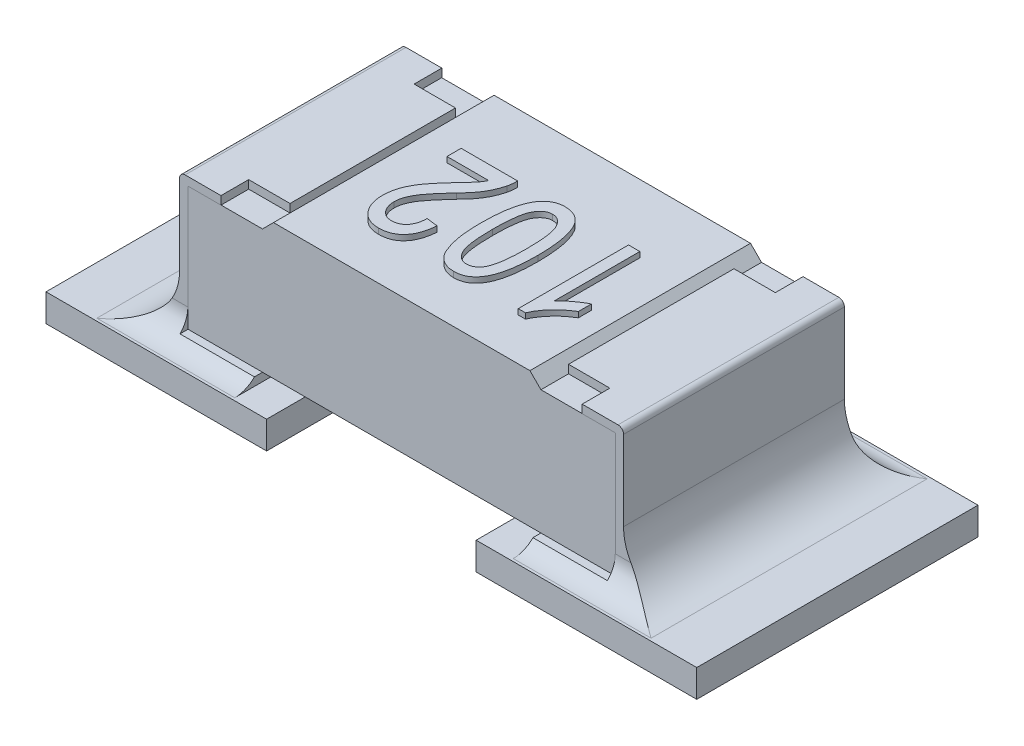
ISO-10303-21;
HEADER;
FILE_DESCRIPTION(('STEP AP214'),'2;1');
FILE_NAME('part.step','',(''),(''),'','','');
FILE_SCHEMA(('AUTOMOTIVE_DESIGN { 1 0 10303 214 1 1 1 1 }'));
ENDSEC;
DATA;
#1=APPLICATION_CONTEXT('core data for automotive mechanical design processes');
#2=APPLICATION_PROTOCOL_DEFINITION('international standard','automotive_design',2000,#1);
#3=PRODUCT_CONTEXT('',#1,'mechanical');
#4=PRODUCT('Part','Part','',(#3));
#5=PRODUCT_RELATED_PRODUCT_CATEGORY('part','',(#4));
#6=PRODUCT_DEFINITION_FORMATION('','',#4);
#7=PRODUCT_DEFINITION_CONTEXT('part definition',#1,'design');
#8=PRODUCT_DEFINITION('design','',#6,#7);
#9=PRODUCT_DEFINITION_SHAPE('','',#8);
#10=(LENGTH_UNIT() NAMED_UNIT(*) SI_UNIT(.MILLI.,.METRE.));
#11=(NAMED_UNIT(*) PLANE_ANGLE_UNIT() SI_UNIT($,.RADIAN.));
#12=(NAMED_UNIT(*) SI_UNIT($,.STERADIAN.) SOLID_ANGLE_UNIT());
#13=UNCERTAINTY_MEASURE_WITH_UNIT(LENGTH_MEASURE(1.E-05),#10,'distance_accuracy_value','');
#14=(GEOMETRIC_REPRESENTATION_CONTEXT(3) GLOBAL_UNCERTAINTY_ASSIGNED_CONTEXT((#13)) GLOBAL_UNIT_ASSIGNED_CONTEXT((#10,
#11,#12)) REPRESENTATION_CONTEXT('',''));
#15=CARTESIAN_POINT('',(0.,0.,0.));
#16=DIRECTION('',(0.,0.,1.));
#17=DIRECTION('',(1.,0.,0.));
#18=AXIS2_PLACEMENT_3D('',#15,#16,#17);
#19=CARTESIAN_POINT('',(-0.465,0.619999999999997,0.4));
#20=DIRECTION('',(0.,-1.,0.));
#21=DIRECTION('',(0.,0.,-1.));
#22=AXIS2_PLACEMENT_3D('',#19,#20,#21);
#23=PLANE('',#22);
#24=CARTESIAN_POINT('',(-0.247272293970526,0.619999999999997,-0.0280239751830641));
#25=CARTESIAN_POINT('',(-0.244549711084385,0.619999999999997,-0.0308835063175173));
#26=CARTESIAN_POINT('',(-0.239338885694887,0.619999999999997,-0.0363564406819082));
#27=CARTESIAN_POINT('',(-0.231845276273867,0.619999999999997,-0.0441720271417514));
#28=CARTESIAN_POINT('',(-0.225257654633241,0.619999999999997,-0.0514136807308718));
#29=CARTESIAN_POINT('',(-0.219283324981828,0.619999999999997,-0.0577852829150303));
#30=CARTESIAN_POINT('',(-0.214172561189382,0.619999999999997,-0.063514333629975));
#31=CARTESIAN_POINT('',(-0.209712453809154,0.619999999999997,-0.0684409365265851));
#32=CARTESIAN_POINT('',(-0.206158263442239,0.619999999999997,-0.0727824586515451));
#33=CARTESIAN_POINT('',(-0.200667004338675,0.619999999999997,-0.0794074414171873));
#34=CARTESIAN_POINT('',(-0.1938610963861,0.619999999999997,-0.0889475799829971));
#35=CARTESIAN_POINT('',(-0.188989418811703,0.619999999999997,-0.0978729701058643));
#36=CARTESIAN_POINT('',(-0.186615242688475,0.619999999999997,-0.102222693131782));
#37=B_SPLINE_CURVE_WITH_KNOTS('',3,(#24,#25,#26,#27,#28,#29,#30,#31,#32,#33,#34,#35,#36),
.UNSPECIFIED.,.F.,.F.,(4,1,1,1,1,1,1,1,1,1,4),(0.,0.12314411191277,0.235688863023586,
0.337675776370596,0.428456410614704,0.508083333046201,0.577123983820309,0.63567919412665,
0.683037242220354,0.845530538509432,1.),.UNSPECIFIED.);
#38=CARTESIAN_POINT('',(-0.247272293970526,0.619999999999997,-0.0280239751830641));
#39=VERTEX_POINT('',#38);
#40=CARTESIAN_POINT('',(-0.186615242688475,0.619999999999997,-0.102222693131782));
#41=VERTEX_POINT('',#40);
#42=EDGE_CURVE('E558',#39,#41,#37,.T.);
#43=ORIENTED_EDGE('',*,*,#42,.T.);
#44=DIRECTION('',(-1.,0.,0.));
#45=VECTOR('',#44,1.);
#46=CARTESIAN_POINT('',(-0.186615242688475,0.619999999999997,-0.102222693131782));
#47=LINE('',#46,#45);
#48=CARTESIAN_POINT('',(-0.338057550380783,0.619999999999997,-0.102222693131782));
#49=VERTEX_POINT('',#48);
#50=EDGE_CURVE('E540',#41,#49,#47,.T.);
#51=ORIENTED_EDGE('',*,*,#50,.T.);
#52=DIRECTION('',(0.,0.,-1.));
#53=VECTOR('',#52,1.);
#54=CARTESIAN_POINT('',(-0.338057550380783,0.619999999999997,-0.102222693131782));
#55=LINE('',#54,#53);
#56=CARTESIAN_POINT('',(-0.338057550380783,0.619999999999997,-0.153504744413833));
#57=VERTEX_POINT('',#56);
#58=EDGE_CURVE('E551',#49,#57,#55,.T.);
#59=ORIENTED_EDGE('',*,*,#58,.T.);
#60=DIRECTION('',(1.,0.,0.));
#61=VECTOR('',#60,1.);
#62=CARTESIAN_POINT('',(-0.338057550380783,0.619999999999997,-0.153504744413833));
#63=LINE('',#62,#61);
#64=CARTESIAN_POINT('',(-0.132929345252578,0.619999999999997,-0.153504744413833));
#65=VERTEX_POINT('',#64);
#66=EDGE_CURVE('E42',#57,#65,#63,.T.);
#67=ORIENTED_EDGE('',*,*,#66,.T.);
#68=CARTESIAN_POINT('',(-0.132929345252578,0.619999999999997,-0.153504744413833));
#69=CARTESIAN_POINT('',(-0.132917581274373,0.619999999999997,-0.150485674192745));
#70=CARTESIAN_POINT('',(-0.132894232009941,0.619999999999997,-0.144493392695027));
#71=CARTESIAN_POINT('',(-0.133535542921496,0.619999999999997,-0.135600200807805));
#72=CARTESIAN_POINT('',(-0.134821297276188,0.619999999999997,-0.126872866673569));
#73=CARTESIAN_POINT('',(-0.136123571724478,0.619999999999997,-0.121178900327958));
#74=CARTESIAN_POINT('',(-0.136775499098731,0.619999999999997,-0.118328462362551));
#75=B_SPLINE_CURVE_WITH_KNOTS('',3,(#68,#69,#70,#71,#72,#73,#74),.UNSPECIFIED.,.F.,.F.,(4,1,1,1,
4),(0.,0.255137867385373,0.506400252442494,0.752900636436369,1.),.UNSPECIFIED.);
#76=CARTESIAN_POINT('',(-0.136775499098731,0.619999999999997,-0.118328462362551));
#77=VERTEX_POINT('',#76);
#78=EDGE_CURVE('E562',#65,#77,#75,.T.);
#79=ORIENTED_EDGE('',*,*,#78,.T.);
#80=CARTESIAN_POINT('',(-0.136775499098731,0.619999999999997,-0.118328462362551));
#81=CARTESIAN_POINT('',(-0.13800865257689,0.619999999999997,-0.113710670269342));
#82=CARTESIAN_POINT('',(-0.140498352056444,0.619999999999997,-0.104387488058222));
#83=CARTESIAN_POINT('',(-0.145639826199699,0.619999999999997,-0.090785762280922));
#84=CARTESIAN_POINT('',(-0.151559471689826,0.619999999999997,-0.077250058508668));
#85=CARTESIAN_POINT('',(-0.157488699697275,0.619999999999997,-0.0662258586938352));
#86=CARTESIAN_POINT('',(-0.162736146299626,0.619999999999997,-0.057241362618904));
#87=CARTESIAN_POINT('',(-0.167462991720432,0.619999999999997,-0.0504023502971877));
#88=CARTESIAN_POINT('',(-0.172539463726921,0.619999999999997,-0.0432145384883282));
#89=CARTESIAN_POINT('',(-0.178370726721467,0.619999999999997,-0.0359777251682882));
#90=CARTESIAN_POINT('',(-0.184614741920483,0.619999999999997,-0.0284168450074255));
#91=CARTESIAN_POINT('',(-0.191411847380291,0.619999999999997,-0.0206273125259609));
#92=CARTESIAN_POINT('',(-0.198893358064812,0.619999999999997,-0.0127401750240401));
#93=CARTESIAN_POINT('',(-0.204076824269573,0.619999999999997,-0.00742474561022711));
#94=CARTESIAN_POINT('',(-0.206727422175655,0.619999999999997,-0.00470666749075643));
#95=B_SPLINE_CURVE_WITH_KNOTS('',3,(#80,#81,#82,#83,#84,#85,#86,#87,#88,#89,#90,#91,#92,#93,
#94),.UNSPECIFIED.,.F.,.F.,(4,1,1,1,1,1,1,1,1,1,1,1,4),(0.,0.105958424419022,0.213926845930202,
0.322146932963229,0.433460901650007,0.491377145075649,0.552833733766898,0.617780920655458,
0.686529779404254,0.75889780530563,0.835309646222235,0.915784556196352,1.),.UNSPECIFIED.);
#96=CARTESIAN_POINT('',(-0.206727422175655,0.619999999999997,-0.00470666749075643));
#97=VERTEX_POINT('',#96);
#98=EDGE_CURVE('E567',#77,#97,#95,.T.);
#99=ORIENTED_EDGE('',*,*,#98,.T.);
#100=CARTESIAN_POINT('',(-0.206727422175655,0.619999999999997,-0.00470666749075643));
#101=CARTESIAN_POINT('',(-0.210832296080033,0.619999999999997,-0.000289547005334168));
#102=CARTESIAN_POINT('',(-0.218736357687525,0.619999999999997,0.00821575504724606));
#103=CARTESIAN_POINT('',(-0.229839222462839,0.619999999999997,0.0207465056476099));
#104=CARTESIAN_POINT('',(-0.240007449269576,0.619999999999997,0.0323590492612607));
#105=CARTESIAN_POINT('',(-0.249036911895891,0.619999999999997,0.0432550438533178));
#106=CARTESIAN_POINT('',(-0.257079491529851,0.619999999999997,0.0533125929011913));
#107=CARTESIAN_POINT('',(-0.263982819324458,0.619999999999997,0.0626266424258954));
#108=CARTESIAN_POINT('',(-0.2698590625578,0.619999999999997,0.0711108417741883));
#109=CARTESIAN_POINT('',(-0.276204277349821,0.619999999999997,0.0811794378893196));
#110=CARTESIAN_POINT('',(-0.282391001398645,0.619999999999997,0.0932305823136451));
#111=CARTESIAN_POINT('',(-0.287886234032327,0.619999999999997,0.107518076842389));
#112=CARTESIAN_POINT('',(-0.291278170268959,0.619999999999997,0.121630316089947));
#113=CARTESIAN_POINT('',(-0.291698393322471,0.619999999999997,0.131013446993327));
#114=CARTESIAN_POINT('',(-0.291903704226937,0.619999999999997,0.135597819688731));
#115=B_SPLINE_CURVE_WITH_KNOTS('',3,(#100,#101,#102,#103,#104,#105,#106,#107,#108,#109,#110,
#111,#112,#113,#114),.UNSPECIFIED.,.F.,.F.,(4,1,1,1,1,1,1,1,1,1,1,1,4),(0.,0.107782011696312,
0.207537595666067,0.299250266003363,0.383669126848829,0.460468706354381,0.529410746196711,
0.590858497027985,0.644907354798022,0.74206184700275,0.832418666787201,0.918123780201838,1.),.UNSPECIFIED.);
#116=CARTESIAN_POINT('',(-0.291903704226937,0.619999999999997,0.135597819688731));
#117=VERTEX_POINT('',#116);
#118=EDGE_CURVE('E575',#97,#117,#115,.T.);
#119=ORIENTED_EDGE('',*,*,#118,.T.);
#120=CARTESIAN_POINT('',(-0.291903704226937,0.619999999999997,0.135597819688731));
#121=CARTESIAN_POINT('',(-0.291734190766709,0.619999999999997,0.139995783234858));
#122=CARTESIAN_POINT('',(-0.291405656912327,0.619999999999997,0.148519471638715));
#123=CARTESIAN_POINT('',(-0.288422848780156,0.619999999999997,0.160751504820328));
#124=CARTESIAN_POINT('',(-0.28359994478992,0.619999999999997,0.171907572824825));
#125=CARTESIAN_POINT('',(-0.277919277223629,0.619999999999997,0.180163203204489));
#126=CARTESIAN_POINT('',(-0.272658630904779,0.619999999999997,0.186012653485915));
#127=CARTESIAN_POINT('',(-0.268333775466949,0.619999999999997,0.189822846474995));
#128=CARTESIAN_POINT('',(-0.263800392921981,0.619999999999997,0.193120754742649));
#129=CARTESIAN_POINT('',(-0.258938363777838,0.619999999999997,0.195811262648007));
#130=CARTESIAN_POINT('',(-0.253751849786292,0.619999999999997,0.197809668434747));
#131=CARTESIAN_POINT('',(-0.248294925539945,0.619999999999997,0.199239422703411));
#132=CARTESIAN_POINT('',(-0.242548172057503,0.619999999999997,0.200152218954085));
#133=CARTESIAN_POINT('',(-0.238621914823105,0.619999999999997,0.200277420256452));
#134=CARTESIAN_POINT('',(-0.236615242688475,0.619999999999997,0.200341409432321));
#135=B_SPLINE_CURVE_WITH_KNOTS('',3,(#120,#121,#122,#123,#124,#125,#126,#127,#128,#129,#130,
#131,#132,#133,#134),.UNSPECIFIED.,.F.,.F.,(4,1,1,1,1,1,1,1,1,1,1,1,4),(0.,0.138524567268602,
0.268474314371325,0.394467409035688,0.519941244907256,0.58255786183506,0.642232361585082,
0.701381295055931,0.759066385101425,0.816947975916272,0.876204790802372,0.936729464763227,1.),.UNSPECIFIED.);
#136=CARTESIAN_POINT('',(-0.236615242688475,0.619999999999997,0.200341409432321));
#137=VERTEX_POINT('',#136);
#138=EDGE_CURVE('E583',#117,#137,#135,.T.);
#139=ORIENTED_EDGE('',*,*,#138,.T.);
#140=CARTESIAN_POINT('',(-0.236615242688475,0.619999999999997,0.200341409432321));
#141=CARTESIAN_POINT('',(-0.234501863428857,0.619999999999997,0.200277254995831));
#142=CARTESIAN_POINT('',(-0.230363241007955,0.619999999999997,0.200151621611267));
#143=CARTESIAN_POINT('',(-0.224324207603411,0.619999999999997,0.199243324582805));
#144=CARTESIAN_POINT('',(-0.218585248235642,0.619999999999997,0.197827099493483));
#145=CARTESIAN_POINT('',(-0.21317233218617,0.619999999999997,0.195728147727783));
#146=CARTESIAN_POINT('',(-0.208107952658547,0.619999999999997,0.192975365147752));
#147=CARTESIAN_POINT('',(-0.203354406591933,0.619999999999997,0.189667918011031));
#148=CARTESIAN_POINT('',(-0.1988961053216,0.619999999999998,0.185793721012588));
#149=CARTESIAN_POINT('',(-0.194856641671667,0.619999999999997,0.181296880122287));
#150=CARTESIAN_POINT('',(-0.191127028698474,0.619999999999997,0.176353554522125));
#151=CARTESIAN_POINT('',(-0.188026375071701,0.619999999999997,0.170818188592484));
#152=CARTESIAN_POINT('',(-0.185291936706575,0.619999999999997,0.164905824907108));
#153=CARTESIAN_POINT('',(-0.183048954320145,0.619999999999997,0.158520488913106));
#154=CARTESIAN_POINT('',(-0.181261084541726,0.619999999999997,0.151692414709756));
#155=CARTESIAN_POINT('',(-0.180131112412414,0.619999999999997,0.144359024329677));
#156=CARTESIAN_POINT('',(-0.179283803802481,0.619999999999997,0.136605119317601));
#157=CARTESIAN_POINT('',(-0.179151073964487,0.619999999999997,0.131273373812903));
#158=CARTESIAN_POINT('',(-0.179083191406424,0.619999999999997,0.128546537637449));
#159=B_SPLINE_CURVE_WITH_KNOTS('',3,(#140,#141,#142,#143,#144,#145,#146,#147,#148,#149,#150,
#151,#152,#153,#154,#155,#156,#157,#158),.UNSPECIFIED.,.F.,.F.,(4,1,1,1,1,1,1,1,1,1,1,1,1,1,1,1,
4),(0.,0.0611925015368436,0.119833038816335,0.176496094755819,0.232092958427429,
0.287474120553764,0.34305483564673,0.399527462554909,0.45812205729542,0.517844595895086,
0.578486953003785,0.641486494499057,0.706325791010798,0.774248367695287,0.845595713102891,
0.921032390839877,1.),.UNSPECIFIED.);
#160=CARTESIAN_POINT('',(-0.179083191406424,0.619999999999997,0.128546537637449));
#161=VERTEX_POINT('',#160);
#162=EDGE_CURVE('E591',#137,#161,#159,.T.);
#163=ORIENTED_EDGE('',*,*,#162,.T.);
#164=DIRECTION('',(0.992277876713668,0.,0.124034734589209));
#165=VECTOR('',#164,1.);
#166=CARTESIAN_POINT('',(-0.179083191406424,0.619999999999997,0.128546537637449));
#167=LINE('',#166,#165);
#168=CARTESIAN_POINT('',(-0.138057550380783,0.619999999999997,0.133674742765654));
#169=VERTEX_POINT('',#168);
#170=EDGE_CURVE('E599',#161,#169,#167,.T.);
#171=ORIENTED_EDGE('',*,*,#170,.T.);
#172=CARTESIAN_POINT('',(-0.138057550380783,0.619999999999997,0.133674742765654));
#173=CARTESIAN_POINT('',(-0.138459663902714,0.619999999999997,0.138141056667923));
#174=CARTESIAN_POINT('',(-0.1392402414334,0.619999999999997,0.146811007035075));
#175=CARTESIAN_POINT('',(-0.141237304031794,0.619999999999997,0.159373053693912));
#176=CARTESIAN_POINT('',(-0.143969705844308,0.619999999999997,0.171092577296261));
#177=CARTESIAN_POINT('',(-0.147301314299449,0.619999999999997,0.182044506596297));
#178=CARTESIAN_POINT('',(-0.151389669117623,0.619999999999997,0.192187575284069));
#179=CARTESIAN_POINT('',(-0.156188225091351,0.619999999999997,0.201499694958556));
#180=CARTESIAN_POINT('',(-0.161667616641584,0.619999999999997,0.2099791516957));
#181=CARTESIAN_POINT('',(-0.167783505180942,0.619999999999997,0.217634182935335));
#182=CARTESIAN_POINT('',(-0.174492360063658,0.619999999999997,0.224469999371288));
#183=CARTESIAN_POINT('',(-0.18185444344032,0.619999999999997,0.230356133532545));
#184=CARTESIAN_POINT('',(-0.189768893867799,0.619999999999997,0.235381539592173));
#185=CARTESIAN_POINT('',(-0.198249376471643,0.619999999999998,0.239442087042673));
#186=CARTESIAN_POINT('',(-0.207277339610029,0.619999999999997,0.242613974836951));
#187=CARTESIAN_POINT('',(-0.216844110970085,0.619999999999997,0.244823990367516));
#188=CARTESIAN_POINT('',(-0.226985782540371,0.619999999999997,0.246219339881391));
#189=CARTESIAN_POINT('',(-0.233939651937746,0.619999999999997,0.246401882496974));
#190=CARTESIAN_POINT('',(-0.237496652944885,0.619999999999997,0.246495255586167));
#191=B_SPLINE_CURVE_WITH_KNOTS('',3,(#172,#173,#174,#175,#176,#177,#178,#179,#180,#181,#182,
#183,#184,#185,#186,#187,#188,#189,#190),.UNSPECIFIED.,.F.,.F.,(4,1,1,1,1,1,1,1,1,1,1,1,1,1,1,1,
4),(0.,0.0798844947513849,0.155070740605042,0.226409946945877,0.294147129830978,
0.358835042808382,0.42098573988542,0.480517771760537,0.538414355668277,0.595284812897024,
0.650803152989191,0.705990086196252,0.761969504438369,0.817959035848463,0.876136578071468,
0.936642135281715,1.),.UNSPECIFIED.);
#192=CARTESIAN_POINT('',(-0.237496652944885,0.619999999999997,0.246495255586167));
#193=VERTEX_POINT('',#192);
#194=EDGE_CURVE('E605',#169,#193,#191,.T.);
#195=ORIENTED_EDGE('',*,*,#194,.T.);
#196=CARTESIAN_POINT('',(-0.237496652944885,0.619999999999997,0.246495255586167));
#197=CARTESIAN_POINT('',(-0.241081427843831,0.619999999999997,0.246413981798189));
#198=CARTESIAN_POINT('',(-0.248098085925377,0.619999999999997,0.246254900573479));
#199=CARTESIAN_POINT('',(-0.2583047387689,0.619999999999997,0.244688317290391));
#200=CARTESIAN_POINT('',(-0.267941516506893,0.619999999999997,0.242187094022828));
#201=CARTESIAN_POINT('',(-0.27704412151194,0.619999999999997,0.238782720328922));
#202=CARTESIAN_POINT('',(-0.285511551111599,0.619999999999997,0.234220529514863));
#203=CARTESIAN_POINT('',(-0.293414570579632,0.619999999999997,0.228766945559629));
#204=CARTESIAN_POINT('',(-0.300696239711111,0.619999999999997,0.222248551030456));
#205=CARTESIAN_POINT('',(-0.307360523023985,0.619999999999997,0.214843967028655));
#206=CARTESIAN_POINT('',(-0.313341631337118,0.619999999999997,0.20669033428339));
#207=CARTESIAN_POINT('',(-0.318556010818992,0.619999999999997,0.19797971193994));
#208=CARTESIAN_POINT('',(-0.323072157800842,0.619999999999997,0.188866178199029));
#209=CARTESIAN_POINT('',(-0.326695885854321,0.619999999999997,0.179225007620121));
#210=CARTESIAN_POINT('',(-0.329491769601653,0.619999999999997,0.16911169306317));
#211=CARTESIAN_POINT('',(-0.331471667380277,0.619999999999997,0.158523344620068));
#212=CARTESIAN_POINT('',(-0.332714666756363,0.619999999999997,0.147459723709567));
#213=CARTESIAN_POINT('',(-0.332856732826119,0.619999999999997,0.139928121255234));
#214=CARTESIAN_POINT('',(-0.332929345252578,0.619999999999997,0.1360785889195));
#215=B_SPLINE_CURVE_WITH_KNOTS('',3,(#196,#197,#198,#199,#200,#201,#202,#203,#204,#205,#206,
#207,#208,#209,#210,#211,#212,#213,#214),.UNSPECIFIED.,.F.,.F.,(4,1,1,1,1,1,1,1,1,1,1,1,1,1,1,1,
4),(0.,0.0656119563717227,0.128425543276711,0.188577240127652,0.247718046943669,
0.305927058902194,0.364273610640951,0.423175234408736,0.484475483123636,0.546404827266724,
0.608063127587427,0.670191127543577,0.732423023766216,0.796389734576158,0.862105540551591,
0.929519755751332,1.),.UNSPECIFIED.);
#216=CARTESIAN_POINT('',(-0.332929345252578,0.619999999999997,0.1360785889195));
#217=VERTEX_POINT('',#216);
#218=EDGE_CURVE('E610',#193,#217,#215,.T.);
#219=ORIENTED_EDGE('',*,*,#218,.T.);
#220=CARTESIAN_POINT('',(-0.332929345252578,0.619999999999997,0.1360785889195));
#221=CARTESIAN_POINT('',(-0.332867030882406,0.619999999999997,0.132121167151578));
#222=CARTESIAN_POINT('',(-0.332742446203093,0.619999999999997,0.124209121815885));
#223=CARTESIAN_POINT('',(-0.331272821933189,0.619999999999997,0.112408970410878));
#224=CARTESIAN_POINT('',(-0.329144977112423,0.619999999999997,0.100673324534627));
#225=CARTESIAN_POINT('',(-0.326082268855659,0.619999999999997,0.0889874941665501));
#226=CARTESIAN_POINT('',(-0.321990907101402,0.619999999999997,0.0772127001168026));
#227=CARTESIAN_POINT('',(-0.316887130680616,0.619999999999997,0.0651849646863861));
#228=CARTESIAN_POINT('',(-0.310432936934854,0.619999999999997,0.0529197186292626));
#229=CARTESIAN_POINT('',(-0.304342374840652,0.619999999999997,0.0423895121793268));
#230=CARTESIAN_POINT('',(-0.298491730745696,0.619999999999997,0.0336802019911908));
#231=CARTESIAN_POINT('',(-0.293492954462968,0.619999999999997,0.0263957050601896));
#232=CARTESIAN_POINT('',(-0.287453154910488,0.619999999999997,0.0187892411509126));
#233=CARTESIAN_POINT('',(-0.280973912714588,0.619999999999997,0.0103924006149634));
#234=CARTESIAN_POINT('',(-0.273498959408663,0.619999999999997,0.00165147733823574));
#235=CARTESIAN_POINT('',(-0.265568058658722,0.619999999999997,-0.00789055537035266));
#236=CARTESIAN_POINT('',(-0.256616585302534,0.619999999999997,-0.0177353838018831));
#237=CARTESIAN_POINT('',(-0.25045024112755,0.619999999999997,-0.0245248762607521));
#238=CARTESIAN_POINT('',(-0.247272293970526,0.619999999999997,-0.0280239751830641));
#239=B_SPLINE_CURVE_WITH_KNOTS('',3,(#220,#221,#222,#223,#224,#225,#226,#227,#228,#229,#230,
#231,#232,#233,#234,#235,#236,#237,#238),.UNSPECIFIED.,.F.,.F.,(4,1,1,1,1,1,1,1,1,1,1,1,1,1,1,1,
4),(0.,0.062456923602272,0.124869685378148,0.187491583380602,0.250712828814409,
0.315402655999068,0.38418537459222,0.456809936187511,0.534135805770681,0.576130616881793,
0.622465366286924,0.673587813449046,0.729445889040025,0.78992772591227,0.855163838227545,
0.925355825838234,1.),.UNSPECIFIED.);
#240=EDGE_CURVE('E618',#217,#39,#239,.T.);
#241=ORIENTED_EDGE('',*,*,#240,.T.);
#242=EDGE_LOOP('',(#43,#51,#59,#67,#79,#99,#119,#139,#163,#171,#195,#219,#241));
#243=FACE_BOUND('',#242,.T.);
#244=CARTESIAN_POINT('',(0.0347629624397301,0.619999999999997,-0.158632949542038));
#245=CARTESIAN_POINT('',(0.0384549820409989,0.619999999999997,-0.158499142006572));
#246=CARTESIAN_POINT('',(0.0456948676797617,0.619999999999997,-0.15823675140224));
#247=CARTESIAN_POINT('',(0.0562689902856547,0.619999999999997,-0.156490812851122));
#248=CARTESIAN_POINT('',(0.06618062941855,0.619999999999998,-0.153395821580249));
#249=CARTESIAN_POINT('',(0.075535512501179,0.619999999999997,-0.149215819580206));
#250=CARTESIAN_POINT('',(0.0842293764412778,0.619999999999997,-0.143715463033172));
#251=CARTESIAN_POINT('',(0.0922591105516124,0.619999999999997,-0.136993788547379));
#252=CARTESIAN_POINT('',(0.0997629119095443,0.619999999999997,-0.129152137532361));
#253=CARTESIAN_POINT('',(0.104039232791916,0.619999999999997,-0.12316748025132));
#254=CARTESIAN_POINT('',(0.106237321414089,0.619999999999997,-0.120091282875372));
#255=B_SPLINE_CURVE_WITH_KNOTS('',3,(#244,#245,#246,#247,#248,#249,#250,#251,#252,#253,#254),
.UNSPECIFIED.,.F.,.F.,(4,1,1,1,1,1,1,1,4),(0.,0.130569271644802,0.256040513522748,
0.377640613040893,0.496854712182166,0.617404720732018,0.740158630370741,0.866437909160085,1.),.UNSPECIFIED.);
#256=CARTESIAN_POINT('',(0.0347629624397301,0.619999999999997,-0.158632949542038));
#257=VERTEX_POINT('',#256);
#258=CARTESIAN_POINT('',(0.106237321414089,0.619999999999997,-0.120091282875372));
#259=VERTEX_POINT('',#258);
#260=EDGE_CURVE('E731',#257,#259,#255,.T.);
#261=ORIENTED_EDGE('',*,*,#260,.T.);
#262=CARTESIAN_POINT('',(0.106237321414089,0.619999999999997,-0.120091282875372));
#263=CARTESIAN_POINT('',(0.108768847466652,0.619999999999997,-0.115492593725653));
#264=CARTESIAN_POINT('',(0.11404873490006,0.619999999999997,-0.105901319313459));
#265=CARTESIAN_POINT('',(0.120233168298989,0.619999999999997,-0.0899379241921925));
#266=CARTESIAN_POINT('',(0.125490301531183,0.619999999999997,-0.0721821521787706));
#267=CARTESIAN_POINT('',(0.129905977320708,0.619999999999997,-0.0525939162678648));
#268=CARTESIAN_POINT('',(0.133147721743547,0.619999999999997,-0.0311091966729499));
#269=CARTESIAN_POINT('',(0.13566325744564,0.619999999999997,-0.00780190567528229));
#270=CARTESIAN_POINT('',(0.137065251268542,0.619999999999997,0.0173647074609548));
#271=CARTESIAN_POINT('',(0.137237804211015,0.619999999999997,0.0347681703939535));
#272=CARTESIAN_POINT('',(0.137327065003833,0.619999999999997,0.0437708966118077));
#273=B_SPLINE_CURVE_WITH_KNOTS('',3,(#262,#263,#264,#265,#266,#267,#268,#269,#270,#271,#272),
.UNSPECIFIED.,.F.,.F.,(4,1,1,1,1,1,1,1,4),(0.,0.0933338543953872,0.194662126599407,
0.303837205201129,0.422725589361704,0.551666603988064,0.690295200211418,0.839791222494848,1.),.UNSPECIFIED.);
#274=CARTESIAN_POINT('',(0.137327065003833,0.619999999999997,0.0437708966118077));
#275=VERTEX_POINT('',#274);
#276=EDGE_CURVE('E704',#259,#275,#273,.T.);
#277=ORIENTED_EDGE('',*,*,#276,.T.);
#278=CARTESIAN_POINT('',(0.137327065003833,0.619999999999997,0.0437708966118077));
#279=CARTESIAN_POINT('',(0.137305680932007,0.619999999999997,0.0494873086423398));
#280=CARTESIAN_POINT('',(0.137263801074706,0.619999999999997,0.0606826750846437));
#281=CARTESIAN_POINT('',(0.136662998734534,0.619999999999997,0.0770582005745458));
#282=CARTESIAN_POINT('',(0.135834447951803,0.619999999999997,0.0926129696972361));
#283=CARTESIAN_POINT('',(0.134523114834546,0.619999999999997,0.107331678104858));
#284=CARTESIAN_POINT('',(0.132945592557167,0.619999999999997,0.121228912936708));
#285=CARTESIAN_POINT('',(0.131043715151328,0.619999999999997,0.134332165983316));
#286=CARTESIAN_POINT('',(0.12874079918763,0.619999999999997,0.146609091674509));
#287=CARTESIAN_POINT('',(0.125985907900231,0.619999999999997,0.158091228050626));
#288=CARTESIAN_POINT('',(0.122994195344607,0.619999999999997,0.168866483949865));
#289=CARTESIAN_POINT('',(0.119497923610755,0.619999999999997,0.178860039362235));
#290=CARTESIAN_POINT('',(0.115872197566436,0.619999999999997,0.18825641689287));
#291=CARTESIAN_POINT('',(0.111694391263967,0.619999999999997,0.196839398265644));
#292=CARTESIAN_POINT('',(0.107254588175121,0.619999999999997,0.204803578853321));
#293=CARTESIAN_POINT('',(0.102508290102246,0.619999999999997,0.212073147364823));
#294=CARTESIAN_POINT('',(0.0973170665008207,0.619999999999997,0.218602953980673));
#295=CARTESIAN_POINT('',(0.0918866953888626,0.619999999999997,0.224512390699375));
#296=CARTESIAN_POINT('',(0.0859842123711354,0.619999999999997,0.229670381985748));
#297=CARTESIAN_POINT('',(0.0797166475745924,0.619999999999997,0.234149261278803));
#298=CARTESIAN_POINT('',(0.0731611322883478,0.619999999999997,0.238051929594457));
#299=CARTESIAN_POINT('',(0.0661688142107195,0.619999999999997,0.241092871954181));
#300=CARTESIAN_POINT('',(0.0588455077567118,0.619999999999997,0.243506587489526));
#301=CARTESIAN_POINT('',(0.0511503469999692,0.619999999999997,0.245265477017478));
#302=CARTESIAN_POINT('',(0.0430733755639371,0.619999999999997,0.246339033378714));
#303=CARTESIAN_POINT('',(0.0375708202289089,0.619999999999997,0.246442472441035));
#304=CARTESIAN_POINT('',(0.0347629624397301,0.619999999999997,0.246495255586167));
#305=B_SPLINE_CURVE_WITH_KNOTS('',3,(#278,#279,#280,#281,#282,#283,#284,#285,#286,#287,#288,
#289,#290,#291,#292,#293,#294,#295,#296,#297,#298,#299,#300,#301,#302,#303,#304),.UNSPECIFIED.,
.F.,.F.,(4,1,1,1,1,1,1,1,1,1,1,1,1,1,1,1,1,1,1,1,1,1,1,1,4),(0.,0.0676683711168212,
0.132525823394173,0.193965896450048,0.252050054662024,0.307429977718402,0.359525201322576,
0.408764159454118,0.455240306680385,0.499280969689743,0.541078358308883,0.580535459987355,
0.618436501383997,0.653969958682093,0.688435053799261,0.721076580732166,0.75262154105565,
0.783318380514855,0.813679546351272,0.843722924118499,0.87345184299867,0.903748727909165,
0.934890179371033,0.966775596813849,1.),.UNSPECIFIED.);
#306=CARTESIAN_POINT('',(0.0347629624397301,0.619999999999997,0.246495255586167));
#307=VERTEX_POINT('',#306);
#308=EDGE_CURVE('E709',#275,#307,#305,.T.);
#309=ORIENTED_EDGE('',*,*,#308,.T.);
#310=CARTESIAN_POINT('',(0.0347629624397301,0.619999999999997,0.246495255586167));
#311=CARTESIAN_POINT('',(0.030638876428,0.619999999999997,0.246342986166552));
#312=CARTESIAN_POINT('',(0.0225054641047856,0.619999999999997,0.246042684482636));
#313=CARTESIAN_POINT('',(0.0106280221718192,0.619999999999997,0.243609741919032));
#314=CARTESIAN_POINT('',(-0.000550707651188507,0.619999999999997,0.239419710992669));
#315=CARTESIAN_POINT('',(-0.0110930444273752,0.619999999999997,0.233841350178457));
#316=CARTESIAN_POINT('',(-0.0207199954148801,0.619999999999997,0.226669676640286));
#317=CARTESIAN_POINT('',(-0.0293599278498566,0.619999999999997,0.218094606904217));
#318=CARTESIAN_POINT('',(-0.036644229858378,0.619999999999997,0.20793914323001));
#319=CARTESIAN_POINT('',(-0.0428209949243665,0.619999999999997,0.19641878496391));
#320=CARTESIAN_POINT('',(-0.0480250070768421,0.619999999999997,0.183534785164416));
#321=CARTESIAN_POINT('',(-0.0528151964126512,0.619999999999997,0.169429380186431));
#322=CARTESIAN_POINT('',(-0.0571487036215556,0.619999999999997,0.154002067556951));
#323=CARTESIAN_POINT('',(-0.06020904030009,0.619999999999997,0.140213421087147));
#324=CARTESIAN_POINT('',(-0.0624631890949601,0.619999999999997,0.128311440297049));
#325=CARTESIAN_POINT('',(-0.0638804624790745,0.619999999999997,0.118471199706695));
#326=CARTESIAN_POINT('',(-0.0650491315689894,0.619999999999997,0.107857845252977));
#327=CARTESIAN_POINT('',(-0.0661368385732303,0.619999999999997,0.0965107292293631));
#328=CARTESIAN_POINT('',(-0.0667927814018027,0.619999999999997,0.0843998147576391));
#329=CARTESIAN_POINT('',(-0.0673542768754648,0.619999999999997,0.0715523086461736));
#330=CARTESIAN_POINT('',(-0.0678025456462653,0.619999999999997,0.0579299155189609));
#331=CARTESIAN_POINT('',(-0.0678016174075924,0.619999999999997,0.0485789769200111));
#332=CARTESIAN_POINT('',(-0.0678011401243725,0.619999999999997,0.0437708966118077));
#333=B_SPLINE_CURVE_WITH_KNOTS('',3,(#310,#311,#312,#313,#314,#315,#316,#317,#318,#319,#320,
#321,#322,#323,#324,#325,#326,#327,#328,#329,#330,#331,#332),.UNSPECIFIED.,.F.,.F.,(4,1,1,1,1,1,
1,1,1,1,1,1,1,1,1,1,1,1,1,1,4),(0.,0.0487840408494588,0.0962105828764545,0.14271799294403,
0.189670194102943,0.236898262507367,0.284285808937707,0.33316193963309,0.384224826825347,
0.438645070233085,0.497425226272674,0.56047387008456,0.628191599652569,0.664524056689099,
0.703820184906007,0.745815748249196,0.79089161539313,0.838709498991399,0.889336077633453,
0.943098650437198,1.),.UNSPECIFIED.);
#334=CARTESIAN_POINT('',(-0.0678011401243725,0.619999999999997,0.0437708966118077));
#335=VERTEX_POINT('',#334);
#336=EDGE_CURVE('E50',#307,#335,#333,.T.);
#337=ORIENTED_EDGE('',*,*,#336,.T.);
#338=CARTESIAN_POINT('',(-0.0678011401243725,0.619999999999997,0.0437708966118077));
#339=CARTESIAN_POINT('',(-0.0677791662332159,0.619999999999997,0.0380812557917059));
#340=CARTESIAN_POINT('',(-0.067736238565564,0.619999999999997,0.0269661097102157));
#341=CARTESIAN_POINT('',(-0.0671470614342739,0.619999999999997,0.01072310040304));
#342=CARTESIAN_POINT('',(-0.0662721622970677,0.619999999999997,-0.00471888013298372));
#343=CARTESIAN_POINT('',(-0.0651031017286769,0.619999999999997,-0.0193667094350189));
#344=CARTESIAN_POINT('',(-0.0635134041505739,0.619999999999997,-0.0332395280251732));
#345=CARTESIAN_POINT('',(-0.0615041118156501,0.619999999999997,-0.0463043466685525));
#346=CARTESIAN_POINT('',(-0.0591875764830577,0.619999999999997,-0.0585730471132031));
#347=CARTESIAN_POINT('',(-0.0565850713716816,0.619999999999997,-0.0700604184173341));
#348=CARTESIAN_POINT('',(-0.0535034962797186,0.619999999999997,-0.0807675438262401));
#349=CARTESIAN_POINT('',(-0.0501428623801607,0.619999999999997,-0.0907962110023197));
#350=CARTESIAN_POINT('',(-0.0465157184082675,0.619999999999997,-0.100171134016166));
#351=CARTESIAN_POINT('',(-0.0424014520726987,0.619999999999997,-0.108814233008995));
#352=CARTESIAN_POINT('',(-0.0378877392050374,0.619999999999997,-0.116721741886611));
#353=CARTESIAN_POINT('',(-0.0332042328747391,0.619999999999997,-0.124077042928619));
#354=CARTESIAN_POINT('',(-0.0280610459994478,0.619999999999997,-0.130684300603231));
#355=CARTESIAN_POINT('',(-0.0224937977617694,0.619999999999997,-0.136543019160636));
#356=CARTESIAN_POINT('',(-0.0166535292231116,0.619999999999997,-0.141782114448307));
#357=CARTESIAN_POINT('',(-0.0104437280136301,0.619999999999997,-0.146326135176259));
#358=CARTESIAN_POINT('',(-0.0038116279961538,0.619999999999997,-0.150092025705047));
#359=CARTESIAN_POINT('',(0.00317446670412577,0.619999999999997,-0.153257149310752));
#360=CARTESIAN_POINT('',(0.010581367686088,0.619999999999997,-0.155622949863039));
#361=CARTESIAN_POINT('',(0.0183193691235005,0.619999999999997,-0.157415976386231));
#362=CARTESIAN_POINT('',(0.0264270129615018,0.619999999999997,-0.158470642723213));
#363=CARTESIAN_POINT('',(0.03195542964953,0.619999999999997,-0.158578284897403));
#364=CARTESIAN_POINT('',(0.0347629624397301,0.619999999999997,-0.158632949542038));
#365=B_SPLINE_CURVE_WITH_KNOTS('',3,(#338,#339,#340,#341,#342,#343,#344,#345,#346,#347,#348,
#349,#350,#351,#352,#353,#354,#355,#356,#357,#358,#359,#360,#361,#362,#363,#364),.UNSPECIFIED.,
.F.,.F.,(4,1,1,1,1,1,1,1,1,1,1,1,1,1,1,1,1,1,1,1,1,1,1,1,4),(0.,0.0674149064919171,
0.131700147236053,0.192565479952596,0.250677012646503,0.305794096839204,0.357984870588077,
0.407269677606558,0.453716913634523,0.497494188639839,0.539228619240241,0.579016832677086,
0.616531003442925,0.652528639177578,0.686852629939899,0.719773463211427,0.751564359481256,
0.782499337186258,0.81263224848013,0.842544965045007,0.87271939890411,0.903345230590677,
0.934515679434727,0.966744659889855,1.),.UNSPECIFIED.);
#366=EDGE_CURVE('E723',#335,#257,#365,.T.);
#367=ORIENTED_EDGE('',*,*,#366,.T.);
#368=EDGE_LOOP('',(#261,#277,#309,#337,#367));
#369=FACE_BOUND('',#368,.T.);
#370=DIRECTION('',(-1.,0.,0.));
#371=VECTOR('',#370,1.);
#372=CARTESIAN_POINT('',(-0.465,0.619999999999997,-0.4));
#373=LINE('',#372,#371);
#374=CARTESIAN_POINT('',(0.465,0.619999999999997,-0.4));
#375=VERTEX_POINT('',#374);
#376=CARTESIAN_POINT('',(-0.465,0.619999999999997,-0.4));
#377=VERTEX_POINT('',#376);
#378=EDGE_CURVE('E875',#375,#377,#373,.T.);
#379=ORIENTED_EDGE('',*,*,#378,.T.);
#380=DIRECTION('',(0.,0.,-1.));
#381=VECTOR('',#380,1.);
#382=CARTESIAN_POINT('',(-0.465,0.619999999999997,0.4));
#383=LINE('',#382,#381);
#384=CARTESIAN_POINT('',(-0.465,0.619999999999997,0.4));
#385=VERTEX_POINT('',#384);
#386=EDGE_CURVE('E890',#385,#377,#383,.T.);
#387=ORIENTED_EDGE('',*,*,#386,.F.);
#388=DIRECTION('',(-1.,0.,0.));
#389=VECTOR('',#388,1.);
#390=CARTESIAN_POINT('',(-0.465,0.619999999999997,0.4));
#391=LINE('',#390,#389);
#392=CARTESIAN_POINT('',(0.465,0.619999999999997,0.4));
#393=VERTEX_POINT('',#392);
#394=EDGE_CURVE('E882',#393,#385,#391,.T.);
#395=ORIENTED_EDGE('',*,*,#394,.F.);
#396=DIRECTION('',(0.,0.,-1.));
#397=VECTOR('',#396,1.);
#398=CARTESIAN_POINT('',(0.465,0.619999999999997,0.4));
#399=LINE('',#398,#397);
#400=EDGE_CURVE('E893',#393,#375,#399,.T.);
#401=ORIENTED_EDGE('',*,*,#400,.T.);
#402=EDGE_LOOP('',(#379,#387,#395,#401));
#403=FACE_BOUND('',#402,.T.);
#404=DIRECTION('',(-1.,0.,0.));
#405=VECTOR('',#404,1.);
#406=CARTESIAN_POINT('',(0.295564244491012,0.619999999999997,0.246495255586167));
#407=LINE('',#406,#405);
#408=CARTESIAN_POINT('',(0.295564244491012,0.619999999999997,0.246495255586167));
#409=VERTEX_POINT('',#408);
#410=CARTESIAN_POINT('',(0.269121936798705,0.619999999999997,0.246495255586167));
#411=VERTEX_POINT('',#410);
#412=EDGE_CURVE('E1242',#409,#411,#407,.T.);
#413=ORIENTED_EDGE('',*,*,#412,.T.);
#414=DIRECTION('',(0.,0.,-1.));
#415=VECTOR('',#414,1.);
#416=CARTESIAN_POINT('',(0.269121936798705,0.619999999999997,0.246495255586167));
#417=LINE('',#416,#415);
#418=CARTESIAN_POINT('',(0.269121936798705,0.619999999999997,-0.153504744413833));
#419=VERTEX_POINT('',#418);
#420=EDGE_CURVE('E1270',#411,#419,#417,.T.);
#421=ORIENTED_EDGE('',*,*,#420,.T.);
#422=DIRECTION('',(1.,0.,0.));
#423=VECTOR('',#422,1.);
#424=CARTESIAN_POINT('',(0.269121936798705,0.619999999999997,-0.153504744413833));
#425=LINE('',#424,#423);
#426=CARTESIAN_POINT('',(0.310147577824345,0.619999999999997,-0.153504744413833));
#427=VERTEX_POINT('',#426);
#428=EDGE_CURVE('E1267',#419,#427,#425,.T.);
#429=ORIENTED_EDGE('',*,*,#428,.T.);
#430=DIRECTION('',(0.,0.,1.));
#431=VECTOR('',#430,1.);
#432=CARTESIAN_POINT('',(0.310147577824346,0.619999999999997,-0.153504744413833));
#433=LINE('',#432,#431);
#434=CARTESIAN_POINT('',(0.310147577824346,0.619999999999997,0.158193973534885));
#435=VERTEX_POINT('',#434);
#436=EDGE_CURVE('E1261',#427,#435,#433,.T.);
#437=ORIENTED_EDGE('',*,*,#436,.T.);
#438=CARTESIAN_POINT('',(0.310147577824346,0.619999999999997,0.158193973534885));
#439=CARTESIAN_POINT('',(0.312590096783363,0.619999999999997,0.155350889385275));
#440=CARTESIAN_POINT('',(0.317643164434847,0.619999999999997,0.149469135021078));
#441=CARTESIAN_POINT('',(0.326324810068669,0.619999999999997,0.141097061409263));
#442=CARTESIAN_POINT('',(0.335977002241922,0.619999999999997,0.132612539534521));
#443=CARTESIAN_POINT('',(0.346511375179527,0.619999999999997,0.124411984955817));
#444=CARTESIAN_POINT('',(0.357268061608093,0.619999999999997,0.116741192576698));
#445=CARTESIAN_POINT('',(0.367626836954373,0.619999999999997,0.109839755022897));
#446=CARTESIAN_POINT('',(0.377434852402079,0.619999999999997,0.103961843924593));
#447=CARTESIAN_POINT('',(0.383950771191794,0.619999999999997,0.100755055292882));
#448=CARTESIAN_POINT('',(0.387070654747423,0.619999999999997,0.0992196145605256));
#449=B_SPLINE_CURVE_WITH_KNOTS('',3,(#438,#439,#440,#441,#442,#443,#444,#445,#446,#447,#448),
.UNSPECIFIED.,.F.,.F.,(4,1,1,1,1,1,1,1,4),(0.,0.115216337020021,0.238358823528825,
0.370495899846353,0.510333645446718,0.648696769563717,0.776733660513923,0.893097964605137,1.),.UNSPECIFIED.);
#450=CARTESIAN_POINT('',(0.387070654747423,0.619999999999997,0.0992196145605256));
#451=VERTEX_POINT('',#450);
#452=EDGE_CURVE('E1256',#435,#451,#449,.T.);
#453=ORIENTED_EDGE('',*,*,#452,.T.);
#454=DIRECTION('',(0.,0.,1.));
#455=VECTOR('',#454,1.);
#456=CARTESIAN_POINT('',(0.387070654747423,0.619999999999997,0.0992196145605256));
#457=LINE('',#456,#455);
#458=CARTESIAN_POINT('',(0.387070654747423,0.619999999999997,0.146495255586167));
#459=VERTEX_POINT('',#458);
#460=EDGE_CURVE('E1250',#451,#459,#457,.T.);
#461=ORIENTED_EDGE('',*,*,#460,.T.);
#462=CARTESIAN_POINT('',(0.387070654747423,0.619999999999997,0.146495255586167));
#463=CARTESIAN_POINT('',(0.381753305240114,0.619999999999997,0.149805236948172));
#464=CARTESIAN_POINT('',(0.371204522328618,0.619999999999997,0.156371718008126));
#465=CARTESIAN_POINT('',(0.356428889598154,0.619999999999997,0.1676277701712));
#466=CARTESIAN_POINT('',(0.342587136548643,0.619999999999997,0.179766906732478));
#467=CARTESIAN_POINT('',(0.33008897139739,0.619999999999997,0.192930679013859));
#468=CARTESIAN_POINT('',(0.318873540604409,0.619999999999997,0.206381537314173));
#469=CARTESIAN_POINT('',(0.309297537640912,0.619999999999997,0.219831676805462));
#470=CARTESIAN_POINT('',(0.301459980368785,0.619999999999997,0.233088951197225));
#471=CARTESIAN_POINT('',(0.297485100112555,0.619999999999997,0.242127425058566));
#472=CARTESIAN_POINT('',(0.295564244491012,0.619999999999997,0.246495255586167));
#473=B_SPLINE_CURVE_WITH_KNOTS('',3,(#462,#463,#464,#465,#466,#467,#468,#469,#470,#471,#472),
.UNSPECIFIED.,.F.,.F.,(4,1,1,1,1,1,1,1,4),(0.,0.136341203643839,0.270479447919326,
0.403999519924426,0.536885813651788,0.665360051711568,0.78511591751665,0.896157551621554,1.),.UNSPECIFIED.);
#474=EDGE_CURVE('E1245',#459,#409,#473,.T.);
#475=ORIENTED_EDGE('',*,*,#474,.T.);
#476=EDGE_LOOP('',(#413,#421,#429,#437,#453,#461,#475));
#477=FACE_BOUND('',#476,.T.);
#478=ADVANCED_FACE('F27',(#243,#369,#403,#477),#23,.F.);
#479=CARTESIAN_POINT('',(0.775,0.579999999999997,0.4));
#480=DIRECTION('',(0.,-1.,0.));
#481=DIRECTION('',(0.,0.,-1.));
#482=AXIS2_PLACEMENT_3D('',#479,#480,#481);
#483=PLANE('',#482);
#484=DIRECTION('',(0.,0.,-1.));
#485=VECTOR('',#484,1.);
#486=CARTESIAN_POINT('',(0.505,0.579999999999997,0.4));
#487=LINE('',#486,#485);
#488=CARTESIAN_POINT('',(0.505,0.579999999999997,0.4));
#489=VERTEX_POINT('',#488);
#490=CARTESIAN_POINT('',(0.505,0.579999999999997,0.3));
#491=VERTEX_POINT('',#490);
#492=EDGE_CURVE('E897',#489,#491,#487,.T.);
#493=ORIENTED_EDGE('',*,*,#492,.F.);
#494=DIRECTION('',(-1.,0.,0.));
#495=VECTOR('',#494,1.);
#496=CARTESIAN_POINT('',(0.775,0.579999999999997,0.4));
#497=LINE('',#496,#495);
#498=CARTESIAN_POINT('',(0.655,0.579999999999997,0.4));
#499=VERTEX_POINT('',#498);
#500=EDGE_CURVE('E1092',#499,#489,#497,.T.);
#501=ORIENTED_EDGE('',*,*,#500,.F.);
#502=DIRECTION('',(0.,0.,-1.));
#503=VECTOR('',#502,1.);
#504=CARTESIAN_POINT('',(0.655,0.579999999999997,0.5));
#505=LINE('',#504,#503);
#506=CARTESIAN_POINT('',(0.655,0.579999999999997,0.3));
#507=VERTEX_POINT('',#506);
#508=EDGE_CURVE('E920',#499,#507,#505,.T.);
#509=ORIENTED_EDGE('',*,*,#508,.T.);
#510=DIRECTION('',(-1.,0.,0.));
#511=VECTOR('',#510,1.);
#512=CARTESIAN_POINT('',(0.505,0.579999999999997,0.3));
#513=LINE('',#512,#511);
#514=EDGE_CURVE('E923',#507,#491,#513,.T.);
#515=ORIENTED_EDGE('',*,*,#514,.T.);
#516=EDGE_LOOP('',(#493,#501,#509,#515));
#517=FACE_BOUND('',#516,.T.);
#518=ADVANCED_FACE('F1331',(#517),#483,.F.);
#519=CARTESIAN_POINT('',(0.505,0.579999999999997,-0.3));
#520=VERTEX_POINT('',#519);
#521=CARTESIAN_POINT('',(0.505,0.579999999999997,-0.4));
#522=VERTEX_POINT('',#521);
#523=EDGE_CURVE('E896',#520,#522,#487,.T.);
#524=ORIENTED_EDGE('',*,*,#523,.F.);
#525=DIRECTION('',(1.,0.,0.));
#526=VECTOR('',#525,1.);
#527=CARTESIAN_POINT('',(0.505,0.579999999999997,-0.3));
#528=LINE('',#527,#526);
#529=CARTESIAN_POINT('',(0.655,0.579999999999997,-0.3));
#530=VERTEX_POINT('',#529);
#531=EDGE_CURVE('E937',#520,#530,#528,.T.);
#532=ORIENTED_EDGE('',*,*,#531,.T.);
#533=DIRECTION('',(0.,0.,-1.));
#534=VECTOR('',#533,1.);
#535=CARTESIAN_POINT('',(0.655,0.579999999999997,-0.5));
#536=LINE('',#535,#534);
#537=CARTESIAN_POINT('',(0.655,0.579999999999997,-0.4));
#538=VERTEX_POINT('',#537);
#539=EDGE_CURVE('E941',#530,#538,#536,.T.);
#540=ORIENTED_EDGE('',*,*,#539,.T.);
#541=DIRECTION('',(-1.,0.,0.));
#542=VECTOR('',#541,1.);
#543=CARTESIAN_POINT('',(0.775,0.579999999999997,-0.4));
#544=LINE('',#543,#542);
#545=EDGE_CURVE('E1066',#538,#522,#544,.T.);
#546=ORIENTED_EDGE('',*,*,#545,.T.);
#547=EDGE_LOOP('',(#524,#532,#540,#546));
#548=FACE_BOUND('',#547,.T.);
#549=ADVANCED_FACE('F1996',(#548),#483,.F.);
#550=DIRECTION('',(0.,0.,-1.));
#551=VECTOR('',#550,1.);
#552=CARTESIAN_POINT('',(-0.505,0.579999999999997,0.4));
#553=LINE('',#552,#551);
#554=CARTESIAN_POINT('',(-0.505,0.579999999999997,-0.3));
#555=VERTEX_POINT('',#554);
#556=CARTESIAN_POINT('',(-0.505,0.579999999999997,-0.4));
#557=VERTEX_POINT('',#556);
#558=EDGE_CURVE('E887',#555,#557,#553,.T.);
#559=ORIENTED_EDGE('',*,*,#558,.T.);
#560=CARTESIAN_POINT('',(-0.655,0.579999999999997,-0.4));
#561=VERTEX_POINT('',#560);
#562=EDGE_CURVE('E1069',#557,#561,#544,.T.);
#563=ORIENTED_EDGE('',*,*,#562,.T.);
#564=DIRECTION('',(0.,0.,1.));
#565=VECTOR('',#564,1.);
#566=CARTESIAN_POINT('',(-0.655,0.579999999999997,-0.5));
#567=LINE('',#566,#565);
#568=CARTESIAN_POINT('',(-0.655,0.579999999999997,-0.3));
#569=VERTEX_POINT('',#568);
#570=EDGE_CURVE('E954',#561,#569,#567,.T.);
#571=ORIENTED_EDGE('',*,*,#570,.T.);
#572=DIRECTION('',(1.,0.,0.));
#573=VECTOR('',#572,1.);
#574=CARTESIAN_POINT('',(-0.505,0.579999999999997,-0.3));
#575=LINE('',#574,#573);
#576=EDGE_CURVE('E957',#569,#555,#575,.T.);
#577=ORIENTED_EDGE('',*,*,#576,.T.);
#578=EDGE_LOOP('',(#559,#563,#571,#577));
#579=FACE_BOUND('',#578,.T.);
#580=ADVANCED_FACE('F2008',(#579),#483,.F.);
#581=CARTESIAN_POINT('',(-0.505,0.579999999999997,0.4));
#582=VERTEX_POINT('',#581);
#583=CARTESIAN_POINT('',(-0.505,0.579999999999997,0.3));
#584=VERTEX_POINT('',#583);
#585=EDGE_CURVE('E888',#582,#584,#553,.T.);
#586=ORIENTED_EDGE('',*,*,#585,.T.);
#587=DIRECTION('',(-1.,0.,0.));
#588=VECTOR('',#587,1.);
#589=CARTESIAN_POINT('',(-0.505,0.579999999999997,0.3));
#590=LINE('',#589,#588);
#591=CARTESIAN_POINT('',(-0.655,0.579999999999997,0.3));
#592=VERTEX_POINT('',#591);
#593=EDGE_CURVE('E905',#584,#592,#590,.T.);
#594=ORIENTED_EDGE('',*,*,#593,.T.);
#595=DIRECTION('',(0.,0.,1.));
#596=VECTOR('',#595,1.);
#597=CARTESIAN_POINT('',(-0.655,0.579999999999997,0.5));
#598=LINE('',#597,#596);
#599=CARTESIAN_POINT('',(-0.655,0.579999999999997,0.4));
#600=VERTEX_POINT('',#599);
#601=EDGE_CURVE('E909',#592,#600,#598,.T.);
#602=ORIENTED_EDGE('',*,*,#601,.T.);
#603=EDGE_CURVE('E1087',#582,#600,#497,.T.);
#604=ORIENTED_EDGE('',*,*,#603,.F.);
#605=EDGE_LOOP('',(#586,#594,#602,#604));
#606=FACE_BOUND('',#605,.T.);
#607=ADVANCED_FACE('F1998',(#606),#483,.F.);
#608=CARTESIAN_POINT('',(0.775,0.13,0.399999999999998));
#609=DIRECTION('',(0.,1.,0.));
#610=DIRECTION('',(0.,0.,1.));
#611=AXIS2_PLACEMENT_3D('',#608,#609,#610);
#612=PLANE('',#611);
#613=DIRECTION('',(0.,0.,-1.));
#614=VECTOR('',#613,1.);
#615=CARTESIAN_POINT('',(0.505,0.13,0.4005));
#616=LINE('',#615,#614);
#617=CARTESIAN_POINT('',(0.505,0.13,0.399999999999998));
#618=VERTEX_POINT('',#617);
#619=CARTESIAN_POINT('',(0.505,0.13,-0.399999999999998));
#620=VERTEX_POINT('',#619);
#621=EDGE_CURVE('E997',#618,#620,#616,.T.);
#622=ORIENTED_EDGE('',*,*,#621,.F.);
#623=DIRECTION('',(-1.,0.,0.));
#624=VECTOR('',#623,1.);
#625=CARTESIAN_POINT('',(0.775,0.13,0.399999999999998));
#626=LINE('',#625,#624);
#627=CARTESIAN_POINT('',(-0.504999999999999,0.13,0.399999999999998));
#628=VERTEX_POINT('',#627);
#629=EDGE_CURVE('E1099',#618,#628,#626,.T.);
#630=ORIENTED_EDGE('',*,*,#629,.T.);
#631=DIRECTION('',(0.,0.,-1.));
#632=VECTOR('',#631,1.);
#633=CARTESIAN_POINT('',(-0.505,0.13,0.4005));
#634=LINE('',#633,#632);
#635=CARTESIAN_POINT('',(-0.504999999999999,0.13,-0.399999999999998));
#636=VERTEX_POINT('',#635);
#637=EDGE_CURVE('E1057',#628,#636,#634,.T.);
#638=ORIENTED_EDGE('',*,*,#637,.T.);
#639=DIRECTION('',(-1.,0.,0.));
#640=VECTOR('',#639,1.);
#641=CARTESIAN_POINT('',(0.775,0.13,-0.399999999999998));
#642=LINE('',#641,#640);
#643=EDGE_CURVE('E1095',#620,#636,#642,.T.);
#644=ORIENTED_EDGE('',*,*,#643,.F.);
#645=EDGE_LOOP('',(#622,#630,#638,#644));
#646=FACE_BOUND('',#645,.T.);
#647=ADVANCED_FACE('F2001',(#646),#612,.F.);
#648=CARTESIAN_POINT('',(0.775,0.579999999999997,0.4));
#649=DIRECTION('',(0.,0.,-1.));
#650=DIRECTION('',(0.,1.,0.));
#651=AXIS2_PLACEMENT_3D('',#648,#649,#650);
#652=PLANE('',#651);
#653=DIRECTION('',(0.,-1.,0.));
#654=VECTOR('',#653,1.);
#655=CARTESIAN_POINT('',(-0.775,0.579999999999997,0.4));
#656=LINE('',#655,#654);
#657=CARTESIAN_POINT('',(-0.775,0.579999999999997,0.4));
#658=VERTEX_POINT('',#657);
#659=CARTESIAN_POINT('',(-0.775,0.13,0.399999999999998));
#660=VERTEX_POINT('',#659);
#661=EDGE_CURVE('E1078',#658,#660,#656,.T.);
#662=ORIENTED_EDGE('',*,*,#661,.T.);
#663=DIRECTION('',(-1.,0.,0.));
#664=VECTOR('',#663,1.);
#665=CARTESIAN_POINT('',(0.775,0.13,0.399999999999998));
#666=LINE('',#665,#664);
#667=EDGE_CURVE('E1075',#628,#660,#666,.T.);
#668=ORIENTED_EDGE('',*,*,#667,.F.);
#669=ORIENTED_EDGE('',*,*,#629,.F.);
#670=CARTESIAN_POINT('',(0.775,0.13,0.4));
#671=VERTEX_POINT('',#670);
#672=EDGE_CURVE('E1100',#671,#618,#626,.T.);
#673=ORIENTED_EDGE('',*,*,#672,.F.);
#674=DIRECTION('',(0.,-1.,0.));
#675=VECTOR('',#674,1.);
#676=CARTESIAN_POINT('',(0.775,0.579999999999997,0.4));
#677=LINE('',#676,#675);
#678=CARTESIAN_POINT('',(0.775,0.579999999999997,0.4));
#679=VERTEX_POINT('',#678);
#680=EDGE_CURVE('E1083',#679,#671,#677,.T.);
#681=ORIENTED_EDGE('',*,*,#680,.F.);
#682=EDGE_CURVE('E1088',#679,#499,#497,.T.);
#683=ORIENTED_EDGE('',*,*,#682,.T.);
#684=ORIENTED_EDGE('',*,*,#500,.T.);
#685=DIRECTION('',(-0.707106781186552,0.707106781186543,0.));
#686=VECTOR('',#685,1.);
#687=CARTESIAN_POINT('',(0.465,0.619999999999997,0.4));
#688=LINE('',#687,#686);
#689=EDGE_CURVE('E880',#489,#393,#688,.T.);
#690=ORIENTED_EDGE('',*,*,#689,.T.);
#691=ORIENTED_EDGE('',*,*,#394,.T.);
#692=DIRECTION('',(-0.707106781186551,-0.707106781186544,0.));
#693=VECTOR('',#692,1.);
#694=CARTESIAN_POINT('',(-0.505,0.579999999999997,0.4));
#695=LINE('',#694,#693);
#696=EDGE_CURVE('E884',#385,#582,#695,.T.);
#697=ORIENTED_EDGE('',*,*,#696,.T.);
#698=ORIENTED_EDGE('',*,*,#603,.T.);
#699=DIRECTION('',(1.,0.,0.));
#700=VECTOR('',#699,1.);
#701=CARTESIAN_POINT('',(0.775,0.579999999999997,0.4));
#702=LINE('',#701,#700);
#703=EDGE_CURVE('E1068',#658,#600,#702,.T.);
#704=ORIENTED_EDGE('',*,*,#703,.F.);
#705=EDGE_LOOP('',(#662,#668,#669,#673,#681,#683,#684,#690,#691,#697,#698,#704));
#706=FACE_BOUND('',#705,.T.);
#707=ADVANCED_FACE('F29',(#706),#652,.F.);
#708=CARTESIAN_POINT('',(0.775,0.579999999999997,-0.4));
#709=DIRECTION('',(0.,0.,1.));
#710=DIRECTION('',(0.,-1.,0.));
#711=AXIS2_PLACEMENT_3D('',#708,#709,#710);
#712=PLANE('',#711);
#713=DIRECTION('',(0.,1.,0.));
#714=VECTOR('',#713,1.);
#715=CARTESIAN_POINT('',(-0.775,0.579999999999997,-0.4));
#716=LINE('',#715,#714);
#717=CARTESIAN_POINT('',(-0.775,0.13,-0.399999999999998));
#718=VERTEX_POINT('',#717);
#719=CARTESIAN_POINT('',(-0.775,0.579999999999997,-0.4));
#720=VERTEX_POINT('',#719);
#721=EDGE_CURVE('E1080',#718,#720,#716,.T.);
#722=ORIENTED_EDGE('',*,*,#721,.T.);
#723=EDGE_CURVE('E1065',#561,#720,#544,.T.);
#724=ORIENTED_EDGE('',*,*,#723,.F.);
#725=ORIENTED_EDGE('',*,*,#562,.F.);
#726=DIRECTION('',(-0.707106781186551,-0.707106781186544,0.));
#727=VECTOR('',#726,1.);
#728=CARTESIAN_POINT('',(-0.505,0.579999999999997,-0.4));
#729=LINE('',#728,#727);
#730=EDGE_CURVE('E877',#377,#557,#729,.T.);
#731=ORIENTED_EDGE('',*,*,#730,.F.);
#732=ORIENTED_EDGE('',*,*,#378,.F.);
#733=DIRECTION('',(-0.707106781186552,0.707106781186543,0.));
#734=VECTOR('',#733,1.);
#735=CARTESIAN_POINT('',(0.465,0.619999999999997,-0.4));
#736=LINE('',#735,#734);
#737=EDGE_CURVE('E873',#522,#375,#736,.T.);
#738=ORIENTED_EDGE('',*,*,#737,.F.);
#739=ORIENTED_EDGE('',*,*,#545,.F.);
#740=DIRECTION('',(-1.,0.,0.));
#741=VECTOR('',#740,1.);
#742=CARTESIAN_POINT('',(0.775,0.579999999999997,-0.4));
#743=LINE('',#742,#741);
#744=CARTESIAN_POINT('',(0.775,0.579999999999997,-0.4));
#745=VERTEX_POINT('',#744);
#746=EDGE_CURVE('E1091',#745,#538,#743,.T.);
#747=ORIENTED_EDGE('',*,*,#746,.F.);
#748=DIRECTION('',(0.,1.,0.));
#749=VECTOR('',#748,1.);
#750=CARTESIAN_POINT('',(0.775,0.579999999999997,-0.4));
#751=LINE('',#750,#749);
#752=CARTESIAN_POINT('',(0.775,0.13,-0.4));
#753=VERTEX_POINT('',#752);
#754=EDGE_CURVE('E1085',#753,#745,#751,.T.);
#755=ORIENTED_EDGE('',*,*,#754,.F.);
#756=EDGE_CURVE('E1096',#753,#620,#642,.T.);
#757=ORIENTED_EDGE('',*,*,#756,.T.);
#758=ORIENTED_EDGE('',*,*,#643,.T.);
#759=DIRECTION('',(1.,0.,0.));
#760=VECTOR('',#759,1.);
#761=CARTESIAN_POINT('',(0.775,0.13,-0.399999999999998));
#762=LINE('',#761,#760);
#763=EDGE_CURVE('E1072',#718,#636,#762,.T.);
#764=ORIENTED_EDGE('',*,*,#763,.F.);
#765=EDGE_LOOP('',(#722,#724,#725,#731,#732,#738,#739,#747,#755,#757,#758,#764));
#766=FACE_BOUND('',#765,.T.);
#767=ADVANCED_FACE('F1975',(#766),#712,.F.);
#768=CARTESIAN_POINT('',(-0.775,0.13,0.4005));
#769=DIRECTION('',(-1.,0.,0.));
#770=DIRECTION('',(0.,-1.,0.));
#771=AXIS2_PLACEMENT_3D('',#768,#769,#770);
#772=PLANE('',#771);
#773=DIRECTION('',(0.,0.,-1.));
#774=VECTOR('',#773,1.);
#775=CARTESIAN_POINT('',(-0.775,0.13,0.4005));
#776=LINE('',#775,#774);
#777=CARTESIAN_POINT('',(-0.775,0.13,0.429085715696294));
#778=VERTEX_POINT('',#777);
#779=EDGE_CURVE('E1049',#778,#660,#776,.T.);
#780=ORIENTED_EDGE('',*,*,#779,.T.);
#781=ORIENTED_EDGE('',*,*,#661,.F.);
#782=DIRECTION('',(0.,0.,-1.));
#783=VECTOR('',#782,1.);
#784=CARTESIAN_POINT('',(-0.775,0.579999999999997,0.4005));
#785=LINE('',#784,#783);
#786=CARTESIAN_POINT('',(-0.775,0.579999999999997,0.4005));
#787=VERTEX_POINT('',#786);
#788=EDGE_CURVE('E1045',#787,#658,#785,.T.);
#789=ORIENTED_EDGE('',*,*,#788,.F.);
#790=DIRECTION('',(0.,1.,0.));
#791=VECTOR('',#790,1.);
#792=CARTESIAN_POINT('',(-0.775,0.13,0.4005));
#793=LINE('',#792,#791);
#794=CARTESIAN_POINT('',(-0.775,0.2,0.4005));
#795=VERTEX_POINT('',#794);
#796=EDGE_CURVE('E1035',#795,#787,#793,.T.);
#797=ORIENTED_EDGE('',*,*,#796,.F.);
#798=CARTESIAN_POINT('',(-0.775,0.2,0.5005));
#799=DIRECTION('',(-1.,0.,0.));
#800=DIRECTION('',(0.,-1.,0.));
#801=AXIS2_PLACEMENT_3D('',#798,#799,#800);
#802=CIRCLE('',#801,0.1);
#803=EDGE_CURVE('E1880',#795,#778,#802,.T.);
#804=ORIENTED_EDGE('',*,*,#803,.T.);
#805=EDGE_LOOP('',(#780,#781,#789,#797,#804));
#806=FACE_BOUND('',#805,.T.);
#807=ADVANCED_FACE('F1971',(#806),#772,.F.);
#808=CARTESIAN_POINT('',(-0.775,0.579999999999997,-0.4005));
#809=VERTEX_POINT('',#808);
#810=EDGE_CURVE('E1044',#720,#809,#785,.T.);
#811=ORIENTED_EDGE('',*,*,#810,.F.);
#812=ORIENTED_EDGE('',*,*,#721,.F.);
#813=CARTESIAN_POINT('',(-0.775,0.13,-0.429085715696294));
#814=VERTEX_POINT('',#813);
#815=EDGE_CURVE('E1048',#718,#814,#776,.T.);
#816=ORIENTED_EDGE('',*,*,#815,.T.);
#817=CARTESIAN_POINT('',(-0.775,0.2,-0.5005));
#818=DIRECTION('',(-1.,0.,0.));
#819=DIRECTION('',(0.,-1.,0.));
#820=AXIS2_PLACEMENT_3D('',#817,#818,#819);
#821=CIRCLE('',#820,0.1);
#822=CARTESIAN_POINT('',(-0.775,0.2,-0.4005));
#823=VERTEX_POINT('',#822);
#824=EDGE_CURVE('E1196',#814,#823,#821,.T.);
#825=ORIENTED_EDGE('',*,*,#824,.T.);
#826=DIRECTION('',(0.,1.,0.));
#827=VECTOR('',#826,1.);
#828=CARTESIAN_POINT('',(-0.775,0.13,-0.4005));
#829=LINE('',#828,#827);
#830=EDGE_CURVE('E1023',#823,#809,#829,.T.);
#831=ORIENTED_EDGE('',*,*,#830,.T.);
#832=EDGE_LOOP('',(#811,#812,#816,#825,#831));
#833=FACE_BOUND('',#832,.T.);
#834=ADVANCED_FACE('F1974',(#833),#772,.F.);
#835=CARTESIAN_POINT('',(-0.505,0.13,0.4005));
#836=DIRECTION('',(0.,-1.,0.));
#837=DIRECTION('',(0.,0.,-1.));
#838=AXIS2_PLACEMENT_3D('',#835,#836,#837);
#839=PLANE('',#838);
#840=CARTESIAN_POINT('',(-0.505,0.13,0.429085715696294));
#841=VERTEX_POINT('',#840);
#842=EDGE_CURVE('E1053',#841,#628,#634,.T.);
#843=ORIENTED_EDGE('',*,*,#842,.T.);
#844=ORIENTED_EDGE('',*,*,#667,.T.);
#845=ORIENTED_EDGE('',*,*,#779,.F.);
#846=DIRECTION('',(-1.,0.,0.));
#847=VECTOR('',#846,1.);
#848=CARTESIAN_POINT('',(-0.775,0.13,0.429085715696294));
#849=LINE('',#848,#847);
#850=EDGE_CURVE('E1877',#778,#841,#849,.F.);
#851=ORIENTED_EDGE('',*,*,#850,.T.);
#852=EDGE_LOOP('',(#843,#844,#845,#851));
#853=FACE_BOUND('',#852,.T.);
#854=ADVANCED_FACE('F1977',(#853),#839,.F.);
#855=ORIENTED_EDGE('',*,*,#815,.F.);
#856=ORIENTED_EDGE('',*,*,#763,.T.);
#857=CARTESIAN_POINT('',(-0.505,0.13,-0.429085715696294));
#858=VERTEX_POINT('',#857);
#859=EDGE_CURVE('E1052',#636,#858,#634,.T.);
#860=ORIENTED_EDGE('',*,*,#859,.T.);
#861=DIRECTION('',(1.,0.,0.));
#862=VECTOR('',#861,1.);
#863=CARTESIAN_POINT('',(-0.505,0.13,-0.429085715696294));
#864=LINE('',#863,#862);
#865=EDGE_CURVE('E1875',#858,#814,#864,.F.);
#866=ORIENTED_EDGE('',*,*,#865,.T.);
#867=EDGE_LOOP('',(#855,#856,#860,#866));
#868=FACE_BOUND('',#867,.T.);
#869=ADVANCED_FACE('F1969',(#868),#839,.F.);
#870=CARTESIAN_POINT('',(-0.775,0.579999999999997,0.4005));
#871=DIRECTION('',(0.,1.,0.));
#872=DIRECTION('',(0.,0.,1.));
#873=AXIS2_PLACEMENT_3D('',#870,#871,#872);
#874=PLANE('',#873);
#875=ORIENTED_EDGE('',*,*,#703,.T.);
#876=CARTESIAN_POINT('',(-0.655,0.579999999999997,0.4005));
#877=VERTEX_POINT('',#876);
#878=EDGE_CURVE('E908',#600,#877,#598,.T.);
#879=ORIENTED_EDGE('',*,*,#878,.T.);
#880=DIRECTION('',(1.,0.,0.));
#881=VECTOR('',#880,1.);
#882=CARTESIAN_POINT('',(-0.775,0.579999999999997,0.4005));
#883=LINE('',#882,#881);
#884=EDGE_CURVE('E1037',#787,#877,#883,.T.);
#885=ORIENTED_EDGE('',*,*,#884,.F.);
#886=ORIENTED_EDGE('',*,*,#788,.T.);
#887=EDGE_LOOP('',(#875,#879,#885,#886));
#888=FACE_BOUND('',#887,.T.);
#889=ADVANCED_FACE('F1965',(#888),#874,.F.);
#890=DIRECTION('',(1.,0.,0.));
#891=VECTOR('',#890,1.);
#892=CARTESIAN_POINT('',(-0.775,0.579999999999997,-0.4005));
#893=LINE('',#892,#891);
#894=CARTESIAN_POINT('',(-0.655,0.579999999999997,-0.4005));
#895=VERTEX_POINT('',#894);
#896=EDGE_CURVE('E1025',#809,#895,#893,.T.);
#897=ORIENTED_EDGE('',*,*,#896,.T.);
#898=EDGE_CURVE('E956',#895,#561,#567,.T.);
#899=ORIENTED_EDGE('',*,*,#898,.T.);
#900=ORIENTED_EDGE('',*,*,#723,.T.);
#901=ORIENTED_EDGE('',*,*,#810,.T.);
#902=EDGE_LOOP('',(#897,#899,#900,#901));
#903=FACE_BOUND('',#902,.T.);
#904=ADVANCED_FACE('F1968',(#903),#874,.F.);
#905=CARTESIAN_POINT('',(-0.785,0.609999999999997,0.4005));
#906=DIRECTION('',(0.,-1.,0.));
#907=DIRECTION('',(0.,0.,-1.));
#908=AXIS2_PLACEMENT_3D('',#905,#906,#907);
#909=PLANE('',#908);
#910=DIRECTION('',(-1.,0.,0.));
#911=VECTOR('',#910,1.);
#912=CARTESIAN_POINT('',(-0.785,0.609999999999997,0.4005));
#913=LINE('',#912,#911);
#914=CARTESIAN_POINT('',(-0.655,0.609999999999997,0.4005));
#915=VERTEX_POINT('',#914);
#916=CARTESIAN_POINT('',(-0.785,0.609999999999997,0.4005));
#917=VERTEX_POINT('',#916);
#918=EDGE_CURVE('E1028',#915,#917,#913,.T.);
#919=ORIENTED_EDGE('',*,*,#918,.F.);
#920=DIRECTION('',(0.,0.,1.));
#921=VECTOR('',#920,1.);
#922=CARTESIAN_POINT('',(-0.655,0.609999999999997,0.5));
#923=LINE('',#922,#921);
#924=CARTESIAN_POINT('',(-0.655,0.609999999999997,0.3));
#925=VERTEX_POINT('',#924);
#926=EDGE_CURVE('E903',#925,#915,#923,.T.);
#927=ORIENTED_EDGE('',*,*,#926,.F.);
#928=DIRECTION('',(-1.,0.,0.));
#929=VECTOR('',#928,1.);
#930=CARTESIAN_POINT('',(-0.505,0.609999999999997,0.3));
#931=LINE('',#930,#929);
#932=CARTESIAN_POINT('',(-0.505,0.609999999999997,0.3));
#933=VERTEX_POINT('',#932);
#934=EDGE_CURVE('E900',#933,#925,#931,.T.);
#935=ORIENTED_EDGE('',*,*,#934,.F.);
#936=DIRECTION('',(0.,0.,-1.));
#937=VECTOR('',#936,1.);
#938=CARTESIAN_POINT('',(-0.505,0.609999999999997,0.4005));
#939=LINE('',#938,#937);
#940=CARTESIAN_POINT('',(-0.505,0.609999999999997,-0.3));
#941=VERTEX_POINT('',#940);
#942=EDGE_CURVE('E1040',#933,#941,#939,.T.);
#943=ORIENTED_EDGE('',*,*,#942,.T.);
#944=DIRECTION('',(1.,0.,0.));
#945=VECTOR('',#944,1.);
#946=CARTESIAN_POINT('',(-0.505,0.609999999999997,-0.3));
#947=LINE('',#946,#945);
#948=CARTESIAN_POINT('',(-0.655,0.609999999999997,-0.3));
#949=VERTEX_POINT('',#948);
#950=EDGE_CURVE('E951',#949,#941,#947,.T.);
#951=ORIENTED_EDGE('',*,*,#950,.F.);
#952=DIRECTION('',(0.,0.,1.));
#953=VECTOR('',#952,1.);
#954=CARTESIAN_POINT('',(-0.655,0.609999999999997,-0.5));
#955=LINE('',#954,#953);
#956=CARTESIAN_POINT('',(-0.655,0.609999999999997,-0.4005));
#957=VERTEX_POINT('',#956);
#958=EDGE_CURVE('E947',#957,#949,#955,.T.);
#959=ORIENTED_EDGE('',*,*,#958,.F.);
#960=DIRECTION('',(-1.,0.,0.));
#961=VECTOR('',#960,1.);
#962=CARTESIAN_POINT('',(-0.785,0.609999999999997,-0.4005));
#963=LINE('',#962,#961);
#964=CARTESIAN_POINT('',(-0.785,0.609999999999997,-0.4005));
#965=VERTEX_POINT('',#964);
#966=EDGE_CURVE('E1016',#957,#965,#963,.T.);
#967=ORIENTED_EDGE('',*,*,#966,.T.);
#968=DIRECTION('',(0.,0.,-1.));
#969=VECTOR('',#968,1.);
#970=CARTESIAN_POINT('',(-0.785,0.609999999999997,0.4005));
#971=LINE('',#970,#969);
#972=EDGE_CURVE('E1062',#917,#965,#971,.T.);
#973=ORIENTED_EDGE('',*,*,#972,.F.);
#974=EDGE_LOOP('',(#919,#927,#935,#943,#951,#959,#967,#973));
#975=FACE_BOUND('',#974,.T.);
#976=ADVANCED_FACE('F1989',(#975),#909,.F.);
#977=CARTESIAN_POINT('',(-0.785,0.589999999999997,0.4005));
#978=DIRECTION('',(0.,0.,-1.));
#979=DIRECTION('',(-1.,0.,0.));
#980=AXIS2_PLACEMENT_3D('',#977,#978,#979);
#981=CYLINDRICAL_SURFACE('',#980,0.0200000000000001);
#982=CARTESIAN_POINT('',(-0.785,0.589999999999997,-0.4005));
#983=DIRECTION('',(0.,0.,1.));
#984=DIRECTION('',(1.,0.,0.));
#985=AXIS2_PLACEMENT_3D('',#982,#983,#984);
#986=CIRCLE('',#985,0.0200000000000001);
#987=CARTESIAN_POINT('',(-0.805,0.589999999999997,-0.4005));
#988=VERTEX_POINT('',#987);
#989=EDGE_CURVE('E1018',#965,#988,#986,.T.);
#990=ORIENTED_EDGE('',*,*,#989,.T.);
#991=DIRECTION('',(0.,0.,-1.));
#992=VECTOR('',#991,1.);
#993=CARTESIAN_POINT('',(-0.805,0.589999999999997,0.4005));
#994=LINE('',#993,#992);
#995=CARTESIAN_POINT('',(-0.805,0.589999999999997,0.4005));
#996=VERTEX_POINT('',#995);
#997=EDGE_CURVE('E1059',#996,#988,#994,.T.);
#998=ORIENTED_EDGE('',*,*,#997,.F.);
#999=CARTESIAN_POINT('',(-0.785,0.589999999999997,0.4005));
#1000=DIRECTION('',(0.,0.,1.));
#1001=DIRECTION('',(1.,0.,0.));
#1002=AXIS2_PLACEMENT_3D('',#999,#1000,#1001);
#1003=CIRCLE('',#1002,0.0200000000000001);
#1004=EDGE_CURVE('E1030',#917,#996,#1003,.T.);
#1005=ORIENTED_EDGE('',*,*,#1004,.F.);
#1006=ORIENTED_EDGE('',*,*,#972,.T.);
#1007=EDGE_LOOP('',(#990,#998,#1005,#1006));
#1008=FACE_BOUND('',#1007,.T.);
#1009=ADVANCED_FACE('F1985',(#1008),#981,.T.);
#1010=CARTESIAN_POINT('',(-0.805,0.589999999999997,0.4005));
#1011=DIRECTION('',(1.,0.,0.));
#1012=DIRECTION('',(0.,0.,-1.));
#1013=AXIS2_PLACEMENT_3D('',#1010,#1011,#1012);
#1014=PLANE('',#1013);
#1015=DIRECTION('',(0.,-1.,0.));
#1016=VECTOR('',#1015,1.);
#1017=CARTESIAN_POINT('',(-0.805,0.589999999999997,-0.4005));
#1018=LINE('',#1017,#1016);
#1019=CARTESIAN_POINT('',(-0.805,0.3,-0.4005));
#1020=VERTEX_POINT('',#1019);
#1021=EDGE_CURVE('E1020',#988,#1020,#1018,.T.);
#1022=ORIENTED_EDGE('',*,*,#1021,.T.);
#1023=DIRECTION('',(0.,0.,-1.));
#1024=VECTOR('',#1023,1.);
#1025=CARTESIAN_POINT('',(-0.805,0.3,0.4005));
#1026=LINE('',#1025,#1024);
#1027=CARTESIAN_POINT('',(-0.805,0.3,0.4005));
#1028=VERTEX_POINT('',#1027);
#1029=EDGE_CURVE('E1119',#1020,#1028,#1026,.F.);
#1030=ORIENTED_EDGE('',*,*,#1029,.T.);
#1031=DIRECTION('',(0.,-1.,0.));
#1032=VECTOR('',#1031,1.);
#1033=CARTESIAN_POINT('',(-0.805,0.589999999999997,0.4005));
#1034=LINE('',#1033,#1032);
#1035=EDGE_CURVE('E1032',#996,#1028,#1034,.T.);
#1036=ORIENTED_EDGE('',*,*,#1035,.F.);
#1037=ORIENTED_EDGE('',*,*,#997,.T.);
#1038=EDGE_LOOP('',(#1022,#1030,#1036,#1037));
#1039=FACE_BOUND('',#1038,.T.);
#1040=ADVANCED_FACE('F1983',(#1039),#1014,.F.);
#1041=CARTESIAN_POINT('',(-0.505,0.13,0.4005));
#1042=DIRECTION('',(-1.,0.,0.));
#1043=DIRECTION('',(0.,0.,1.));
#1044=AXIS2_PLACEMENT_3D('',#1041,#1042,#1043);
#1045=PLANE('',#1044);
#1046=DIRECTION('',(0.,0.,-1.));
#1047=VECTOR('',#1046,1.);
#1048=CARTESIAN_POINT('',(-0.505,0.1,0.4005));
#1049=LINE('',#1048,#1047);
#1050=CARTESIAN_POINT('',(-0.505,0.1,0.5005));
#1051=VERTEX_POINT('',#1050);
#1052=CARTESIAN_POINT('',(-0.505,0.1,-0.5005));
#1053=VERTEX_POINT('',#1052);
#1054=EDGE_CURVE('E1056',#1051,#1053,#1049,.T.);
#1055=ORIENTED_EDGE('',*,*,#1054,.T.);
#1056=CARTESIAN_POINT('',(-0.505,0.2,-0.5005));
#1057=DIRECTION('',(-1.,0.,0.));
#1058=DIRECTION('',(0.,0.,1.));
#1059=AXIS2_PLACEMENT_3D('',#1056,#1057,#1058);
#1060=CIRCLE('',#1059,0.1);
#1061=EDGE_CURVE('E1872',#1053,#858,#1060,.T.);
#1062=ORIENTED_EDGE('',*,*,#1061,.T.);
#1063=ORIENTED_EDGE('',*,*,#859,.F.);
#1064=ORIENTED_EDGE('',*,*,#637,.F.);
#1065=ORIENTED_EDGE('',*,*,#842,.F.);
#1066=CARTESIAN_POINT('',(-0.505,0.2,0.5005));
#1067=DIRECTION('',(-1.,0.,0.));
#1068=DIRECTION('',(0.,0.,1.));
#1069=AXIS2_PLACEMENT_3D('',#1066,#1067,#1068);
#1070=CIRCLE('',#1069,0.1);
#1071=EDGE_CURVE('E1873',#841,#1051,#1070,.T.);
#1072=ORIENTED_EDGE('',*,*,#1071,.T.);
#1073=EDGE_LOOP('',(#1055,#1062,#1063,#1064,#1065,#1072));
#1074=FACE_BOUND('',#1073,.T.);
#1075=ADVANCED_FACE('F1963',(#1074),#1045,.F.);
#1076=CARTESIAN_POINT('',(-0.505,0.609999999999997,0.4005));
#1077=DIRECTION('',(-1.,0.,0.));
#1078=DIRECTION('',(0.,0.,1.));
#1079=AXIS2_PLACEMENT_3D('',#1076,#1077,#1078);
#1080=PLANE('',#1079);
#1081=ORIENTED_EDGE('',*,*,#942,.F.);
#1082=DIRECTION('',(0.,1.,0.));
#1083=VECTOR('',#1082,1.);
#1084=CARTESIAN_POINT('',(-0.505,0.579999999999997,0.3));
#1085=LINE('',#1084,#1083);
#1086=EDGE_CURVE('E912',#584,#933,#1085,.T.);
#1087=ORIENTED_EDGE('',*,*,#1086,.F.);
#1088=DIRECTION('',(0.,0.,-1.));
#1089=VECTOR('',#1088,1.);
#1090=CARTESIAN_POINT('',(-0.505,0.579999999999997,0.4005));
#1091=LINE('',#1090,#1089);
#1092=EDGE_CURVE('E1042',#584,#555,#1091,.T.);
#1093=ORIENTED_EDGE('',*,*,#1092,.T.);
#1094=DIRECTION('',(0.,1.,0.));
#1095=VECTOR('',#1094,1.);
#1096=CARTESIAN_POINT('',(-0.505,0.579999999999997,-0.3));
#1097=LINE('',#1096,#1095);
#1098=EDGE_CURVE('E961',#555,#941,#1097,.T.);
#1099=ORIENTED_EDGE('',*,*,#1098,.T.);
#1100=EDGE_LOOP('',(#1081,#1087,#1093,#1099));
#1101=FACE_BOUND('',#1100,.T.);
#1102=ADVANCED_FACE('F1959',(#1101),#1080,.F.);
#1103=CARTESIAN_POINT('',(-0.785,0.589999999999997,0.4005));
#1104=DIRECTION('',(0.,0.,1.));
#1105=DIRECTION('',(1.,0.,0.));
#1106=AXIS2_PLACEMENT_3D('',#1103,#1104,#1105);
#1107=PLANE('',#1106);
#1108=CARTESIAN_POINT('',(-1.005,0.3,0.4005));
#1109=DIRECTION('',(0.,0.,1.));
#1110=DIRECTION('',(1.,0.,0.));
#1111=AXIS2_PLACEMENT_3D('',#1108,#1109,#1110);
#1112=CIRCLE('',#1111,0.2);
#1113=CARTESIAN_POINT('',(-0.831794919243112,0.2,0.4005));
#1114=VERTEX_POINT('',#1113);
#1115=EDGE_CURVE('E1128',#1028,#1114,#1112,.F.);
#1116=ORIENTED_EDGE('',*,*,#1115,.T.);
#1117=DIRECTION('',(1.,0.,0.));
#1118=VECTOR('',#1117,1.);
#1119=CARTESIAN_POINT('',(-0.505,0.2,0.4005));
#1120=LINE('',#1119,#1118);
#1121=EDGE_CURVE('E1140',#1114,#795,#1120,.T.);
#1122=ORIENTED_EDGE('',*,*,#1121,.T.);
#1123=ORIENTED_EDGE('',*,*,#796,.T.);
#1124=ORIENTED_EDGE('',*,*,#884,.T.);
#1125=DIRECTION('',(0.,-1.,0.));
#1126=VECTOR('',#1125,1.);
#1127=CARTESIAN_POINT('',(-0.655,0.589999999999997,0.4005));
#1128=LINE('',#1127,#1126);
#1129=EDGE_CURVE('E1110',#915,#877,#1128,.T.);
#1130=ORIENTED_EDGE('',*,*,#1129,.F.);
#1131=ORIENTED_EDGE('',*,*,#918,.T.);
#1132=ORIENTED_EDGE('',*,*,#1004,.T.);
#1133=ORIENTED_EDGE('',*,*,#1035,.T.);
#1134=EDGE_LOOP('',(#1116,#1122,#1123,#1124,#1130,#1131,#1132,#1133));
#1135=FACE_BOUND('',#1134,.T.);
#1136=ADVANCED_FACE('F1955',(#1135),#1107,.T.);
#1137=CARTESIAN_POINT('',(-0.785,0.589999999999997,-0.4005));
#1138=DIRECTION('',(0.,0.,1.));
#1139=DIRECTION('',(1.,0.,0.));
#1140=AXIS2_PLACEMENT_3D('',#1137,#1138,#1139);
#1141=PLANE('',#1140);
#1142=ORIENTED_EDGE('',*,*,#830,.F.);
#1143=DIRECTION('',(1.,0.,0.));
#1144=VECTOR('',#1143,1.);
#1145=CARTESIAN_POINT('',(-0.785,0.2,-0.4005));
#1146=LINE('',#1145,#1144);
#1147=CARTESIAN_POINT('',(-0.831794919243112,0.2,-0.4005));
#1148=VERTEX_POINT('',#1147);
#1149=EDGE_CURVE('E1149',#823,#1148,#1146,.F.);
#1150=ORIENTED_EDGE('',*,*,#1149,.T.);
#1151=CARTESIAN_POINT('',(-1.005,0.3,-0.4005));
#1152=DIRECTION('',(0.,0.,1.));
#1153=DIRECTION('',(1.,0.,0.));
#1154=AXIS2_PLACEMENT_3D('',#1151,#1152,#1153);
#1155=CIRCLE('',#1154,0.2);
#1156=EDGE_CURVE('E1126',#1148,#1020,#1155,.T.);
#1157=ORIENTED_EDGE('',*,*,#1156,.T.);
#1158=ORIENTED_EDGE('',*,*,#1021,.F.);
#1159=ORIENTED_EDGE('',*,*,#989,.F.);
#1160=ORIENTED_EDGE('',*,*,#966,.F.);
#1161=DIRECTION('',(0.,-1.,0.));
#1162=VECTOR('',#1161,1.);
#1163=CARTESIAN_POINT('',(-0.655,0.589999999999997,-0.4005));
#1164=LINE('',#1163,#1162);
#1165=EDGE_CURVE('E1102',#957,#895,#1164,.T.);
#1166=ORIENTED_EDGE('',*,*,#1165,.T.);
#1167=ORIENTED_EDGE('',*,*,#896,.F.);
#1168=EDGE_LOOP('',(#1142,#1150,#1157,#1158,#1159,#1160,#1166,#1167));
#1169=FACE_BOUND('',#1168,.T.);
#1170=ADVANCED_FACE('F1935',(#1169),#1141,.F.);
#1171=CARTESIAN_POINT('',(0.775,0.13,0.4005));
#1172=DIRECTION('',(1.,0.,0.));
#1173=DIRECTION('',(0.,0.,-1.));
#1174=AXIS2_PLACEMENT_3D('',#1171,#1172,#1173);
#1175=PLANE('',#1174);
#1176=DIRECTION('',(0.,0.,-1.));
#1177=VECTOR('',#1176,1.);
#1178=CARTESIAN_POINT('',(0.775,0.579999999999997,0.4005));
#1179=LINE('',#1178,#1177);
#1180=CARTESIAN_POINT('',(0.775,0.579999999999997,0.4005));
#1181=VERTEX_POINT('',#1180);
#1182=EDGE_CURVE('E1002',#1181,#679,#1179,.T.);
#1183=ORIENTED_EDGE('',*,*,#1182,.T.);
#1184=ORIENTED_EDGE('',*,*,#680,.T.);
#1185=DIRECTION('',(0.,0.,-1.));
#1186=VECTOR('',#1185,1.);
#1187=CARTESIAN_POINT('',(0.775,0.13,0.4005));
#1188=LINE('',#1187,#1186);
#1189=CARTESIAN_POINT('',(0.775,0.13,0.429085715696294));
#1190=VERTEX_POINT('',#1189);
#1191=EDGE_CURVE('E998',#1190,#671,#1188,.T.);
#1192=ORIENTED_EDGE('',*,*,#1191,.F.);
#1193=CARTESIAN_POINT('',(0.775,0.2,0.5005));
#1194=DIRECTION('',(1.,0.,0.));
#1195=DIRECTION('',(0.,0.,-1.));
#1196=AXIS2_PLACEMENT_3D('',#1193,#1194,#1195);
#1197=CIRCLE('',#1196,0.1);
#1198=CARTESIAN_POINT('',(0.775,0.2,0.4005));
#1199=VERTEX_POINT('',#1198);
#1200=EDGE_CURVE('E1885',#1190,#1199,#1197,.T.);
#1201=ORIENTED_EDGE('',*,*,#1200,.T.);
#1202=DIRECTION('',(0.,-1.,0.));
#1203=VECTOR('',#1202,1.);
#1204=CARTESIAN_POINT('',(0.775,0.13,0.4005));
#1205=LINE('',#1204,#1203);
#1206=EDGE_CURVE('E987',#1181,#1199,#1205,.T.);
#1207=ORIENTED_EDGE('',*,*,#1206,.F.);
#1208=EDGE_LOOP('',(#1183,#1184,#1192,#1201,#1207));
#1209=FACE_BOUND('',#1208,.T.);
#1210=ADVANCED_FACE('F1900',(#1209),#1175,.F.);
#1211=CARTESIAN_POINT('',(0.775,0.13,-0.429085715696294));
#1212=VERTEX_POINT('',#1211);
#1213=EDGE_CURVE('E996',#753,#1212,#1188,.T.);
#1214=ORIENTED_EDGE('',*,*,#1213,.F.);
#1215=ORIENTED_EDGE('',*,*,#754,.T.);
#1216=CARTESIAN_POINT('',(0.775,0.579999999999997,-0.4005));
#1217=VERTEX_POINT('',#1216);
#1218=EDGE_CURVE('E1001',#745,#1217,#1179,.T.);
#1219=ORIENTED_EDGE('',*,*,#1218,.T.);
#1220=DIRECTION('',(0.,-1.,0.));
#1221=VECTOR('',#1220,1.);
#1222=CARTESIAN_POINT('',(0.775,0.13,-0.4005));
#1223=LINE('',#1222,#1221);
#1224=CARTESIAN_POINT('',(0.775,0.2,-0.4005));
#1225=VERTEX_POINT('',#1224);
#1226=EDGE_CURVE('E975',#1217,#1225,#1223,.T.);
#1227=ORIENTED_EDGE('',*,*,#1226,.T.);
#1228=CARTESIAN_POINT('',(0.775,0.2,-0.5005));
#1229=DIRECTION('',(1.,0.,0.));
#1230=DIRECTION('',(0.,0.,-1.));
#1231=AXIS2_PLACEMENT_3D('',#1228,#1229,#1230);
#1232=CIRCLE('',#1231,0.1);
#1233=EDGE_CURVE('E2020',#1225,#1212,#1232,.T.);
#1234=ORIENTED_EDGE('',*,*,#1233,.T.);
#1235=EDGE_LOOP('',(#1214,#1215,#1219,#1227,#1234));
#1236=FACE_BOUND('',#1235,.T.);
#1237=ADVANCED_FACE('F1934',(#1236),#1175,.F.);
#1238=CARTESIAN_POINT('',(0.775,0.579999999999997,0.4005));
#1239=DIRECTION('',(0.,1.,0.));
#1240=DIRECTION('',(0.,0.,1.));
#1241=AXIS2_PLACEMENT_3D('',#1238,#1239,#1240);
#1242=PLANE('',#1241);
#1243=DIRECTION('',(1.,0.,0.));
#1244=VECTOR('',#1243,1.);
#1245=CARTESIAN_POINT('',(0.775,0.579999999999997,0.4005));
#1246=LINE('',#1245,#1244);
#1247=CARTESIAN_POINT('',(0.655,0.579999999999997,0.4005));
#1248=VERTEX_POINT('',#1247);
#1249=EDGE_CURVE('E985',#1248,#1181,#1246,.T.);
#1250=ORIENTED_EDGE('',*,*,#1249,.F.);
#1251=EDGE_CURVE('E922',#1248,#499,#505,.T.);
#1252=ORIENTED_EDGE('',*,*,#1251,.T.);
#1253=ORIENTED_EDGE('',*,*,#682,.F.);
#1254=ORIENTED_EDGE('',*,*,#1182,.F.);
#1255=EDGE_LOOP('',(#1250,#1252,#1253,#1254));
#1256=FACE_BOUND('',#1255,.T.);
#1257=ADVANCED_FACE('F1909',(#1256),#1242,.F.);
#1258=ORIENTED_EDGE('',*,*,#746,.T.);
#1259=CARTESIAN_POINT('',(0.655,0.579999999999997,-0.4005));
#1260=VERTEX_POINT('',#1259);
#1261=EDGE_CURVE('E940',#538,#1260,#536,.T.);
#1262=ORIENTED_EDGE('',*,*,#1261,.T.);
#1263=DIRECTION('',(1.,0.,0.));
#1264=VECTOR('',#1263,1.);
#1265=CARTESIAN_POINT('',(0.775,0.579999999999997,-0.4005));
#1266=LINE('',#1265,#1264);
#1267=EDGE_CURVE('E973',#1260,#1217,#1266,.T.);
#1268=ORIENTED_EDGE('',*,*,#1267,.T.);
#1269=ORIENTED_EDGE('',*,*,#1218,.F.);
#1270=EDGE_LOOP('',(#1258,#1262,#1268,#1269));
#1271=FACE_BOUND('',#1270,.T.);
#1272=ADVANCED_FACE('F1919',(#1271),#1242,.F.);
#1273=CARTESIAN_POINT('',(0.505,0.13,0.4005));
#1274=DIRECTION('',(0.,-1.,0.));
#1275=DIRECTION('',(0.,0.,-1.));
#1276=AXIS2_PLACEMENT_3D('',#1273,#1274,#1275);
#1277=PLANE('',#1276);
#1278=ORIENTED_EDGE('',*,*,#1191,.T.);
#1279=ORIENTED_EDGE('',*,*,#672,.T.);
#1280=CARTESIAN_POINT('',(0.505,0.13,0.429085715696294));
#1281=VERTEX_POINT('',#1280);
#1282=EDGE_CURVE('E993',#1281,#618,#616,.T.);
#1283=ORIENTED_EDGE('',*,*,#1282,.F.);
#1284=DIRECTION('',(-1.,0.,0.));
#1285=VECTOR('',#1284,1.);
#1286=CARTESIAN_POINT('',(0.505,0.13,0.429085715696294));
#1287=LINE('',#1286,#1285);
#1288=EDGE_CURVE('E1886',#1281,#1190,#1287,.F.);
#1289=ORIENTED_EDGE('',*,*,#1288,.T.);
#1290=EDGE_LOOP('',(#1278,#1279,#1283,#1289));
#1291=FACE_BOUND('',#1290,.T.);
#1292=ADVANCED_FACE('F1916',(#1291),#1277,.F.);
#1293=CARTESIAN_POINT('',(0.505,0.13,-0.429085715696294));
#1294=VERTEX_POINT('',#1293);
#1295=EDGE_CURVE('E992',#620,#1294,#616,.T.);
#1296=ORIENTED_EDGE('',*,*,#1295,.F.);
#1297=ORIENTED_EDGE('',*,*,#756,.F.);
#1298=ORIENTED_EDGE('',*,*,#1213,.T.);
#1299=DIRECTION('',(1.,0.,0.));
#1300=VECTOR('',#1299,1.);
#1301=CARTESIAN_POINT('',(0.775,0.13,-0.429085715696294));
#1302=LINE('',#1301,#1300);
#1303=EDGE_CURVE('E35',#1212,#1294,#1302,.F.);
#1304=ORIENTED_EDGE('',*,*,#1303,.T.);
#1305=EDGE_LOOP('',(#1296,#1297,#1298,#1304));
#1306=FACE_BOUND('',#1305,.T.);
#1307=ADVANCED_FACE('F1918',(#1306),#1277,.F.);
#1308=CARTESIAN_POINT('',(0.805,0.1,0.4005));
#1309=DIRECTION('',(-1.,0.,0.));
#1310=DIRECTION('',(0.,0.,1.));
#1311=AXIS2_PLACEMENT_3D('',#1308,#1309,#1310);
#1312=PLANE('',#1311);
#1313=DIRECTION('',(0.,1.,0.));
#1314=VECTOR('',#1313,1.);
#1315=CARTESIAN_POINT('',(0.805,0.1,0.4005));
#1316=LINE('',#1315,#1314);
#1317=CARTESIAN_POINT('',(0.805,0.3,0.4005));
#1318=VERTEX_POINT('',#1317);
#1319=CARTESIAN_POINT('',(0.805,0.589999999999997,0.4005));
#1320=VERTEX_POINT('',#1319);
#1321=EDGE_CURVE('E978',#1318,#1320,#1316,.T.);
#1322=ORIENTED_EDGE('',*,*,#1321,.F.);
#1323=DIRECTION('',(0.,0.,-1.));
#1324=VECTOR('',#1323,1.);
#1325=CARTESIAN_POINT('',(0.805,0.3,0.4005));
#1326=LINE('',#1325,#1324);
#1327=CARTESIAN_POINT('',(0.805,0.3,-0.4005));
#1328=VERTEX_POINT('',#1327);
#1329=EDGE_CURVE('E1112',#1318,#1328,#1326,.T.);
#1330=ORIENTED_EDGE('',*,*,#1329,.T.);
#1331=DIRECTION('',(0.,1.,0.));
#1332=VECTOR('',#1331,1.);
#1333=CARTESIAN_POINT('',(0.805,0.1,-0.4005));
#1334=LINE('',#1333,#1332);
#1335=CARTESIAN_POINT('',(0.805,0.589999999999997,-0.4005));
#1336=VERTEX_POINT('',#1335);
#1337=EDGE_CURVE('E964',#1328,#1336,#1334,.T.);
#1338=ORIENTED_EDGE('',*,*,#1337,.T.);
#1339=DIRECTION('',(0.,0.,-1.));
#1340=VECTOR('',#1339,1.);
#1341=CARTESIAN_POINT('',(0.805,0.589999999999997,0.4005));
#1342=LINE('',#1341,#1340);
#1343=EDGE_CURVE('E1013',#1320,#1336,#1342,.T.);
#1344=ORIENTED_EDGE('',*,*,#1343,.F.);
#1345=EDGE_LOOP('',(#1322,#1330,#1338,#1344));
#1346=FACE_BOUND('',#1345,.T.);
#1347=ADVANCED_FACE('F1925',(#1346),#1312,.F.);
#1348=CARTESIAN_POINT('',(0.785,0.589999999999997,0.4005));
#1349=DIRECTION('',(0.,0.,-1.));
#1350=DIRECTION('',(-1.,0.,0.));
#1351=AXIS2_PLACEMENT_3D('',#1348,#1349,#1350);
#1352=CYLINDRICAL_SURFACE('',#1351,0.02);
#1353=CARTESIAN_POINT('',(0.785,0.589999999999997,-0.4005));
#1354=DIRECTION('',(0.,0.,1.));
#1355=DIRECTION('',(1.,0.,0.));
#1356=AXIS2_PLACEMENT_3D('',#1353,#1354,#1355);
#1357=CIRCLE('',#1356,0.02);
#1358=CARTESIAN_POINT('',(0.785,0.609999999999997,-0.4005));
#1359=VERTEX_POINT('',#1358);
#1360=EDGE_CURVE('E968',#1336,#1359,#1357,.T.);
#1361=ORIENTED_EDGE('',*,*,#1360,.T.);
#1362=DIRECTION('',(0.,0.,-1.));
#1363=VECTOR('',#1362,1.);
#1364=CARTESIAN_POINT('',(0.785,0.609999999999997,0.4005));
#1365=LINE('',#1364,#1363);
#1366=CARTESIAN_POINT('',(0.785,0.609999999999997,0.4005));
#1367=VERTEX_POINT('',#1366);
#1368=EDGE_CURVE('E1010',#1367,#1359,#1365,.T.);
#1369=ORIENTED_EDGE('',*,*,#1368,.F.);
#1370=CARTESIAN_POINT('',(0.785,0.589999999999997,0.4005));
#1371=DIRECTION('',(0.,0.,1.));
#1372=DIRECTION('',(1.,0.,0.));
#1373=AXIS2_PLACEMENT_3D('',#1370,#1371,#1372);
#1374=CIRCLE('',#1373,0.02);
#1375=EDGE_CURVE('E980',#1320,#1367,#1374,.T.);
#1376=ORIENTED_EDGE('',*,*,#1375,.F.);
#1377=ORIENTED_EDGE('',*,*,#1343,.T.);
#1378=EDGE_LOOP('',(#1361,#1369,#1376,#1377));
#1379=FACE_BOUND('',#1378,.T.);
#1380=ADVANCED_FACE('F1945',(#1379),#1352,.T.);
#1381=CARTESIAN_POINT('',(0.505,0.609999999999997,0.4005));
#1382=DIRECTION('',(0.,-1.,0.));
#1383=DIRECTION('',(1.,0.,0.));
#1384=AXIS2_PLACEMENT_3D('',#1381,#1382,#1383);
#1385=PLANE('',#1384);
#1386=DIRECTION('',(0.,0.,-1.));
#1387=VECTOR('',#1386,1.);
#1388=CARTESIAN_POINT('',(0.505,0.609999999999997,0.4005));
#1389=LINE('',#1388,#1387);
#1390=CARTESIAN_POINT('',(0.505,0.609999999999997,0.3));
#1391=VERTEX_POINT('',#1390);
#1392=CARTESIAN_POINT('',(0.505,0.609999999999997,-0.3));
#1393=VERTEX_POINT('',#1392);
#1394=EDGE_CURVE('E1008',#1391,#1393,#1389,.T.);
#1395=ORIENTED_EDGE('',*,*,#1394,.F.);
#1396=DIRECTION('',(-1.,0.,0.));
#1397=VECTOR('',#1396,1.);
#1398=CARTESIAN_POINT('',(0.505,0.609999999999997,0.3));
#1399=LINE('',#1398,#1397);
#1400=CARTESIAN_POINT('',(0.655,0.609999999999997,0.3));
#1401=VERTEX_POINT('',#1400);
#1402=EDGE_CURVE('E918',#1401,#1391,#1399,.T.);
#1403=ORIENTED_EDGE('',*,*,#1402,.F.);
#1404=DIRECTION('',(0.,0.,-1.));
#1405=VECTOR('',#1404,1.);
#1406=CARTESIAN_POINT('',(0.655,0.609999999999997,0.5));
#1407=LINE('',#1406,#1405);
#1408=CARTESIAN_POINT('',(0.655,0.609999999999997,0.4005));
#1409=VERTEX_POINT('',#1408);
#1410=EDGE_CURVE('E915',#1409,#1401,#1407,.T.);
#1411=ORIENTED_EDGE('',*,*,#1410,.F.);
#1412=DIRECTION('',(-1.,0.,0.));
#1413=VECTOR('',#1412,1.);
#1414=CARTESIAN_POINT('',(0.505,0.609999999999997,0.4005));
#1415=LINE('',#1414,#1413);
#1416=EDGE_CURVE('E982',#1367,#1409,#1415,.T.);
#1417=ORIENTED_EDGE('',*,*,#1416,.F.);
#1418=ORIENTED_EDGE('',*,*,#1368,.T.);
#1419=DIRECTION('',(-1.,0.,0.));
#1420=VECTOR('',#1419,1.);
#1421=CARTESIAN_POINT('',(0.505,0.609999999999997,-0.4005));
#1422=LINE('',#1421,#1420);
#1423=CARTESIAN_POINT('',(0.655,0.609999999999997,-0.4005));
#1424=VERTEX_POINT('',#1423);
#1425=EDGE_CURVE('E970',#1359,#1424,#1422,.T.);
#1426=ORIENTED_EDGE('',*,*,#1425,.T.);
#1427=DIRECTION('',(0.,0.,-1.));
#1428=VECTOR('',#1427,1.);
#1429=CARTESIAN_POINT('',(0.655,0.609999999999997,-0.5));
#1430=LINE('',#1429,#1428);
#1431=CARTESIAN_POINT('',(0.655,0.609999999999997,-0.3));
#1432=VERTEX_POINT('',#1431);
#1433=EDGE_CURVE('E935',#1432,#1424,#1430,.T.);
#1434=ORIENTED_EDGE('',*,*,#1433,.F.);
#1435=DIRECTION('',(1.,0.,0.));
#1436=VECTOR('',#1435,1.);
#1437=CARTESIAN_POINT('',(0.505,0.609999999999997,-0.3));
#1438=LINE('',#1437,#1436);
#1439=EDGE_CURVE('E930',#1393,#1432,#1438,.T.);
#1440=ORIENTED_EDGE('',*,*,#1439,.F.);
#1441=EDGE_LOOP('',(#1395,#1403,#1411,#1417,#1418,#1426,#1434,#1440));
#1442=FACE_BOUND('',#1441,.T.);
#1443=ADVANCED_FACE('F1941',(#1442),#1385,.F.);
#1444=CARTESIAN_POINT('',(0.505,0.609999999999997,0.4005));
#1445=DIRECTION('',(1.,0.,0.));
#1446=DIRECTION('',(0.,0.,-1.));
#1447=AXIS2_PLACEMENT_3D('',#1444,#1445,#1446);
#1448=PLANE('',#1447);
#1449=DIRECTION('',(0.,0.,-1.));
#1450=VECTOR('',#1449,1.);
#1451=CARTESIAN_POINT('',(0.505,0.579999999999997,0.4005));
#1452=LINE('',#1451,#1450);
#1453=EDGE_CURVE('E1005',#491,#520,#1452,.T.);
#1454=ORIENTED_EDGE('',*,*,#1453,.F.);
#1455=DIRECTION('',(0.,1.,0.));
#1456=VECTOR('',#1455,1.);
#1457=CARTESIAN_POINT('',(0.505,0.579999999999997,0.3));
#1458=LINE('',#1457,#1456);
#1459=EDGE_CURVE('E927',#491,#1391,#1458,.T.);
#1460=ORIENTED_EDGE('',*,*,#1459,.T.);
#1461=ORIENTED_EDGE('',*,*,#1394,.T.);
#1462=DIRECTION('',(0.,1.,0.));
#1463=VECTOR('',#1462,1.);
#1464=CARTESIAN_POINT('',(0.505,0.579999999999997,-0.3));
#1465=LINE('',#1464,#1463);
#1466=EDGE_CURVE('E944',#520,#1393,#1465,.T.);
#1467=ORIENTED_EDGE('',*,*,#1466,.F.);
#1468=EDGE_LOOP('',(#1454,#1460,#1461,#1467));
#1469=FACE_BOUND('',#1468,.T.);
#1470=ADVANCED_FACE('F1938',(#1469),#1448,.F.);
#1471=CARTESIAN_POINT('',(0.505,0.13,0.4005));
#1472=DIRECTION('',(1.,0.,0.));
#1473=DIRECTION('',(0.,0.,-1.));
#1474=AXIS2_PLACEMENT_3D('',#1471,#1472,#1473);
#1475=PLANE('',#1474);
#1476=ORIENTED_EDGE('',*,*,#1295,.T.);
#1477=CARTESIAN_POINT('',(0.505,0.2,-0.5005));
#1478=DIRECTION('',(1.,0.,0.));
#1479=DIRECTION('',(0.,0.,-1.));
#1480=AXIS2_PLACEMENT_3D('',#1477,#1478,#1479);
#1481=CIRCLE('',#1480,0.1);
#1482=CARTESIAN_POINT('',(0.505,0.1,-0.5005));
#1483=VERTEX_POINT('',#1482);
#1484=EDGE_CURVE('E11',#1294,#1483,#1481,.T.);
#1485=ORIENTED_EDGE('',*,*,#1484,.T.);
#1486=DIRECTION('',(0.,0.,-1.));
#1487=VECTOR('',#1486,1.);
#1488=CARTESIAN_POINT('',(0.505,0.1,0.4005));
#1489=LINE('',#1488,#1487);
#1490=CARTESIAN_POINT('',(0.505,0.1,0.5005));
#1491=VERTEX_POINT('',#1490);
#1492=EDGE_CURVE('E990',#1491,#1483,#1489,.T.);
#1493=ORIENTED_EDGE('',*,*,#1492,.F.);
#1494=CARTESIAN_POINT('',(0.505,0.2,0.5005));
#1495=DIRECTION('',(1.,0.,0.));
#1496=DIRECTION('',(0.,0.,-1.));
#1497=AXIS2_PLACEMENT_3D('',#1494,#1495,#1496);
#1498=CIRCLE('',#1497,0.1);
#1499=EDGE_CURVE('E1161',#1491,#1281,#1498,.T.);
#1500=ORIENTED_EDGE('',*,*,#1499,.T.);
#1501=ORIENTED_EDGE('',*,*,#1282,.T.);
#1502=ORIENTED_EDGE('',*,*,#621,.T.);
#1503=EDGE_LOOP('',(#1476,#1485,#1493,#1500,#1501,#1502));
#1504=FACE_BOUND('',#1503,.T.);
#1505=ADVANCED_FACE('F1894',(#1504),#1475,.F.);
#1506=CARTESIAN_POINT('',(0.785,0.589999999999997,0.4005));
#1507=DIRECTION('',(0.,0.,1.));
#1508=DIRECTION('',(1.,0.,0.));
#1509=AXIS2_PLACEMENT_3D('',#1506,#1507,#1508);
#1510=PLANE('',#1509);
#1511=ORIENTED_EDGE('',*,*,#1206,.T.);
#1512=DIRECTION('',(1.,0.,0.));
#1513=VECTOR('',#1512,1.);
#1514=CARTESIAN_POINT('',(1.005,0.2,0.4005));
#1515=LINE('',#1514,#1513);
#1516=CARTESIAN_POINT('',(0.831794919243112,0.2,0.4005));
#1517=VERTEX_POINT('',#1516);
#1518=EDGE_CURVE('E1131',#1199,#1517,#1515,.T.);
#1519=ORIENTED_EDGE('',*,*,#1518,.T.);
#1520=CARTESIAN_POINT('',(1.005,0.3,0.4005));
#1521=DIRECTION('',(0.,0.,1.));
#1522=DIRECTION('',(1.,0.,0.));
#1523=AXIS2_PLACEMENT_3D('',#1520,#1521,#1522);
#1524=CIRCLE('',#1523,0.2);
#1525=EDGE_CURVE('E1124',#1517,#1318,#1524,.F.);
#1526=ORIENTED_EDGE('',*,*,#1525,.T.);
#1527=ORIENTED_EDGE('',*,*,#1321,.T.);
#1528=ORIENTED_EDGE('',*,*,#1375,.T.);
#1529=ORIENTED_EDGE('',*,*,#1416,.T.);
#1530=DIRECTION('',(0.,1.,0.));
#1531=VECTOR('',#1530,1.);
#1532=CARTESIAN_POINT('',(0.655,0.589999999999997,0.4005));
#1533=LINE('',#1532,#1531);
#1534=EDGE_CURVE('E1108',#1248,#1409,#1533,.T.);
#1535=ORIENTED_EDGE('',*,*,#1534,.F.);
#1536=ORIENTED_EDGE('',*,*,#1249,.T.);
#1537=EDGE_LOOP('',(#1511,#1519,#1526,#1527,#1528,#1529,#1535,#1536));
#1538=FACE_BOUND('',#1537,.T.);
#1539=ADVANCED_FACE('F1902',(#1538),#1510,.T.);
#1540=CARTESIAN_POINT('',(0.785,0.589999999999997,-0.4005));
#1541=DIRECTION('',(0.,0.,1.));
#1542=DIRECTION('',(1.,0.,0.));
#1543=AXIS2_PLACEMENT_3D('',#1540,#1541,#1542);
#1544=PLANE('',#1543);
#1545=CARTESIAN_POINT('',(1.005,0.3,-0.4005));
#1546=DIRECTION('',(0.,0.,1.));
#1547=DIRECTION('',(1.,0.,0.));
#1548=AXIS2_PLACEMENT_3D('',#1545,#1546,#1547);
#1549=CIRCLE('',#1548,0.2);
#1550=CARTESIAN_POINT('',(0.831794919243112,0.2,-0.4005));
#1551=VERTEX_POINT('',#1550);
#1552=EDGE_CURVE('E1121',#1328,#1551,#1549,.T.);
#1553=ORIENTED_EDGE('',*,*,#1552,.T.);
#1554=DIRECTION('',(1.,0.,0.));
#1555=VECTOR('',#1554,1.);
#1556=CARTESIAN_POINT('',(0.785,0.2,-0.4005));
#1557=LINE('',#1556,#1555);
#1558=EDGE_CURVE('E1151',#1551,#1225,#1557,.F.);
#1559=ORIENTED_EDGE('',*,*,#1558,.T.);
#1560=ORIENTED_EDGE('',*,*,#1226,.F.);
#1561=ORIENTED_EDGE('',*,*,#1267,.F.);
#1562=DIRECTION('',(0.,1.,0.));
#1563=VECTOR('',#1562,1.);
#1564=CARTESIAN_POINT('',(0.655,0.589999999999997,-0.4005));
#1565=LINE('',#1564,#1563);
#1566=EDGE_CURVE('E1105',#1260,#1424,#1565,.T.);
#1567=ORIENTED_EDGE('',*,*,#1566,.T.);
#1568=ORIENTED_EDGE('',*,*,#1425,.F.);
#1569=ORIENTED_EDGE('',*,*,#1360,.F.);
#1570=ORIENTED_EDGE('',*,*,#1337,.F.);
#1571=EDGE_LOOP('',(#1553,#1559,#1560,#1561,#1567,#1568,#1569,#1570));
#1572=FACE_BOUND('',#1571,.T.);
#1573=ADVANCED_FACE('F2117',(#1572),#1544,.F.);
#1574=CARTESIAN_POINT('',(-0.655,0.579999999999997,-0.5));
#1575=DIRECTION('',(-1.,0.,0.));
#1576=DIRECTION('',(0.,0.,1.));
#1577=AXIS2_PLACEMENT_3D('',#1574,#1575,#1576);
#1578=PLANE('',#1577);
#1579=ORIENTED_EDGE('',*,*,#958,.T.);
#1580=DIRECTION('',(0.,1.,0.));
#1581=VECTOR('',#1580,1.);
#1582=CARTESIAN_POINT('',(-0.655,0.579999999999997,-0.3));
#1583=LINE('',#1582,#1581);
#1584=EDGE_CURVE('E960',#569,#949,#1583,.T.);
#1585=ORIENTED_EDGE('',*,*,#1584,.F.);
#1586=ORIENTED_EDGE('',*,*,#570,.F.);
#1587=ORIENTED_EDGE('',*,*,#898,.F.);
#1588=ORIENTED_EDGE('',*,*,#1165,.F.);
#1589=EDGE_LOOP('',(#1579,#1585,#1586,#1587,#1588));
#1590=FACE_BOUND('',#1589,.T.);
#1591=ADVANCED_FACE('F2095',(#1590),#1578,.F.);
#1592=CARTESIAN_POINT('',(-0.505,0.579999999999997,-0.3));
#1593=DIRECTION('',(0.,0.,1.));
#1594=DIRECTION('',(1.,0.,0.));
#1595=AXIS2_PLACEMENT_3D('',#1592,#1593,#1594);
#1596=PLANE('',#1595);
#1597=ORIENTED_EDGE('',*,*,#950,.T.);
#1598=ORIENTED_EDGE('',*,*,#1098,.F.);
#1599=ORIENTED_EDGE('',*,*,#576,.F.);
#1600=ORIENTED_EDGE('',*,*,#1584,.T.);
#1601=EDGE_LOOP('',(#1597,#1598,#1599,#1600));
#1602=FACE_BOUND('',#1601,.T.);
#1603=ADVANCED_FACE('F2099',(#1602),#1596,.F.);
#1604=CARTESIAN_POINT('',(0.655,0.579999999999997,-0.5));
#1605=DIRECTION('',(1.,0.,0.));
#1606=DIRECTION('',(0.,0.,-1.));
#1607=AXIS2_PLACEMENT_3D('',#1604,#1605,#1606);
#1608=PLANE('',#1607);
#1609=ORIENTED_EDGE('',*,*,#1261,.F.);
#1610=ORIENTED_EDGE('',*,*,#539,.F.);
#1611=DIRECTION('',(0.,1.,0.));
#1612=VECTOR('',#1611,1.);
#1613=CARTESIAN_POINT('',(0.655,0.579999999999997,-0.3));
#1614=LINE('',#1613,#1612);
#1615=EDGE_CURVE('E945',#530,#1432,#1614,.T.);
#1616=ORIENTED_EDGE('',*,*,#1615,.T.);
#1617=ORIENTED_EDGE('',*,*,#1433,.T.);
#1618=ORIENTED_EDGE('',*,*,#1566,.F.);
#1619=EDGE_LOOP('',(#1609,#1610,#1616,#1617,#1618));
#1620=FACE_BOUND('',#1619,.T.);
#1621=ADVANCED_FACE('F2123',(#1620),#1608,.F.);
#1622=CARTESIAN_POINT('',(0.505,0.579999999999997,-0.3));
#1623=DIRECTION('',(0.,0.,1.));
#1624=DIRECTION('',(1.,0.,0.));
#1625=AXIS2_PLACEMENT_3D('',#1622,#1623,#1624);
#1626=PLANE('',#1625);
#1627=ORIENTED_EDGE('',*,*,#1439,.T.);
#1628=ORIENTED_EDGE('',*,*,#1615,.F.);
#1629=ORIENTED_EDGE('',*,*,#531,.F.);
#1630=ORIENTED_EDGE('',*,*,#1466,.T.);
#1631=EDGE_LOOP('',(#1627,#1628,#1629,#1630));
#1632=FACE_BOUND('',#1631,.T.);
#1633=ADVANCED_FACE('F2127',(#1632),#1626,.F.);
#1634=CARTESIAN_POINT('',(0.505,0.579999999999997,0.3));
#1635=DIRECTION('',(0.,0.,-1.));
#1636=DIRECTION('',(-1.,0.,0.));
#1637=AXIS2_PLACEMENT_3D('',#1634,#1635,#1636);
#1638=PLANE('',#1637);
#1639=ORIENTED_EDGE('',*,*,#1402,.T.);
#1640=ORIENTED_EDGE('',*,*,#1459,.F.);
#1641=ORIENTED_EDGE('',*,*,#514,.F.);
#1642=DIRECTION('',(0.,1.,0.));
#1643=VECTOR('',#1642,1.);
#1644=CARTESIAN_POINT('',(0.655,0.579999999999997,0.3));
#1645=LINE('',#1644,#1643);
#1646=EDGE_CURVE('E926',#507,#1401,#1645,.T.);
#1647=ORIENTED_EDGE('',*,*,#1646,.T.);
#1648=EDGE_LOOP('',(#1639,#1640,#1641,#1647));
#1649=FACE_BOUND('',#1648,.T.);
#1650=ADVANCED_FACE('F2042',(#1649),#1638,.F.);
#1651=CARTESIAN_POINT('',(0.655,0.579999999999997,0.5));
#1652=DIRECTION('',(1.,0.,0.));
#1653=DIRECTION('',(0.,0.,-1.));
#1654=AXIS2_PLACEMENT_3D('',#1651,#1652,#1653);
#1655=PLANE('',#1654);
#1656=ORIENTED_EDGE('',*,*,#1534,.T.);
#1657=ORIENTED_EDGE('',*,*,#1410,.T.);
#1658=ORIENTED_EDGE('',*,*,#1646,.F.);
#1659=ORIENTED_EDGE('',*,*,#508,.F.);
#1660=ORIENTED_EDGE('',*,*,#1251,.F.);
#1661=EDGE_LOOP('',(#1656,#1657,#1658,#1659,#1660));
#1662=FACE_BOUND('',#1661,.T.);
#1663=ADVANCED_FACE('F2038',(#1662),#1655,.F.);
#1664=CARTESIAN_POINT('',(-0.655,0.579999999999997,0.5));
#1665=DIRECTION('',(-1.,0.,0.));
#1666=DIRECTION('',(0.,0.,1.));
#1667=AXIS2_PLACEMENT_3D('',#1664,#1665,#1666);
#1668=PLANE('',#1667);
#1669=ORIENTED_EDGE('',*,*,#1129,.T.);
#1670=ORIENTED_EDGE('',*,*,#878,.F.);
#1671=ORIENTED_EDGE('',*,*,#601,.F.);
#1672=DIRECTION('',(0.,1.,0.));
#1673=VECTOR('',#1672,1.);
#1674=CARTESIAN_POINT('',(-0.655,0.579999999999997,0.3));
#1675=LINE('',#1674,#1673);
#1676=EDGE_CURVE('E913',#592,#925,#1675,.T.);
#1677=ORIENTED_EDGE('',*,*,#1676,.T.);
#1678=ORIENTED_EDGE('',*,*,#926,.T.);
#1679=EDGE_LOOP('',(#1669,#1670,#1671,#1677,#1678));
#1680=FACE_BOUND('',#1679,.T.);
#1681=ADVANCED_FACE('F2057',(#1680),#1668,.F.);
#1682=CARTESIAN_POINT('',(-0.505,0.579999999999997,0.3));
#1683=DIRECTION('',(0.,0.,-1.));
#1684=DIRECTION('',(-1.,0.,0.));
#1685=AXIS2_PLACEMENT_3D('',#1682,#1683,#1684);
#1686=PLANE('',#1685);
#1687=ORIENTED_EDGE('',*,*,#934,.T.);
#1688=ORIENTED_EDGE('',*,*,#1676,.F.);
#1689=ORIENTED_EDGE('',*,*,#593,.F.);
#1690=ORIENTED_EDGE('',*,*,#1086,.T.);
#1691=EDGE_LOOP('',(#1687,#1688,#1689,#1690));
#1692=FACE_BOUND('',#1691,.T.);
#1693=ADVANCED_FACE('F2132',(#1692),#1686,.F.);
#1694=CARTESIAN_POINT('',(0.465,0.619999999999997,0.4));
#1695=DIRECTION('',(-0.707106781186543,-0.707106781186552,0.));
#1696=DIRECTION('',(0.707106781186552,-0.707106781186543,0.));
#1697=AXIS2_PLACEMENT_3D('',#1694,#1695,#1696);
#1698=PLANE('',#1697);
#1699=ORIENTED_EDGE('',*,*,#737,.T.);
#1700=ORIENTED_EDGE('',*,*,#400,.F.);
#1701=ORIENTED_EDGE('',*,*,#689,.F.);
#1702=ORIENTED_EDGE('',*,*,#492,.T.);
#1703=ORIENTED_EDGE('',*,*,#1453,.T.);
#1704=ORIENTED_EDGE('',*,*,#523,.T.);
#1705=EDGE_LOOP('',(#1699,#1700,#1701,#1702,#1703,#1704));
#1706=FACE_BOUND('',#1705,.T.);
#1707=ADVANCED_FACE('F1716',(#1706),#1698,.F.);
#1708=CARTESIAN_POINT('',(-0.505,0.579999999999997,0.4));
#1709=DIRECTION('',(0.707106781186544,-0.707106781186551,0.));
#1710=DIRECTION('',(0.707106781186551,0.707106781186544,0.));
#1711=AXIS2_PLACEMENT_3D('',#1708,#1709,#1710);
#1712=PLANE('',#1711);
#1713=ORIENTED_EDGE('',*,*,#730,.T.);
#1714=ORIENTED_EDGE('',*,*,#558,.F.);
#1715=ORIENTED_EDGE('',*,*,#1092,.F.);
#1716=ORIENTED_EDGE('',*,*,#585,.F.);
#1717=ORIENTED_EDGE('',*,*,#696,.F.);
#1718=ORIENTED_EDGE('',*,*,#386,.T.);
#1719=EDGE_LOOP('',(#1713,#1714,#1715,#1716,#1717,#1718));
#1720=FACE_BOUND('',#1719,.T.);
#1721=ADVANCED_FACE('F1721',(#1720),#1712,.F.);
#1722=CARTESIAN_POINT('',(-1.18,0.1,-0.51));
#1723=DIRECTION('',(1.,0.,0.));
#1724=DIRECTION('',(0.,0.,-1.));
#1725=AXIS2_PLACEMENT_3D('',#1722,#1723,#1724);
#1726=PLANE('',#1725);
#1727=DIRECTION('',(0.,0.,1.));
#1728=VECTOR('',#1727,1.);
#1729=CARTESIAN_POINT('',(-1.18,0.,-0.51));
#1730=LINE('',#1729,#1728);
#1731=CARTESIAN_POINT('',(-1.18,0.,-0.51));
#1732=VERTEX_POINT('',#1731);
#1733=CARTESIAN_POINT('',(-1.18,0.,0.51));
#1734=VERTEX_POINT('',#1733);
#1735=EDGE_CURVE('E843',#1732,#1734,#1730,.T.);
#1736=ORIENTED_EDGE('',*,*,#1735,.T.);
#1737=DIRECTION('',(0.,-1.,0.));
#1738=VECTOR('',#1737,1.);
#1739=CARTESIAN_POINT('',(-1.18,0.1,0.51));
#1740=LINE('',#1739,#1738);
#1741=CARTESIAN_POINT('',(-1.18,0.1,0.51));
#1742=VERTEX_POINT('',#1741);
#1743=EDGE_CURVE('E870',#1742,#1734,#1740,.T.);
#1744=ORIENTED_EDGE('',*,*,#1743,.F.);
#1745=DIRECTION('',(0.,0.,1.));
#1746=VECTOR('',#1745,1.);
#1747=CARTESIAN_POINT('',(-1.18,0.1,-0.51));
#1748=LINE('',#1747,#1746);
#1749=CARTESIAN_POINT('',(-1.18,0.1,-0.51));
#1750=VERTEX_POINT('',#1749);
#1751=EDGE_CURVE('E852',#1750,#1742,#1748,.T.);
#1752=ORIENTED_EDGE('',*,*,#1751,.F.);
#1753=DIRECTION('',(0.,-1.,0.));
#1754=VECTOR('',#1753,1.);
#1755=CARTESIAN_POINT('',(-1.18,0.1,-0.51));
#1756=LINE('',#1755,#1754);
#1757=EDGE_CURVE('E861',#1750,#1732,#1756,.T.);
#1758=ORIENTED_EDGE('',*,*,#1757,.T.);
#1759=EDGE_LOOP('',(#1736,#1744,#1752,#1758));
#1760=FACE_BOUND('',#1759,.T.);
#1761=ADVANCED_FACE('F1726',(#1760),#1726,.F.);
#1762=CARTESIAN_POINT('',(-1.18,0.1,0.51));
#1763=DIRECTION('',(0.,0.,-1.));
#1764=DIRECTION('',(-1.,0.,0.));
#1765=AXIS2_PLACEMENT_3D('',#1762,#1763,#1764);
#1766=PLANE('',#1765);
#1767=DIRECTION('',(1.,0.,0.));
#1768=VECTOR('',#1767,1.);
#1769=CARTESIAN_POINT('',(-1.18,0.,0.51));
#1770=LINE('',#1769,#1768);
#1771=CARTESIAN_POINT('',(-0.38,0.,0.51));
#1772=VERTEX_POINT('',#1771);
#1773=EDGE_CURVE('E846',#1734,#1772,#1770,.T.);
#1774=ORIENTED_EDGE('',*,*,#1773,.T.);
#1775=DIRECTION('',(0.,-1.,0.));
#1776=VECTOR('',#1775,1.);
#1777=CARTESIAN_POINT('',(-0.38,0.1,0.51));
#1778=LINE('',#1777,#1776);
#1779=CARTESIAN_POINT('',(-0.38,0.1,0.51));
#1780=VERTEX_POINT('',#1779);
#1781=EDGE_CURVE('E867',#1780,#1772,#1778,.T.);
#1782=ORIENTED_EDGE('',*,*,#1781,.F.);
#1783=DIRECTION('',(1.,0.,0.));
#1784=VECTOR('',#1783,1.);
#1785=CARTESIAN_POINT('',(-1.18,0.1,0.51));
#1786=LINE('',#1785,#1784);
#1787=EDGE_CURVE('E855',#1742,#1780,#1786,.T.);
#1788=ORIENTED_EDGE('',*,*,#1787,.F.);
#1789=ORIENTED_EDGE('',*,*,#1743,.T.);
#1790=EDGE_LOOP('',(#1774,#1782,#1788,#1789));
#1791=FACE_BOUND('',#1790,.T.);
#1792=ADVANCED_FACE('F1734',(#1791),#1766,.F.);
#1793=CARTESIAN_POINT('',(-0.38,0.1,-0.51));
#1794=DIRECTION('',(-1.,0.,0.));
#1795=DIRECTION('',(0.,0.,1.));
#1796=AXIS2_PLACEMENT_3D('',#1793,#1794,#1795);
#1797=PLANE('',#1796);
#1798=DIRECTION('',(0.,0.,-1.));
#1799=VECTOR('',#1798,1.);
#1800=CARTESIAN_POINT('',(-0.38,0.,-0.51));
#1801=LINE('',#1800,#1799);
#1802=CARTESIAN_POINT('',(-0.38,0.,-0.51));
#1803=VERTEX_POINT('',#1802);
#1804=EDGE_CURVE('E848',#1772,#1803,#1801,.T.);
#1805=ORIENTED_EDGE('',*,*,#1804,.T.);
#1806=DIRECTION('',(0.,-1.,0.));
#1807=VECTOR('',#1806,1.);
#1808=CARTESIAN_POINT('',(-0.38,0.1,-0.51));
#1809=LINE('',#1808,#1807);
#1810=CARTESIAN_POINT('',(-0.38,0.1,-0.51));
#1811=VERTEX_POINT('',#1810);
#1812=EDGE_CURVE('E864',#1811,#1803,#1809,.T.);
#1813=ORIENTED_EDGE('',*,*,#1812,.F.);
#1814=DIRECTION('',(0.,0.,-1.));
#1815=VECTOR('',#1814,1.);
#1816=CARTESIAN_POINT('',(-0.38,0.1,-0.51));
#1817=LINE('',#1816,#1815);
#1818=EDGE_CURVE('E857',#1780,#1811,#1817,.T.);
#1819=ORIENTED_EDGE('',*,*,#1818,.F.);
#1820=ORIENTED_EDGE('',*,*,#1781,.T.);
#1821=EDGE_LOOP('',(#1805,#1813,#1819,#1820));
#1822=FACE_BOUND('',#1821,.T.);
#1823=ADVANCED_FACE('F1742',(#1822),#1797,.F.);
#1824=CARTESIAN_POINT('',(-1.18,0.1,-0.51));
#1825=DIRECTION('',(0.,0.,1.));
#1826=DIRECTION('',(1.,0.,0.));
#1827=AXIS2_PLACEMENT_3D('',#1824,#1825,#1826);
#1828=PLANE('',#1827);
#1829=DIRECTION('',(-1.,0.,0.));
#1830=VECTOR('',#1829,1.);
#1831=CARTESIAN_POINT('',(-1.18,0.,-0.51));
#1832=LINE('',#1831,#1830);
#1833=EDGE_CURVE('E850',#1803,#1732,#1832,.T.);
#1834=ORIENTED_EDGE('',*,*,#1833,.T.);
#1835=ORIENTED_EDGE('',*,*,#1757,.F.);
#1836=DIRECTION('',(-1.,0.,0.));
#1837=VECTOR('',#1836,1.);
#1838=CARTESIAN_POINT('',(-1.18,0.1,-0.51));
#1839=LINE('',#1838,#1837);
#1840=EDGE_CURVE('E859',#1811,#1750,#1839,.T.);
#1841=ORIENTED_EDGE('',*,*,#1840,.F.);
#1842=ORIENTED_EDGE('',*,*,#1812,.T.);
#1843=EDGE_LOOP('',(#1834,#1835,#1841,#1842));
#1844=FACE_BOUND('',#1843,.T.);
#1845=ADVANCED_FACE('F1750',(#1844),#1828,.F.);
#1846=CARTESIAN_POINT('',(-1.18,0.1,-0.51));
#1847=DIRECTION('',(0.,1.,0.));
#1848=DIRECTION('',(0.,0.,1.));
#1849=AXIS2_PLACEMENT_3D('',#1846,#1847,#1848);
#1850=PLANE('',#1849);
#1851=ORIENTED_EDGE('',*,*,#1054,.F.);
#1852=DIRECTION('',(1.,0.,0.));
#1853=VECTOR('',#1852,1.);
#1854=CARTESIAN_POINT('',(-1.005,0.1,0.5005));
#1855=LINE('',#1854,#1853);
#1856=CARTESIAN_POINT('',(-1.005,0.1,0.5005));
#1857=VERTEX_POINT('',#1856);
#1858=EDGE_CURVE('E1146',#1051,#1857,#1855,.F.);
#1859=ORIENTED_EDGE('',*,*,#1858,.T.);
#1860=DIRECTION('',(0.,0.,-1.));
#1861=VECTOR('',#1860,1.);
#1862=CARTESIAN_POINT('',(-1.005,0.1,-0.51));
#1863=LINE('',#1862,#1861);
#1864=CARTESIAN_POINT('',(-1.005,0.1,-0.5005));
#1865=VERTEX_POINT('',#1864);
#1866=EDGE_CURVE('E1117',#1857,#1865,#1863,.T.);
#1867=ORIENTED_EDGE('',*,*,#1866,.T.);
#1868=DIRECTION('',(1.,0.,0.));
#1869=VECTOR('',#1868,1.);
#1870=CARTESIAN_POINT('',(-1.18,0.1,-0.5005));
#1871=LINE('',#1870,#1869);
#1872=EDGE_CURVE('E1143',#1865,#1053,#1871,.T.);
#1873=ORIENTED_EDGE('',*,*,#1872,.T.);
#1874=EDGE_LOOP('',(#1851,#1859,#1867,#1873));
#1875=FACE_BOUND('',#1874,.T.);
#1876=ORIENTED_EDGE('',*,*,#1751,.T.);
#1877=ORIENTED_EDGE('',*,*,#1787,.T.);
#1878=ORIENTED_EDGE('',*,*,#1818,.T.);
#1879=ORIENTED_EDGE('',*,*,#1840,.T.);
#1880=EDGE_LOOP('',(#1876,#1877,#1878,#1879));
#1881=FACE_BOUND('',#1880,.T.);
#1882=ADVANCED_FACE('F1758',(#1875,#1881),#1850,.T.);
#1883=CARTESIAN_POINT('',(-1.18,0.,-0.51));
#1884=DIRECTION('',(0.,1.,0.));
#1885=DIRECTION('',(0.,0.,1.));
#1886=AXIS2_PLACEMENT_3D('',#1883,#1884,#1885);
#1887=PLANE('',#1886);
#1888=ORIENTED_EDGE('',*,*,#1735,.F.);
#1889=ORIENTED_EDGE('',*,*,#1833,.F.);
#1890=ORIENTED_EDGE('',*,*,#1804,.F.);
#1891=ORIENTED_EDGE('',*,*,#1773,.F.);
#1892=EDGE_LOOP('',(#1888,#1889,#1890,#1891));
#1893=FACE_BOUND('',#1892,.T.);
#1894=ADVANCED_FACE('F1767',(#1893),#1887,.F.);
#1895=CARTESIAN_POINT('',(1.18,0.1,-0.51));
#1896=DIRECTION('',(0.,0.,1.));
#1897=DIRECTION('',(1.,0.,0.));
#1898=AXIS2_PLACEMENT_3D('',#1895,#1896,#1897);
#1899=PLANE('',#1898);
#1900=DIRECTION('',(-1.,0.,0.));
#1901=VECTOR('',#1900,1.);
#1902=CARTESIAN_POINT('',(1.18,0.,-0.51));
#1903=LINE('',#1902,#1901);
#1904=CARTESIAN_POINT('',(1.18,0.,-0.51));
#1905=VERTEX_POINT('',#1904);
#1906=CARTESIAN_POINT('',(0.38,0.,-0.51));
#1907=VERTEX_POINT('',#1906);
#1908=EDGE_CURVE('E801',#1905,#1907,#1903,.T.);
#1909=ORIENTED_EDGE('',*,*,#1908,.T.);
#1910=DIRECTION('',(0.,-1.,0.));
#1911=VECTOR('',#1910,1.);
#1912=CARTESIAN_POINT('',(0.38,0.1,-0.51));
#1913=LINE('',#1912,#1911);
#1914=CARTESIAN_POINT('',(0.38,0.1,-0.51));
#1915=VERTEX_POINT('',#1914);
#1916=EDGE_CURVE('E840',#1915,#1907,#1913,.T.);
#1917=ORIENTED_EDGE('',*,*,#1916,.F.);
#1918=DIRECTION('',(-1.,0.,0.));
#1919=VECTOR('',#1918,1.);
#1920=CARTESIAN_POINT('',(1.18,0.1,-0.51));
#1921=LINE('',#1920,#1919);
#1922=CARTESIAN_POINT('',(1.18,0.1,-0.51));
#1923=VERTEX_POINT('',#1922);
#1924=EDGE_CURVE('E822',#1923,#1915,#1921,.T.);
#1925=ORIENTED_EDGE('',*,*,#1924,.F.);
#1926=DIRECTION('',(0.,-1.,0.));
#1927=VECTOR('',#1926,1.);
#1928=CARTESIAN_POINT('',(1.18,0.1,-0.51));
#1929=LINE('',#1928,#1927);
#1930=EDGE_CURVE('E831',#1923,#1905,#1929,.T.);
#1931=ORIENTED_EDGE('',*,*,#1930,.T.);
#1932=EDGE_LOOP('',(#1909,#1917,#1925,#1931));
#1933=FACE_BOUND('',#1932,.T.);
#1934=ADVANCED_FACE('F1776',(#1933),#1899,.F.);
#1935=CARTESIAN_POINT('',(0.38,0.1,-0.51));
#1936=DIRECTION('',(1.,0.,0.));
#1937=DIRECTION('',(0.,0.,-1.));
#1938=AXIS2_PLACEMENT_3D('',#1935,#1936,#1937);
#1939=PLANE('',#1938);
#1940=DIRECTION('',(0.,0.,1.));
#1941=VECTOR('',#1940,1.);
#1942=CARTESIAN_POINT('',(0.38,0.,-0.51));
#1943=LINE('',#1942,#1941);
#1944=CARTESIAN_POINT('',(0.38,0.,0.51));
#1945=VERTEX_POINT('',#1944);
#1946=EDGE_CURVE('E816',#1907,#1945,#1943,.T.);
#1947=ORIENTED_EDGE('',*,*,#1946,.T.);
#1948=DIRECTION('',(0.,-1.,0.));
#1949=VECTOR('',#1948,1.);
#1950=CARTESIAN_POINT('',(0.38,0.1,0.51));
#1951=LINE('',#1950,#1949);
#1952=CARTESIAN_POINT('',(0.38,0.1,0.51));
#1953=VERTEX_POINT('',#1952);
#1954=EDGE_CURVE('E837',#1953,#1945,#1951,.T.);
#1955=ORIENTED_EDGE('',*,*,#1954,.F.);
#1956=DIRECTION('',(0.,0.,1.));
#1957=VECTOR('',#1956,1.);
#1958=CARTESIAN_POINT('',(0.38,0.1,-0.51));
#1959=LINE('',#1958,#1957);
#1960=EDGE_CURVE('E825',#1915,#1953,#1959,.T.);
#1961=ORIENTED_EDGE('',*,*,#1960,.F.);
#1962=ORIENTED_EDGE('',*,*,#1916,.T.);
#1963=EDGE_LOOP('',(#1947,#1955,#1961,#1962));
#1964=FACE_BOUND('',#1963,.T.);
#1965=ADVANCED_FACE('F1784',(#1964),#1939,.F.);
#1966=CARTESIAN_POINT('',(1.18,0.1,0.51));
#1967=DIRECTION('',(0.,0.,-1.));
#1968=DIRECTION('',(-1.,0.,0.));
#1969=AXIS2_PLACEMENT_3D('',#1966,#1967,#1968);
#1970=PLANE('',#1969);
#1971=DIRECTION('',(1.,0.,0.));
#1972=VECTOR('',#1971,1.);
#1973=CARTESIAN_POINT('',(1.18,0.,0.51));
#1974=LINE('',#1973,#1972);
#1975=CARTESIAN_POINT('',(1.18,0.,0.51));
#1976=VERTEX_POINT('',#1975);
#1977=EDGE_CURVE('E818',#1945,#1976,#1974,.T.);
#1978=ORIENTED_EDGE('',*,*,#1977,.T.);
#1979=DIRECTION('',(0.,-1.,0.));
#1980=VECTOR('',#1979,1.);
#1981=CARTESIAN_POINT('',(1.18,0.1,0.51));
#1982=LINE('',#1981,#1980);
#1983=CARTESIAN_POINT('',(1.18,0.1,0.51));
#1984=VERTEX_POINT('',#1983);
#1985=EDGE_CURVE('E834',#1984,#1976,#1982,.T.);
#1986=ORIENTED_EDGE('',*,*,#1985,.F.);
#1987=DIRECTION('',(1.,0.,0.));
#1988=VECTOR('',#1987,1.);
#1989=CARTESIAN_POINT('',(1.18,0.1,0.51));
#1990=LINE('',#1989,#1988);
#1991=EDGE_CURVE('E827',#1953,#1984,#1990,.T.);
#1992=ORIENTED_EDGE('',*,*,#1991,.F.);
#1993=ORIENTED_EDGE('',*,*,#1954,.T.);
#1994=EDGE_LOOP('',(#1978,#1986,#1992,#1993));
#1995=FACE_BOUND('',#1994,.T.);
#1996=ADVANCED_FACE('F1792',(#1995),#1970,.F.);
#1997=CARTESIAN_POINT('',(1.18,0.1,-0.51));
#1998=DIRECTION('',(-1.,0.,0.));
#1999=DIRECTION('',(0.,0.,1.));
#2000=AXIS2_PLACEMENT_3D('',#1997,#1998,#1999);
#2001=PLANE('',#2000);
#2002=DIRECTION('',(0.,0.,-1.));
#2003=VECTOR('',#2002,1.);
#2004=CARTESIAN_POINT('',(1.18,0.,-0.51));
#2005=LINE('',#2004,#2003);
#2006=EDGE_CURVE('E820',#1976,#1905,#2005,.T.);
#2007=ORIENTED_EDGE('',*,*,#2006,.T.);
#2008=ORIENTED_EDGE('',*,*,#1930,.F.);
#2009=DIRECTION('',(0.,0.,-1.));
#2010=VECTOR('',#2009,1.);
#2011=CARTESIAN_POINT('',(1.18,0.1,-0.51));
#2012=LINE('',#2011,#2010);
#2013=EDGE_CURVE('E829',#1984,#1923,#2012,.T.);
#2014=ORIENTED_EDGE('',*,*,#2013,.F.);
#2015=ORIENTED_EDGE('',*,*,#1985,.T.);
#2016=EDGE_LOOP('',(#2007,#2008,#2014,#2015));
#2017=FACE_BOUND('',#2016,.T.);
#2018=ADVANCED_FACE('F1800',(#2017),#2001,.F.);
#2019=CARTESIAN_POINT('',(0.38,0.1,-0.51));
#2020=DIRECTION('',(0.,1.,0.));
#2021=DIRECTION('',(0.,0.,1.));
#2022=AXIS2_PLACEMENT_3D('',#2019,#2020,#2021);
#2023=PLANE('',#2022);
#2024=DIRECTION('',(0.,0.,-1.));
#2025=VECTOR('',#2024,1.);
#2026=CARTESIAN_POINT('',(1.005,0.1,-0.51));
#2027=LINE('',#2026,#2025);
#2028=CARTESIAN_POINT('',(1.005,0.1,-0.5005));
#2029=VERTEX_POINT('',#2028);
#2030=CARTESIAN_POINT('',(1.005,0.1,0.5005));
#2031=VERTEX_POINT('',#2030);
#2032=EDGE_CURVE('E1115',#2029,#2031,#2027,.F.);
#2033=ORIENTED_EDGE('',*,*,#2032,.T.);
#2034=DIRECTION('',(1.,0.,0.));
#2035=VECTOR('',#2034,1.);
#2036=CARTESIAN_POINT('',(0.505,0.1,0.5005));
#2037=LINE('',#2036,#2035);
#2038=EDGE_CURVE('E1137',#2031,#1491,#2037,.F.);
#2039=ORIENTED_EDGE('',*,*,#2038,.T.);
#2040=ORIENTED_EDGE('',*,*,#1492,.T.);
#2041=DIRECTION('',(1.,0.,0.));
#2042=VECTOR('',#2041,1.);
#2043=CARTESIAN_POINT('',(0.38,0.1,-0.5005));
#2044=LINE('',#2043,#2042);
#2045=EDGE_CURVE('E1134',#1483,#2029,#2044,.T.);
#2046=ORIENTED_EDGE('',*,*,#2045,.T.);
#2047=EDGE_LOOP('',(#2033,#2039,#2040,#2046));
#2048=FACE_BOUND('',#2047,.T.);
#2049=ORIENTED_EDGE('',*,*,#1924,.T.);
#2050=ORIENTED_EDGE('',*,*,#1960,.T.);
#2051=ORIENTED_EDGE('',*,*,#1991,.T.);
#2052=ORIENTED_EDGE('',*,*,#2013,.T.);
#2053=EDGE_LOOP('',(#2049,#2050,#2051,#2052));
#2054=FACE_BOUND('',#2053,.T.);
#2055=ADVANCED_FACE('F1808',(#2048,#2054),#2023,.T.);
#2056=CARTESIAN_POINT('',(0.38,0.,-0.51));
#2057=DIRECTION('',(0.,1.,0.));
#2058=DIRECTION('',(0.,0.,1.));
#2059=AXIS2_PLACEMENT_3D('',#2056,#2057,#2058);
#2060=PLANE('',#2059);
#2061=ORIENTED_EDGE('',*,*,#1908,.F.);
#2062=ORIENTED_EDGE('',*,*,#2006,.F.);
#2063=ORIENTED_EDGE('',*,*,#1977,.F.);
#2064=ORIENTED_EDGE('',*,*,#1946,.F.);
#2065=EDGE_LOOP('',(#2061,#2062,#2063,#2064));
#2066=FACE_BOUND('',#2065,.T.);
#2067=ADVANCED_FACE('F1816',(#2066),#2060,.F.);
#2068=CARTESIAN_POINT('',(1.005,0.3,0.4005));
#2069=DIRECTION('',(0.,0.,-1.));
#2070=DIRECTION('',(-1.,0.,0.));
#2071=AXIS2_PLACEMENT_3D('',#2068,#2069,#2070);
#2072=CYLINDRICAL_SURFACE('',#2071,0.2);
#2073=ORIENTED_EDGE('',*,*,#1525,.F.);
#2074=CARTESIAN_POINT('',(0.831794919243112,0.2,0.4005));
#2075=CARTESIAN_POINT('',(0.836120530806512,0.192485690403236,0.40050885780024));
#2076=CARTESIAN_POINT('',(0.840916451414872,0.185326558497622,0.401342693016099));
#2077=CARTESIAN_POINT('',(0.851163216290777,0.171925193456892,0.404279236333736));
#2078=CARTESIAN_POINT('',(0.856604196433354,0.165671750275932,0.406364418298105));
#2079=CARTESIAN_POINT('',(0.869070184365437,0.152971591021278,0.411926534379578));
#2080=CARTESIAN_POINT('',(0.87619945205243,0.146715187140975,0.415592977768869));
#2081=CARTESIAN_POINT('',(0.890961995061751,0.135433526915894,0.423817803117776));
#2082=CARTESIAN_POINT('',(0.898598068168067,0.130415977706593,0.428381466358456));
#2083=CARTESIAN_POINT('',(0.91734089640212,0.11979325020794,0.440067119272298));
#2084=CARTESIAN_POINT('',(0.928599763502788,0.114774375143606,0.447476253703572));
#2085=CARTESIAN_POINT('',(0.951410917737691,0.10693634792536,0.462898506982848));
#2086=CARTESIAN_POINT('',(0.962962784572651,0.104114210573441,0.470910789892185));
#2087=CARTESIAN_POINT('',(0.983923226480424,0.10088958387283,0.485601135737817));
#2088=CARTESIAN_POINT('',(0.993308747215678,0.100121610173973,0.49223338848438));
#2089=CARTESIAN_POINT('',(1.0034604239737,0.10000444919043,0.499411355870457));
#2090=CARTESIAN_POINT('',(1.00423023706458,0.100000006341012,0.499955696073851));
#2091=CARTESIAN_POINT('',(1.005,0.1,0.5005));
#2092=B_SPLINE_CURVE_WITH_KNOTS('',3,(#2074,#2075,#2076,#2077,#2078,#2079,#2080,#2081,#2082,
#2083,#2084,#2085,#2086,#2087,#2088,#2089,#2090,#2091),.UNSPECIFIED.,.F.,.F.,(4,2,2,2,2,2,2,2,
4),(0.,0.025848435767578,0.0513430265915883,0.0816965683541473,0.11223443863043,
0.15515146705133,0.198010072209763,0.23247985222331,0.23530831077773),.UNSPECIFIED.);
#2093=EDGE_CURVE('E1153',#1517,#2031,#2092,.T.);
#2094=ORIENTED_EDGE('',*,*,#2093,.T.);
#2095=ORIENTED_EDGE('',*,*,#2032,.F.);
#2096=CARTESIAN_POINT('',(0.831794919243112,0.2,-0.4005));
#2097=CARTESIAN_POINT('',(0.836120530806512,0.192485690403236,-0.40050885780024));
#2098=CARTESIAN_POINT('',(0.840916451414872,0.185326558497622,-0.401342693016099));
#2099=CARTESIAN_POINT('',(0.851163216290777,0.171925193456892,-0.404279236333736));
#2100=CARTESIAN_POINT('',(0.856604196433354,0.165671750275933,-0.406364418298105));
#2101=CARTESIAN_POINT('',(0.869070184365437,0.152971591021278,-0.411926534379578));
#2102=CARTESIAN_POINT('',(0.876199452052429,0.146715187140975,-0.415592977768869));
#2103=CARTESIAN_POINT('',(0.890961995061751,0.135433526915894,-0.423817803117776));
#2104=CARTESIAN_POINT('',(0.898598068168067,0.130415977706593,-0.428381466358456));
#2105=CARTESIAN_POINT('',(0.91734089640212,0.11979325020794,-0.440067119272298));
#2106=CARTESIAN_POINT('',(0.928599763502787,0.114774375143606,-0.447476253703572));
#2107=CARTESIAN_POINT('',(0.951410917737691,0.10693634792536,-0.462898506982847));
#2108=CARTESIAN_POINT('',(0.962962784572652,0.104114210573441,-0.470910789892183));
#2109=CARTESIAN_POINT('',(0.983923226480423,0.10088958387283,-0.485601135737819));
#2110=CARTESIAN_POINT('',(0.993308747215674,0.100121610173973,-0.492233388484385));
#2111=CARTESIAN_POINT('',(1.0034604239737,0.10000444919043,-0.499411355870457));
#2112=CARTESIAN_POINT('',(1.00423023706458,0.100000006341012,-0.499955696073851));
#2113=CARTESIAN_POINT('',(1.005,0.1,-0.5005));
#2114=B_SPLINE_CURVE_WITH_KNOTS('',3,(#2096,#2097,#2098,#2099,#2100,#2101,#2102,#2103,#2104,
#2105,#2106,#2107,#2108,#2109,#2110,#2111,#2112,#2113),.UNSPECIFIED.,.F.,.F.,(4,2,2,2,2,2,2,2,
4),(0.,0.025848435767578,0.0513430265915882,0.0816965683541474,0.11223443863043,
0.15515146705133,0.198010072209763,0.23247985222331,0.23530831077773),.UNSPECIFIED.);
#2115=EDGE_CURVE('E1195',#2029,#1551,#2114,.F.);
#2116=ORIENTED_EDGE('',*,*,#2115,.T.);
#2117=ORIENTED_EDGE('',*,*,#1552,.F.);
#2118=ORIENTED_EDGE('',*,*,#1329,.F.);
#2119=EDGE_LOOP('',(#2073,#2094,#2095,#2116,#2117,#2118));
#2120=FACE_BOUND('',#2119,.T.);
#2121=ADVANCED_FACE('F1163',(#2120),#2072,.F.);
#2122=CARTESIAN_POINT('',(-1.005,0.3,-0.51));
#2123=DIRECTION('',(0.,0.,-1.));
#2124=DIRECTION('',(-1.,0.,0.));
#2125=AXIS2_PLACEMENT_3D('',#2122,#2123,#2124);
#2126=CYLINDRICAL_SURFACE('',#2125,0.2);
#2127=ORIENTED_EDGE('',*,*,#1115,.F.);
#2128=ORIENTED_EDGE('',*,*,#1029,.F.);
#2129=ORIENTED_EDGE('',*,*,#1156,.F.);
#2130=CARTESIAN_POINT('',(-0.831794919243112,0.2,-0.4005));
#2131=CARTESIAN_POINT('',(-0.836120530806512,0.192485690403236,-0.40050885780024));
#2132=CARTESIAN_POINT('',(-0.840916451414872,0.185326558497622,-0.401342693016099));
#2133=CARTESIAN_POINT('',(-0.851163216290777,0.171925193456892,-0.404279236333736));
#2134=CARTESIAN_POINT('',(-0.856604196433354,0.165671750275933,-0.406364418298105));
#2135=CARTESIAN_POINT('',(-0.869070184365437,0.152971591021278,-0.411926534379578));
#2136=CARTESIAN_POINT('',(-0.876199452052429,0.146715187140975,-0.415592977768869));
#2137=CARTESIAN_POINT('',(-0.890961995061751,0.135433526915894,-0.423817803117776));
#2138=CARTESIAN_POINT('',(-0.898598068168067,0.130415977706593,-0.428381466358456));
#2139=CARTESIAN_POINT('',(-0.91734089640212,0.11979325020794,-0.440067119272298));
#2140=CARTESIAN_POINT('',(-0.928599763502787,0.114774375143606,-0.447476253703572));
#2141=CARTESIAN_POINT('',(-0.951410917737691,0.10693634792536,-0.462898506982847));
#2142=CARTESIAN_POINT('',(-0.962962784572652,0.104114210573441,-0.470910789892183));
#2143=CARTESIAN_POINT('',(-0.983923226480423,0.10088958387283,-0.485601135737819));
#2144=CARTESIAN_POINT('',(-0.993308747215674,0.100121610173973,-0.492233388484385));
#2145=CARTESIAN_POINT('',(-1.0034604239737,0.10000444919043,-0.499411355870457));
#2146=CARTESIAN_POINT('',(-1.00423023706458,0.100000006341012,-0.499955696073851));
#2147=CARTESIAN_POINT('',(-1.005,0.1,-0.5005));
#2148=B_SPLINE_CURVE_WITH_KNOTS('',3,(#2130,#2131,#2132,#2133,#2134,#2135,#2136,#2137,#2138,
#2139,#2140,#2141,#2142,#2143,#2144,#2145,#2146,#2147),.UNSPECIFIED.,.F.,.F.,(4,2,2,2,2,2,2,2,
4),(0.,0.025848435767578,0.0513430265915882,0.0816965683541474,0.11223443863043,
0.15515146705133,0.198010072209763,0.23247985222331,0.23530831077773),.UNSPECIFIED.);
#2149=EDGE_CURVE('E1188',#1148,#1865,#2148,.T.);
#2150=ORIENTED_EDGE('',*,*,#2149,.T.);
#2151=ORIENTED_EDGE('',*,*,#1866,.F.);
#2152=CARTESIAN_POINT('',(-0.831794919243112,0.2,0.4005));
#2153=CARTESIAN_POINT('',(-0.836120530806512,0.192485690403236,0.40050885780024));
#2154=CARTESIAN_POINT('',(-0.840916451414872,0.185326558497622,0.401342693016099));
#2155=CARTESIAN_POINT('',(-0.851163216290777,0.171925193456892,0.404279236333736));
#2156=CARTESIAN_POINT('',(-0.856604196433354,0.165671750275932,0.406364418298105));
#2157=CARTESIAN_POINT('',(-0.869070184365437,0.152971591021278,0.411926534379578));
#2158=CARTESIAN_POINT('',(-0.87619945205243,0.146715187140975,0.415592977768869));
#2159=CARTESIAN_POINT('',(-0.890961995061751,0.135433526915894,0.423817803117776));
#2160=CARTESIAN_POINT('',(-0.898598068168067,0.130415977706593,0.428381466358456));
#2161=CARTESIAN_POINT('',(-0.91734089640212,0.11979325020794,0.440067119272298));
#2162=CARTESIAN_POINT('',(-0.928599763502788,0.114774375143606,0.447476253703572));
#2163=CARTESIAN_POINT('',(-0.951410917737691,0.10693634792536,0.462898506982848));
#2164=CARTESIAN_POINT('',(-0.962962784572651,0.104114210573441,0.470910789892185));
#2165=CARTESIAN_POINT('',(-0.983923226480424,0.10088958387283,0.485601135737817));
#2166=CARTESIAN_POINT('',(-0.993308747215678,0.100121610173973,0.49223338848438));
#2167=CARTESIAN_POINT('',(-1.0034604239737,0.10000444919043,0.499411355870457));
#2168=CARTESIAN_POINT('',(-1.00423023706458,0.100000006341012,0.499955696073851));
#2169=CARTESIAN_POINT('',(-1.005,0.1,0.5005));
#2170=B_SPLINE_CURVE_WITH_KNOTS('',3,(#2152,#2153,#2154,#2155,#2156,#2157,#2158,#2159,#2160,
#2161,#2162,#2163,#2164,#2165,#2166,#2167,#2168,#2169),.UNSPECIFIED.,.F.,.F.,(4,2,2,2,2,2,2,2,
4),(0.,0.025848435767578,0.0513430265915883,0.0816965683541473,0.11223443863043,
0.15515146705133,0.198010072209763,0.23247985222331,0.23530831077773),.UNSPECIFIED.);
#2171=EDGE_CURVE('E1181',#1857,#1114,#2170,.F.);
#2172=ORIENTED_EDGE('',*,*,#2171,.T.);
#2173=EDGE_LOOP('',(#2127,#2128,#2129,#2150,#2151,#2172));
#2174=FACE_BOUND('',#2173,.T.);
#2175=ADVANCED_FACE('F1172',(#2174),#2126,.F.);
#2176=CARTESIAN_POINT('',(0.785,0.2,0.5005));
#2177=DIRECTION('',(-1.,0.,0.));
#2178=DIRECTION('',(0.,0.,1.));
#2179=AXIS2_PLACEMENT_3D('',#2176,#2177,#2178);
#2180=CYLINDRICAL_SURFACE('',#2179,0.1);
#2181=ORIENTED_EDGE('',*,*,#1499,.F.);
#2182=ORIENTED_EDGE('',*,*,#2038,.F.);
#2183=ORIENTED_EDGE('',*,*,#2093,.F.);
#2184=ORIENTED_EDGE('',*,*,#1518,.F.);
#2185=ORIENTED_EDGE('',*,*,#1200,.F.);
#2186=ORIENTED_EDGE('',*,*,#1288,.F.);
#2187=EDGE_LOOP('',(#2181,#2182,#2183,#2184,#2185,#2186));
#2188=FACE_BOUND('',#2187,.T.);
#2189=ADVANCED_FACE('F1167',(#2188),#2180,.F.);
#2190=CARTESIAN_POINT('',(-0.785,0.2,0.5005));
#2191=DIRECTION('',(-1.,0.,0.));
#2192=DIRECTION('',(0.,0.,1.));
#2193=AXIS2_PLACEMENT_3D('',#2190,#2191,#2192);
#2194=CYLINDRICAL_SURFACE('',#2193,0.1);
#2195=ORIENTED_EDGE('',*,*,#2171,.F.);
#2196=ORIENTED_EDGE('',*,*,#1858,.F.);
#2197=ORIENTED_EDGE('',*,*,#1071,.F.);
#2198=ORIENTED_EDGE('',*,*,#850,.F.);
#2199=ORIENTED_EDGE('',*,*,#803,.F.);
#2200=ORIENTED_EDGE('',*,*,#1121,.F.);
#2201=EDGE_LOOP('',(#2195,#2196,#2197,#2198,#2199,#2200));
#2202=FACE_BOUND('',#2201,.T.);
#2203=ADVANCED_FACE('F1171',(#2202),#2194,.F.);
#2204=CARTESIAN_POINT('',(-1.18,0.2,-0.5005));
#2205=DIRECTION('',(1.,0.,0.));
#2206=DIRECTION('',(0.,0.,-1.));
#2207=AXIS2_PLACEMENT_3D('',#2204,#2205,#2206);
#2208=CYLINDRICAL_SURFACE('',#2207,0.1);
#2209=ORIENTED_EDGE('',*,*,#2149,.F.);
#2210=ORIENTED_EDGE('',*,*,#1149,.F.);
#2211=ORIENTED_EDGE('',*,*,#824,.F.);
#2212=ORIENTED_EDGE('',*,*,#865,.F.);
#2213=ORIENTED_EDGE('',*,*,#1061,.F.);
#2214=ORIENTED_EDGE('',*,*,#1872,.F.);
#2215=EDGE_LOOP('',(#2209,#2210,#2211,#2212,#2213,#2214));
#2216=FACE_BOUND('',#2215,.T.);
#2217=ADVANCED_FACE('F1203',(#2216),#2208,.F.);
#2218=CARTESIAN_POINT('',(0.38,0.2,-0.5005));
#2219=DIRECTION('',(1.,0.,0.));
#2220=DIRECTION('',(0.,0.,-1.));
#2221=AXIS2_PLACEMENT_3D('',#2218,#2219,#2220);
#2222=CYLINDRICAL_SURFACE('',#2221,0.1);
#2223=ORIENTED_EDGE('',*,*,#1233,.F.);
#2224=ORIENTED_EDGE('',*,*,#1558,.F.);
#2225=ORIENTED_EDGE('',*,*,#2115,.F.);
#2226=ORIENTED_EDGE('',*,*,#2045,.F.);
#2227=ORIENTED_EDGE('',*,*,#1484,.F.);
#2228=ORIENTED_EDGE('',*,*,#1303,.F.);
#2229=EDGE_LOOP('',(#2223,#2224,#2225,#2226,#2227,#2228));
#2230=FACE_BOUND('',#2229,.T.);
#2231=ADVANCED_FACE('F1206',(#2230),#2222,.F.);
#2232=CARTESIAN_POINT('',(0.269121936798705,0.639999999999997,0.246495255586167));
#2233=DIRECTION('',(-1.,0.,0.));
#2234=DIRECTION('',(0.,0.,1.));
#2235=AXIS2_PLACEMENT_3D('',#2232,#2233,#2234);
#2236=PLANE('',#2235);
#2237=ORIENTED_EDGE('',*,*,#420,.F.);
#2238=DIRECTION('',(0.,-1.,0.));
#2239=VECTOR('',#2238,1.);
#2240=CARTESIAN_POINT('',(0.269121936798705,0.639999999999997,0.246495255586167));
#2241=LINE('',#2240,#2239);
#2242=CARTESIAN_POINT('',(0.269121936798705,0.639999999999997,0.246495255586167));
#2243=VERTEX_POINT('',#2242);
#2244=EDGE_CURVE('E799',#2243,#411,#2241,.T.);
#2245=ORIENTED_EDGE('',*,*,#2244,.F.);
#2246=DIRECTION('',(0.,0.,-1.));
#2247=VECTOR('',#2246,1.);
#2248=CARTESIAN_POINT('',(0.269121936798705,0.639999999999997,0.246495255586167));
#2249=LINE('',#2248,#2247);
#2250=CARTESIAN_POINT('',(0.269121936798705,0.639999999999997,-0.153504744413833));
#2251=VERTEX_POINT('',#2250);
#2252=EDGE_CURVE('E1239',#2243,#2251,#2249,.T.);
#2253=ORIENTED_EDGE('',*,*,#2252,.T.);
#2254=DIRECTION('',(0.,-1.,0.));
#2255=VECTOR('',#2254,1.);
#2256=CARTESIAN_POINT('',(0.269121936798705,0.639999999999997,-0.153504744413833));
#2257=LINE('',#2256,#2255);
#2258=EDGE_CURVE('E798',#2251,#419,#2257,.T.);
#2259=ORIENTED_EDGE('',*,*,#2258,.T.);
#2260=EDGE_LOOP('',(#2237,#2245,#2253,#2259));
#2261=FACE_BOUND('',#2260,.T.);
#2262=ADVANCED_FACE('F775',(#2261),#2236,.T.);
#2263=CARTESIAN_POINT('',(0.295564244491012,0.639999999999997,0.246495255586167));
#2264=DIRECTION('',(0.,0.,1.));
#2265=DIRECTION('',(1.,0.,0.));
#2266=AXIS2_PLACEMENT_3D('',#2263,#2264,#2265);
#2267=PLANE('',#2266);
#2268=ORIENTED_EDGE('',*,*,#412,.F.);
#2269=DIRECTION('',(0.,-1.,0.));
#2270=VECTOR('',#2269,1.);
#2271=CARTESIAN_POINT('',(0.295564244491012,0.639999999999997,0.246495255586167));
#2272=LINE('',#2271,#2270);
#2273=CARTESIAN_POINT('',(0.295564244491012,0.639999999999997,0.246495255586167));
#2274=VERTEX_POINT('',#2273);
#2275=EDGE_CURVE('E802',#2274,#409,#2272,.T.);
#2276=ORIENTED_EDGE('',*,*,#2275,.F.);
#2277=DIRECTION('',(-1.,0.,0.));
#2278=VECTOR('',#2277,1.);
#2279=CARTESIAN_POINT('',(0.295564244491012,0.639999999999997,0.246495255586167));
#2280=LINE('',#2279,#2278);
#2281=EDGE_CURVE('E790',#2274,#2243,#2280,.T.);
#2282=ORIENTED_EDGE('',*,*,#2281,.T.);
#2283=ORIENTED_EDGE('',*,*,#2244,.T.);
#2284=EDGE_LOOP('',(#2268,#2276,#2282,#2283));
#2285=FACE_BOUND('',#2284,.T.);
#2286=ADVANCED_FACE('F771',(#2285),#2267,.T.);
#2287=CARTESIAN_POINT('',(0.387070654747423,0.639999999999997,0.146495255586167));
#2288=CARTESIAN_POINT('',(0.381753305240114,0.639999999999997,0.149805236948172));
#2289=CARTESIAN_POINT('',(0.371204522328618,0.639999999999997,0.156371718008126));
#2290=CARTESIAN_POINT('',(0.356428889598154,0.639999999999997,0.1676277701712));
#2291=CARTESIAN_POINT('',(0.342587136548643,0.639999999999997,0.179766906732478));
#2292=CARTESIAN_POINT('',(0.33008897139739,0.639999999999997,0.192930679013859));
#2293=CARTESIAN_POINT('',(0.318873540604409,0.639999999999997,0.206381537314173));
#2294=CARTESIAN_POINT('',(0.309297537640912,0.639999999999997,0.219831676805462));
#2295=CARTESIAN_POINT('',(0.301459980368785,0.639999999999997,0.233088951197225));
#2296=CARTESIAN_POINT('',(0.297485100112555,0.639999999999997,0.242127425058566));
#2297=CARTESIAN_POINT('',(0.295564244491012,0.639999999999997,0.246495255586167));
#2298=B_SPLINE_CURVE_WITH_KNOTS('',3,(#2287,#2288,#2289,#2290,#2291,#2292,#2293,#2294,#2295,
#2296,#2297),.UNSPECIFIED.,.F.,.F.,(4,1,1,1,1,1,1,1,4),(0.,0.136341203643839,0.270479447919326,
0.403999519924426,0.536885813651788,0.665360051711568,0.78511591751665,0.896157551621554,1.),.UNSPECIFIED.);
#2299=DIRECTION('',(0.,-1.,0.));
#2300=VECTOR('',#2299,1.);
#2301=SURFACE_OF_LINEAR_EXTRUSION('',#2298,#2300);
#2302=ORIENTED_EDGE('',*,*,#474,.F.);
#2303=DIRECTION('',(0.,-1.,0.));
#2304=VECTOR('',#2303,1.);
#2305=CARTESIAN_POINT('',(0.387070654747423,0.639999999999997,0.146495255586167));
#2306=LINE('',#2305,#2304);
#2307=CARTESIAN_POINT('',(0.387070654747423,0.639999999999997,0.146495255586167));
#2308=VERTEX_POINT('',#2307);
#2309=EDGE_CURVE('E804',#2308,#459,#2306,.T.);
#2310=ORIENTED_EDGE('',*,*,#2309,.F.);
#2311=EDGE_CURVE('E783',#2308,#2274,#2298,.T.);
#2312=ORIENTED_EDGE('',*,*,#2311,.T.);
#2313=ORIENTED_EDGE('',*,*,#2275,.T.);
#2314=EDGE_LOOP('',(#2302,#2310,#2312,#2313));
#2315=FACE_BOUND('',#2314,.T.);
#2316=ADVANCED_FACE('F774',(#2315),#2301,.T.);
#2317=CARTESIAN_POINT('',(0.387070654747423,0.639999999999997,0.0992196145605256));
#2318=DIRECTION('',(1.,0.,0.));
#2319=DIRECTION('',(0.,0.,-1.));
#2320=AXIS2_PLACEMENT_3D('',#2317,#2318,#2319);
#2321=PLANE('',#2320);
#2322=ORIENTED_EDGE('',*,*,#460,.F.);
#2323=DIRECTION('',(0.,-1.,0.));
#2324=VECTOR('',#2323,1.);
#2325=CARTESIAN_POINT('',(0.387070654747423,0.639999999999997,0.0992196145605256));
#2326=LINE('',#2325,#2324);
#2327=CARTESIAN_POINT('',(0.387070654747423,0.639999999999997,0.0992196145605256));
#2328=VERTEX_POINT('',#2327);
#2329=EDGE_CURVE('E806',#2328,#451,#2326,.T.);
#2330=ORIENTED_EDGE('',*,*,#2329,.F.);
#2331=DIRECTION('',(0.,0.,1.));
#2332=VECTOR('',#2331,1.);
#2333=CARTESIAN_POINT('',(0.387070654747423,0.639999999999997,0.0992196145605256));
#2334=LINE('',#2333,#2332);
#2335=EDGE_CURVE('E791',#2328,#2308,#2334,.T.);
#2336=ORIENTED_EDGE('',*,*,#2335,.T.);
#2337=ORIENTED_EDGE('',*,*,#2309,.T.);
#2338=EDGE_LOOP('',(#2322,#2330,#2336,#2337));
#2339=FACE_BOUND('',#2338,.T.);
#2340=ADVANCED_FACE('F780',(#2339),#2321,.T.);
#2341=CARTESIAN_POINT('',(0.310147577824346,0.639999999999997,0.158193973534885));
#2342=CARTESIAN_POINT('',(0.312590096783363,0.639999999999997,0.155350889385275));
#2343=CARTESIAN_POINT('',(0.317643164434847,0.639999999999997,0.149469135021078));
#2344=CARTESIAN_POINT('',(0.326324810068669,0.639999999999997,0.141097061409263));
#2345=CARTESIAN_POINT('',(0.335977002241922,0.639999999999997,0.132612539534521));
#2346=CARTESIAN_POINT('',(0.346511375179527,0.639999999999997,0.124411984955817));
#2347=CARTESIAN_POINT('',(0.357268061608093,0.639999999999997,0.116741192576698));
#2348=CARTESIAN_POINT('',(0.367626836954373,0.639999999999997,0.109839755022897));
#2349=CARTESIAN_POINT('',(0.377434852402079,0.639999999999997,0.103961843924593));
#2350=CARTESIAN_POINT('',(0.383950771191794,0.639999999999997,0.100755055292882));
#2351=CARTESIAN_POINT('',(0.387070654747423,0.639999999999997,0.0992196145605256));
#2352=B_SPLINE_CURVE_WITH_KNOTS('',3,(#2341,#2342,#2343,#2344,#2345,#2346,#2347,#2348,#2349,
#2350,#2351),.UNSPECIFIED.,.F.,.F.,(4,1,1,1,1,1,1,1,4),(0.,0.115216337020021,0.238358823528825,
0.370495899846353,0.510333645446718,0.648696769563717,0.776733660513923,0.893097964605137,1.),.UNSPECIFIED.);
#2353=DIRECTION('',(0.,-1.,0.));
#2354=VECTOR('',#2353,1.);
#2355=SURFACE_OF_LINEAR_EXTRUSION('',#2352,#2354);
#2356=ORIENTED_EDGE('',*,*,#452,.F.);
#2357=DIRECTION('',(0.,-1.,0.));
#2358=VECTOR('',#2357,1.);
#2359=CARTESIAN_POINT('',(0.310147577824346,0.639999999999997,0.158193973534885));
#2360=LINE('',#2359,#2358);
#2361=CARTESIAN_POINT('',(0.310147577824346,0.639999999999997,0.158193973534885));
#2362=VERTEX_POINT('',#2361);
#2363=EDGE_CURVE('E808',#2362,#435,#2360,.T.);
#2364=ORIENTED_EDGE('',*,*,#2363,.F.);
#2365=EDGE_CURVE('E1224',#2362,#2328,#2352,.T.);
#2366=ORIENTED_EDGE('',*,*,#2365,.T.);
#2367=ORIENTED_EDGE('',*,*,#2329,.T.);
#2368=EDGE_LOOP('',(#2356,#2364,#2366,#2367));
#2369=FACE_BOUND('',#2368,.T.);
#2370=ADVANCED_FACE('F1220',(#2369),#2355,.T.);
#2371=CARTESIAN_POINT('',(0.310147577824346,0.639999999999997,-0.153504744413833));
#2372=DIRECTION('',(1.,0.,0.));
#2373=DIRECTION('',(0.,0.,-1.));
#2374=AXIS2_PLACEMENT_3D('',#2371,#2372,#2373);
#2375=PLANE('',#2374);
#2376=ORIENTED_EDGE('',*,*,#436,.F.);
#2377=DIRECTION('',(0.,-1.,0.));
#2378=VECTOR('',#2377,1.);
#2379=CARTESIAN_POINT('',(0.310147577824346,0.639999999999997,-0.153504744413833));
#2380=LINE('',#2379,#2378);
#2381=CARTESIAN_POINT('',(0.310147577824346,0.639999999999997,-0.153504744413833));
#2382=VERTEX_POINT('',#2381);
#2383=EDGE_CURVE('E810',#2382,#427,#2380,.T.);
#2384=ORIENTED_EDGE('',*,*,#2383,.F.);
#2385=DIRECTION('',(0.,0.,1.));
#2386=VECTOR('',#2385,1.);
#2387=CARTESIAN_POINT('',(0.310147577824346,0.639999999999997,-0.153504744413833));
#2388=LINE('',#2387,#2386);
#2389=EDGE_CURVE('E1230',#2382,#2362,#2388,.T.);
#2390=ORIENTED_EDGE('',*,*,#2389,.T.);
#2391=ORIENTED_EDGE('',*,*,#2363,.T.);
#2392=EDGE_LOOP('',(#2376,#2384,#2390,#2391));
#2393=FACE_BOUND('',#2392,.T.);
#2394=ADVANCED_FACE('F1217',(#2393),#2375,.T.);
#2395=CARTESIAN_POINT('',(0.269121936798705,0.639999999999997,-0.153504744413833));
#2396=DIRECTION('',(0.,0.,-1.));
#2397=DIRECTION('',(-1.,0.,0.));
#2398=AXIS2_PLACEMENT_3D('',#2395,#2396,#2397);
#2399=PLANE('',#2398);
#2400=ORIENTED_EDGE('',*,*,#428,.F.);
#2401=ORIENTED_EDGE('',*,*,#2258,.F.);
#2402=DIRECTION('',(1.,0.,0.));
#2403=VECTOR('',#2402,1.);
#2404=CARTESIAN_POINT('',(0.269121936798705,0.639999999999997,-0.153504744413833));
#2405=LINE('',#2404,#2403);
#2406=EDGE_CURVE('E1236',#2251,#2382,#2405,.T.);
#2407=ORIENTED_EDGE('',*,*,#2406,.T.);
#2408=ORIENTED_EDGE('',*,*,#2383,.T.);
#2409=EDGE_LOOP('',(#2400,#2401,#2407,#2408));
#2410=FACE_BOUND('',#2409,.T.);
#2411=ADVANCED_FACE('F769',(#2410),#2399,.T.);
#2412=CARTESIAN_POINT('',(0.345798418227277,0.639999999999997,0.125063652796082));
#2413=DIRECTION('',(0.,1.,0.));
#2414=DIRECTION('',(0.,0.,1.));
#2415=AXIS2_PLACEMENT_3D('',#2412,#2413,#2414);
#2416=PLANE('',#2415);
#2417=ORIENTED_EDGE('',*,*,#2252,.F.);
#2418=ORIENTED_EDGE('',*,*,#2281,.F.);
#2419=ORIENTED_EDGE('',*,*,#2311,.F.);
#2420=ORIENTED_EDGE('',*,*,#2335,.F.);
#2421=ORIENTED_EDGE('',*,*,#2365,.F.);
#2422=ORIENTED_EDGE('',*,*,#2389,.F.);
#2423=ORIENTED_EDGE('',*,*,#2406,.F.);
#2424=EDGE_LOOP('',(#2417,#2418,#2419,#2420,#2421,#2422,#2423));
#2425=FACE_BOUND('',#2424,.T.);
#2426=ADVANCED_FACE('F766',(#2425),#2416,.T.);
#2427=CARTESIAN_POINT('',(0.131717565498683,0.639999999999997,-0.0402578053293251));
#2428=DIRECTION('',(0.,1.,0.));
#2429=DIRECTION('',(0.,0.,1.));
#2430=AXIS2_PLACEMENT_3D('',#2427,#2428,#2429);
#2431=PLANE('',#2430);
#2432=CARTESIAN_POINT('',(0.106237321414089,0.639999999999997,-0.120091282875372));
#2433=CARTESIAN_POINT('',(0.108768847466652,0.639999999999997,-0.115492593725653));
#2434=CARTESIAN_POINT('',(0.11404873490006,0.639999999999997,-0.105901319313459));
#2435=CARTESIAN_POINT('',(0.120233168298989,0.639999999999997,-0.0899379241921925));
#2436=CARTESIAN_POINT('',(0.125490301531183,0.639999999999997,-0.0721821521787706));
#2437=CARTESIAN_POINT('',(0.129905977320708,0.639999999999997,-0.0525939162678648));
#2438=CARTESIAN_POINT('',(0.133147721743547,0.639999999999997,-0.0311091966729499));
#2439=CARTESIAN_POINT('',(0.13566325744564,0.639999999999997,-0.00780190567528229));
#2440=CARTESIAN_POINT('',(0.137065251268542,0.639999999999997,0.0173647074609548));
#2441=CARTESIAN_POINT('',(0.137237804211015,0.639999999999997,0.0347681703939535));
#2442=CARTESIAN_POINT('',(0.137327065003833,0.639999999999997,0.0437708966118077));
#2443=B_SPLINE_CURVE_WITH_KNOTS('',3,(#2432,#2433,#2434,#2435,#2436,#2437,#2438,#2439,#2440,
#2441,#2442),.UNSPECIFIED.,.F.,.F.,(4,1,1,1,1,1,1,1,4),(0.,0.0933338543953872,0.194662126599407,
0.303837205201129,0.422725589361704,0.551666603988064,0.690295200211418,0.839791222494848,1.),.UNSPECIFIED.);
#2444=CARTESIAN_POINT('',(0.106237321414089,0.639999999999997,-0.120091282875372));
#2445=VERTEX_POINT('',#2444);
#2446=CARTESIAN_POINT('',(0.137327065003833,0.639999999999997,0.0437708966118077));
#2447=VERTEX_POINT('',#2446);
#2448=EDGE_CURVE('E739',#2445,#2447,#2443,.T.);
#2449=ORIENTED_EDGE('',*,*,#2448,.F.);
#2450=CARTESIAN_POINT('',(0.0347629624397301,0.639999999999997,-0.158632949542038));
#2451=CARTESIAN_POINT('',(0.0384549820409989,0.639999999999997,-0.158499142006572));
#2452=CARTESIAN_POINT('',(0.0456948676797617,0.639999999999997,-0.15823675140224));
#2453=CARTESIAN_POINT('',(0.0562689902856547,0.639999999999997,-0.156490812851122));
#2454=CARTESIAN_POINT('',(0.06618062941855,0.639999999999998,-0.153395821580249));
#2455=CARTESIAN_POINT('',(0.075535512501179,0.639999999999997,-0.149215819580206));
#2456=CARTESIAN_POINT('',(0.0842293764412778,0.639999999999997,-0.143715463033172));
#2457=CARTESIAN_POINT('',(0.0922591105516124,0.639999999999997,-0.136993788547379));
#2458=CARTESIAN_POINT('',(0.0997629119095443,0.639999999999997,-0.129152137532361));
#2459=CARTESIAN_POINT('',(0.104039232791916,0.639999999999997,-0.12316748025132));
#2460=CARTESIAN_POINT('',(0.106237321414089,0.639999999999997,-0.120091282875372));
#2461=B_SPLINE_CURVE_WITH_KNOTS('',3,(#2450,#2451,#2452,#2453,#2454,#2455,#2456,#2457,#2458,
#2459,#2460),.UNSPECIFIED.,.F.,.F.,(4,1,1,1,1,1,1,1,4),(0.,0.130569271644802,0.256040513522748,
0.377640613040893,0.496854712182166,0.617404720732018,0.740158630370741,0.866437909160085,1.),.UNSPECIFIED.);
#2462=CARTESIAN_POINT('',(0.0347629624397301,0.639999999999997,-0.158632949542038));
#2463=VERTEX_POINT('',#2462);
#2464=EDGE_CURVE('E1277',#2463,#2445,#2461,.T.);
#2465=ORIENTED_EDGE('',*,*,#2464,.F.);
#2466=CARTESIAN_POINT('',(-0.0678011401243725,0.639999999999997,0.0437708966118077));
#2467=CARTESIAN_POINT('',(-0.0677791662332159,0.639999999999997,0.0380812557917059));
#2468=CARTESIAN_POINT('',(-0.067736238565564,0.639999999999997,0.0269661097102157));
#2469=CARTESIAN_POINT('',(-0.0671470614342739,0.639999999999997,0.01072310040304));
#2470=CARTESIAN_POINT('',(-0.0662721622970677,0.639999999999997,-0.00471888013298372));
#2471=CARTESIAN_POINT('',(-0.0651031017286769,0.639999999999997,-0.0193667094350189));
#2472=CARTESIAN_POINT('',(-0.0635134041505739,0.639999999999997,-0.0332395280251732));
#2473=CARTESIAN_POINT('',(-0.0615041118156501,0.639999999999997,-0.0463043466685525));
#2474=CARTESIAN_POINT('',(-0.0591875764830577,0.639999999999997,-0.0585730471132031));
#2475=CARTESIAN_POINT('',(-0.0565850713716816,0.639999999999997,-0.0700604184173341));
#2476=CARTESIAN_POINT('',(-0.0535034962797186,0.639999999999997,-0.0807675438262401));
#2477=CARTESIAN_POINT('',(-0.0501428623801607,0.639999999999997,-0.0907962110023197));
#2478=CARTESIAN_POINT('',(-0.0465157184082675,0.639999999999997,-0.100171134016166));
#2479=CARTESIAN_POINT('',(-0.0424014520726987,0.639999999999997,-0.108814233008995));
#2480=CARTESIAN_POINT('',(-0.0378877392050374,0.639999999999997,-0.116721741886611));
#2481=CARTESIAN_POINT('',(-0.0332042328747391,0.639999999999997,-0.124077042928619));
#2482=CARTESIAN_POINT('',(-0.0280610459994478,0.639999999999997,-0.130684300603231));
#2483=CARTESIAN_POINT('',(-0.0224937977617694,0.639999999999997,-0.136543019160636));
#2484=CARTESIAN_POINT('',(-0.0166535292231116,0.639999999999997,-0.141782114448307));
#2485=CARTESIAN_POINT('',(-0.0104437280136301,0.639999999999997,-0.146326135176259));
#2486=CARTESIAN_POINT('',(-0.0038116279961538,0.639999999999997,-0.150092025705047));
#2487=CARTESIAN_POINT('',(0.00317446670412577,0.639999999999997,-0.153257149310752));
#2488=CARTESIAN_POINT('',(0.010581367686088,0.639999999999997,-0.155622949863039));
#2489=CARTESIAN_POINT('',(0.0183193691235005,0.639999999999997,-0.157415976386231));
#2490=CARTESIAN_POINT('',(0.0264270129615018,0.639999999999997,-0.158470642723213));
#2491=CARTESIAN_POINT('',(0.03195542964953,0.639999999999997,-0.158578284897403));
#2492=CARTESIAN_POINT('',(0.0347629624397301,0.639999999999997,-0.158632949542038));
#2493=B_SPLINE_CURVE_WITH_KNOTS('',3,(#2466,#2467,#2468,#2469,#2470,#2471,#2472,#2473,#2474,
#2475,#2476,#2477,#2478,#2479,#2480,#2481,#2482,#2483,#2484,#2485,#2486,#2487,#2488,#2489,#2490,
#2491,#2492),.UNSPECIFIED.,.F.,.F.,(4,1,1,1,1,1,1,1,1,1,1,1,1,1,1,1,1,1,1,1,1,1,1,1,4),(0.,
0.0674149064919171,0.131700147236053,0.192565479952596,0.250677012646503,0.305794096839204,
0.357984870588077,0.407269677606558,0.453716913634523,0.497494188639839,0.539228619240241,
0.579016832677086,0.616531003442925,0.652528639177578,0.686852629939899,0.719773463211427,
0.751564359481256,0.782499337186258,0.81263224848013,0.842544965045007,0.87271939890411,
0.903345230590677,0.934515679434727,0.966744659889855,1.),.UNSPECIFIED.);
#2494=CARTESIAN_POINT('',(-0.0678011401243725,0.639999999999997,0.0437708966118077));
#2495=VERTEX_POINT('',#2494);
#2496=EDGE_CURVE('E1289',#2495,#2463,#2493,.T.);
#2497=ORIENTED_EDGE('',*,*,#2496,.F.);
#2498=CARTESIAN_POINT('',(0.0347629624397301,0.639999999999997,0.246495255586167));
#2499=CARTESIAN_POINT('',(0.030638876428,0.639999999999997,0.246342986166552));
#2500=CARTESIAN_POINT('',(0.0225054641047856,0.639999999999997,0.246042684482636));
#2501=CARTESIAN_POINT('',(0.0106280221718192,0.639999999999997,0.243609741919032));
#2502=CARTESIAN_POINT('',(-0.000550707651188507,0.639999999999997,0.239419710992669));
#2503=CARTESIAN_POINT('',(-0.0110930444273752,0.639999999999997,0.233841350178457));
#2504=CARTESIAN_POINT('',(-0.0207199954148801,0.639999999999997,0.226669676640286));
#2505=CARTESIAN_POINT('',(-0.0293599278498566,0.639999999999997,0.218094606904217));
#2506=CARTESIAN_POINT('',(-0.036644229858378,0.639999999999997,0.20793914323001));
#2507=CARTESIAN_POINT('',(-0.0428209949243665,0.639999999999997,0.19641878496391));
#2508=CARTESIAN_POINT('',(-0.0480250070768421,0.639999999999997,0.183534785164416));
#2509=CARTESIAN_POINT('',(-0.0528151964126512,0.639999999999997,0.169429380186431));
#2510=CARTESIAN_POINT('',(-0.0571487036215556,0.639999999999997,0.154002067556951));
#2511=CARTESIAN_POINT('',(-0.06020904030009,0.639999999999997,0.140213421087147));
#2512=CARTESIAN_POINT('',(-0.0624631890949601,0.639999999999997,0.128311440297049));
#2513=CARTESIAN_POINT('',(-0.0638804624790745,0.639999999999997,0.118471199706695));
#2514=CARTESIAN_POINT('',(-0.0650491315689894,0.639999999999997,0.107857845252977));
#2515=CARTESIAN_POINT('',(-0.0661368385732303,0.639999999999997,0.0965107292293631));
#2516=CARTESIAN_POINT('',(-0.0667927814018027,0.639999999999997,0.0843998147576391));
#2517=CARTESIAN_POINT('',(-0.0673542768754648,0.639999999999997,0.0715523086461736));
#2518=CARTESIAN_POINT('',(-0.0678025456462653,0.639999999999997,0.0579299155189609));
#2519=CARTESIAN_POINT('',(-0.0678016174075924,0.639999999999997,0.0485789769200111));
#2520=CARTESIAN_POINT('',(-0.0678011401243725,0.639999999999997,0.0437708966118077));
#2521=B_SPLINE_CURVE_WITH_KNOTS('',3,(#2498,#2499,#2500,#2501,#2502,#2503,#2504,#2505,#2506,
#2507,#2508,#2509,#2510,#2511,#2512,#2513,#2514,#2515,#2516,#2517,#2518,#2519,#2520),
.UNSPECIFIED.,.F.,.F.,(4,1,1,1,1,1,1,1,1,1,1,1,1,1,1,1,1,1,1,1,4),(0.,0.0487840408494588,
0.0962105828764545,0.14271799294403,0.189670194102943,0.236898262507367,0.284285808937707,
0.33316193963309,0.384224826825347,0.438645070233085,0.497425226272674,0.56047387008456,
0.628191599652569,0.664524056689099,0.703820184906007,0.745815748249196,0.79089161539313,
0.838709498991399,0.889336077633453,0.943098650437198,1.),.UNSPECIFIED.);
#2522=CARTESIAN_POINT('',(0.0347629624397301,0.639999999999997,0.246495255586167));
#2523=VERTEX_POINT('',#2522);
#2524=EDGE_CURVE('E1307',#2523,#2495,#2521,.T.);
#2525=ORIENTED_EDGE('',*,*,#2524,.F.);
#2526=CARTESIAN_POINT('',(0.137327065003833,0.639999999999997,0.0437708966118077));
#2527=CARTESIAN_POINT('',(0.137305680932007,0.639999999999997,0.0494873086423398));
#2528=CARTESIAN_POINT('',(0.137263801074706,0.639999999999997,0.0606826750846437));
#2529=CARTESIAN_POINT('',(0.136662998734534,0.639999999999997,0.0770582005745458));
#2530=CARTESIAN_POINT('',(0.135834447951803,0.639999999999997,0.0926129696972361));
#2531=CARTESIAN_POINT('',(0.134523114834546,0.639999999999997,0.107331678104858));
#2532=CARTESIAN_POINT('',(0.132945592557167,0.639999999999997,0.121228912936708));
#2533=CARTESIAN_POINT('',(0.131043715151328,0.639999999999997,0.134332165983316));
#2534=CARTESIAN_POINT('',(0.12874079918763,0.639999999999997,0.146609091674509));
#2535=CARTESIAN_POINT('',(0.125985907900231,0.639999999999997,0.158091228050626));
#2536=CARTESIAN_POINT('',(0.122994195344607,0.639999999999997,0.168866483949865));
#2537=CARTESIAN_POINT('',(0.119497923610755,0.639999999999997,0.178860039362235));
#2538=CARTESIAN_POINT('',(0.115872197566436,0.639999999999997,0.18825641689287));
#2539=CARTESIAN_POINT('',(0.111694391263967,0.639999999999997,0.196839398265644));
#2540=CARTESIAN_POINT('',(0.107254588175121,0.639999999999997,0.204803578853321));
#2541=CARTESIAN_POINT('',(0.102508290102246,0.639999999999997,0.212073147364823));
#2542=CARTESIAN_POINT('',(0.0973170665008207,0.639999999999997,0.218602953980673));
#2543=CARTESIAN_POINT('',(0.0918866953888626,0.639999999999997,0.224512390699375));
#2544=CARTESIAN_POINT('',(0.0859842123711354,0.639999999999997,0.229670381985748));
#2545=CARTESIAN_POINT('',(0.0797166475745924,0.639999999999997,0.234149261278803));
#2546=CARTESIAN_POINT('',(0.0731611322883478,0.639999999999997,0.238051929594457));
#2547=CARTESIAN_POINT('',(0.0661688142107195,0.639999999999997,0.241092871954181));
#2548=CARTESIAN_POINT('',(0.0588455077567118,0.639999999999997,0.243506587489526));
#2549=CARTESIAN_POINT('',(0.0511503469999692,0.639999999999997,0.245265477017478));
#2550=CARTESIAN_POINT('',(0.0430733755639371,0.639999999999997,0.246339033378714));
#2551=CARTESIAN_POINT('',(0.0375708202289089,0.639999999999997,0.246442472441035));
#2552=CARTESIAN_POINT('',(0.0347629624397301,0.639999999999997,0.246495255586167));
#2553=B_SPLINE_CURVE_WITH_KNOTS('',3,(#2526,#2527,#2528,#2529,#2530,#2531,#2532,#2533,#2534,
#2535,#2536,#2537,#2538,#2539,#2540,#2541,#2542,#2543,#2544,#2545,#2546,#2547,#2548,#2549,#2550,
#2551,#2552),.UNSPECIFIED.,.F.,.F.,(4,1,1,1,1,1,1,1,1,1,1,1,1,1,1,1,1,1,1,1,1,1,1,1,4),(0.,
0.0676683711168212,0.132525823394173,0.193965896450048,0.252050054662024,0.307429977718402,
0.359525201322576,0.408764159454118,0.455240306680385,0.499280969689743,0.541078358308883,
0.580535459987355,0.618436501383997,0.653969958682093,0.688435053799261,0.721076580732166,
0.75262154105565,0.783318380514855,0.813679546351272,0.843722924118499,0.87345184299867,
0.903748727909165,0.934890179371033,0.966775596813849,1.),.UNSPECIFIED.);
#2554=EDGE_CURVE('E748',#2447,#2523,#2553,.T.);
#2555=ORIENTED_EDGE('',*,*,#2554,.F.);
#2556=EDGE_LOOP('',(#2449,#2465,#2497,#2525,#2555));
#2557=FACE_BOUND('',#2556,.T.);
#2558=CARTESIAN_POINT('',(0.0963014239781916,0.639999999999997,0.0439311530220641));
#2559=CARTESIAN_POINT('',(0.0962758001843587,0.639999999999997,0.0362376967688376));
#2560=CARTESIAN_POINT('',(0.0962267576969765,0.639999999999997,0.0215128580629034));
#2561=CARTESIAN_POINT('',(0.0953005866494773,0.639999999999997,0.000485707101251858));
#2562=CARTESIAN_POINT('',(0.0940026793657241,0.639999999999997,-0.0184954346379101));
#2563=CARTESIAN_POINT('',(0.0921255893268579,0.639999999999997,-0.0353728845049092));
#2564=CARTESIAN_POINT('',(0.0896969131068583,0.639999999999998,-0.0501814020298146));
#2565=CARTESIAN_POINT('',(0.0866846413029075,0.639999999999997,-0.0629138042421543));
#2566=CARTESIAN_POINT('',(0.0832097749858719,0.639999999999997,-0.0736321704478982));
#2567=CARTESIAN_POINT('',(0.0789553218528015,0.639999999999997,-0.0823705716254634));
#2568=CARTESIAN_POINT('',(0.0742102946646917,0.639999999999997,-0.0894580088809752));
#2569=CARTESIAN_POINT('',(0.0694551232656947,0.639999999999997,-0.0956347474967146));
#2570=CARTESIAN_POINT('',(0.0642735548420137,0.639999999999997,-0.100782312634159));
#2571=CARTESIAN_POINT('',(0.0589092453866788,0.639999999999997,-0.105093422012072));
#2572=CARTESIAN_POINT('',(0.0532457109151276,0.639999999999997,-0.108429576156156));
#2573=CARTESIAN_POINT('',(0.0473306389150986,0.639999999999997,-0.110785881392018));
#2574=CARTESIAN_POINT('',(0.0411321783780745,0.639999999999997,-0.112194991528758));
#2575=CARTESIAN_POINT('',(0.0369069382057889,0.639999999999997,-0.112383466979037));
#2576=CARTESIAN_POINT('',(0.0347629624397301,0.639999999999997,-0.112479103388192));
#2577=B_SPLINE_CURVE_WITH_KNOTS('',3,(#2558,#2559,#2560,#2561,#2562,#2563,#2564,#2565,#2566,
#2567,#2568,#2569,#2570,#2571,#2572,#2573,#2574,#2575,#2576),.UNSPECIFIED.,.F.,.F.,(4,1,1,1,1,1,
1,1,1,1,1,1,1,1,1,1,4),(0.,0.12509673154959,0.239428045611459,0.342197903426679,
0.434434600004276,0.515479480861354,0.58606208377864,0.647046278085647,0.698327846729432,
0.743503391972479,0.785560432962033,0.824872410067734,0.861977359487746,0.897212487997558,
0.931329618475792,0.965155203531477,1.),.UNSPECIFIED.);
#2578=CARTESIAN_POINT('',(0.0963014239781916,0.639999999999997,0.0439311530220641));
#2579=VERTEX_POINT('',#2578);
#2580=CARTESIAN_POINT('',(0.0347629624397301,0.639999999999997,-0.112479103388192));
#2581=VERTEX_POINT('',#2580);
#2582=EDGE_CURVE('E1614',#2579,#2581,#2577,.T.);
#2583=ORIENTED_EDGE('',*,*,#2582,.F.);
#2584=CARTESIAN_POINT('',(0.0780321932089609,0.639999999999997,0.172937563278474));
#2585=CARTESIAN_POINT('',(0.0795104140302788,0.639999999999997,0.16973110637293));
#2586=CARTESIAN_POINT('',(0.0826730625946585,0.639999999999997,0.162870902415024));
#2587=CARTESIAN_POINT('',(0.0863730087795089,0.639999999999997,0.15128797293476));
#2588=CARTESIAN_POINT('',(0.0894110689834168,0.639999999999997,0.137899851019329));
#2589=CARTESIAN_POINT('',(0.0919597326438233,0.639999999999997,0.122674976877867));
#2590=CARTESIAN_POINT('',(0.0939068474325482,0.639999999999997,0.105610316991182));
#2591=CARTESIAN_POINT('',(0.0953462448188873,0.639999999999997,0.0866876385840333));
#2592=CARTESIAN_POINT('',(0.0960893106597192,0.639999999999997,0.0659189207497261));
#2593=CARTESIAN_POINT('',(0.0962287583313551,0.639999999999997,0.0514637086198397));
#2594=CARTESIAN_POINT('',(0.0963014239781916,0.639999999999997,0.0439311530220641));
#2595=B_SPLINE_CURVE_WITH_KNOTS('',3,(#2584,#2585,#2586,#2587,#2588,#2589,#2590,#2591,#2592,
#2593,#2594),.UNSPECIFIED.,.F.,.F.,(4,1,1,1,1,1,1,1,4),(0.,0.0806374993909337,0.172523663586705,
0.277209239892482,0.394223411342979,0.525138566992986,0.669619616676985,0.827840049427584,1.),.UNSPECIFIED.);
#2596=CARTESIAN_POINT('',(0.0780321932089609,0.639999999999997,0.172937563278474));
#2597=VERTEX_POINT('',#2596);
#2598=EDGE_CURVE('E1606',#2597,#2579,#2595,.T.);
#2599=ORIENTED_EDGE('',*,*,#2598,.F.);
#2600=CARTESIAN_POINT('',(0.0351636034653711,0.639999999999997,0.200341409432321));
#2601=CARTESIAN_POINT('',(0.0372802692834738,0.639999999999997,0.20027216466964));
#2602=CARTESIAN_POINT('',(0.041473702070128,0.639999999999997,0.200134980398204));
#2603=CARTESIAN_POINT('',(0.0476316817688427,0.639999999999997,0.198796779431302));
#2604=CARTESIAN_POINT('',(0.0534808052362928,0.639999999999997,0.196633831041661));
#2605=CARTESIAN_POINT('',(0.0590690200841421,0.639999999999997,0.193619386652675));
#2606=CARTESIAN_POINT('',(0.0642212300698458,0.639999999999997,0.189613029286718));
#2607=CARTESIAN_POINT('',(0.0692883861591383,0.639999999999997,0.184956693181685));
#2608=CARTESIAN_POINT('',(0.0739080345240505,0.639999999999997,0.179305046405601));
#2609=CARTESIAN_POINT('',(0.0766302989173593,0.639999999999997,0.175102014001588));
#2610=CARTESIAN_POINT('',(0.0780321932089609,0.639999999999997,0.172937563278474));
#2611=B_SPLINE_CURVE_WITH_KNOTS('',3,(#2600,#2601,#2602,#2603,#2604,#2605,#2606,#2607,#2608,
#2609,#2610),.UNSPECIFIED.,.F.,.F.,(4,1,1,1,1,1,1,1,4),(0.,0.118892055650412,0.235543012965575,
0.352445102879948,0.468718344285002,0.590978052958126,0.718494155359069,0.855031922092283,1.),.UNSPECIFIED.);
#2612=CARTESIAN_POINT('',(0.0351636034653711,0.639999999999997,0.200341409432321));
#2613=VERTEX_POINT('',#2612);
#2614=EDGE_CURVE('E680',#2613,#2597,#2611,.T.);
#2615=ORIENTED_EDGE('',*,*,#2614,.F.);
#2616=CARTESIAN_POINT('',(-0.0267754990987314,0.639999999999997,0.0439311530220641));
#2617=CARTESIAN_POINT('',(-0.0267381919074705,0.639999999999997,0.0514638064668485));
#2618=CARTESIAN_POINT('',(-0.0266667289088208,0.639999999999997,0.0658928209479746));
#2619=CARTESIAN_POINT('',(-0.0258901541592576,0.639999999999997,0.0865256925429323));
#2620=CARTESIAN_POINT('',(-0.0245133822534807,0.639999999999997,0.105175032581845));
#2621=CARTESIAN_POINT('',(-0.022785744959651,0.639999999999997,0.121880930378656));
#2622=CARTESIAN_POINT('',(-0.0202701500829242,0.639999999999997,0.13657546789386));
#2623=CARTESIAN_POINT('',(-0.0174995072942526,0.639999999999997,0.149367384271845));
#2624=CARTESIAN_POINT('',(-0.0140294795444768,0.639999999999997,0.160146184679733));
#2625=CARTESIAN_POINT('',(-0.0099479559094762,0.639999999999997,0.169088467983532));
#2626=CARTESIAN_POINT('',(-0.0054776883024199,0.639999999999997,0.176545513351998));
#2627=CARTESIAN_POINT('',(-0.000599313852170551,0.639999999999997,0.182801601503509));
#2628=CARTESIAN_POINT('',(0.00439506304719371,0.639999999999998,0.188298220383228));
#2629=CARTESIAN_POINT('',(0.00994470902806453,0.639999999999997,0.192629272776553));
#2630=CARTESIAN_POINT('',(0.0157118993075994,0.639999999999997,0.196166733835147));
#2631=CARTESIAN_POINT('',(0.0219265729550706,0.639999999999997,0.198582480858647));
#2632=CARTESIAN_POINT('',(0.0284423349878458,0.639999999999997,0.200069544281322));
#2633=CARTESIAN_POINT('',(0.0329121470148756,0.639999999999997,0.200250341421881));
#2634=CARTESIAN_POINT('',(0.0351636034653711,0.639999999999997,0.200341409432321));
#2635=B_SPLINE_CURVE_WITH_KNOTS('',3,(#2616,#2617,#2618,#2619,#2620,#2621,#2622,#2623,#2624,
#2625,#2626,#2627,#2628,#2629,#2630,#2631,#2632,#2633,#2634),.UNSPECIFIED.,.F.,.F.,(4,1,1,1,1,1,
1,1,1,1,1,1,1,1,1,1,4),(0.,0.122190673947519,0.234059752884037,0.334849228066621,
0.425519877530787,0.506366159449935,0.576578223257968,0.637687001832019,0.689645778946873,
0.735715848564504,0.778353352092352,0.818200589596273,0.855823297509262,0.892159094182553,
0.92756066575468,0.963512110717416,1.),.UNSPECIFIED.);
#2636=CARTESIAN_POINT('',(-0.0267754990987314,0.639999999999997,0.0439311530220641));
#2637=VERTEX_POINT('',#2636);
#2638=EDGE_CURVE('E686',#2637,#2613,#2635,.T.);
#2639=ORIENTED_EDGE('',*,*,#2638,.F.);
#2640=CARTESIAN_POINT('',(0.0347629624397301,0.639999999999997,-0.112479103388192));
#2641=CARTESIAN_POINT('',(0.0326197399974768,0.639999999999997,-0.112381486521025));
#2642=CARTESIAN_POINT('',(0.0283959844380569,0.639999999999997,-0.112189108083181));
#2643=CARTESIAN_POINT('',(0.0221767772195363,0.639999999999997,-0.110806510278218));
#2644=CARTESIAN_POINT('',(0.0162953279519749,0.639999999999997,-0.108333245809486));
#2645=CARTESIAN_POINT('',(0.0106445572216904,0.639999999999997,-0.105009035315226));
#2646=CARTESIAN_POINT('',(0.00522601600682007,0.639999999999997,-0.100814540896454));
#2647=CARTESIAN_POINT('',(0.000161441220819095,0.639999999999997,-0.0955976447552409));
#2648=CARTESIAN_POINT('',(-0.00463303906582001,0.639999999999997,-0.0894529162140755));
#2649=CARTESIAN_POINT('',(-0.00934556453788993,0.639999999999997,-0.0822830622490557));
#2650=CARTESIAN_POINT('',(-0.0135676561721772,0.639999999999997,-0.0735119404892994));
#2651=CARTESIAN_POINT('',(-0.0171170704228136,0.639999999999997,-0.0627912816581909));
#2652=CARTESIAN_POINT('',(-0.0200504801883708,0.639999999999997,-0.0500346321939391));
#2653=CARTESIAN_POINT('',(-0.0226296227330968,0.639999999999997,-0.0352498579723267));
#2654=CARTESIAN_POINT('',(-0.0244710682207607,0.639999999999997,-0.0183871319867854));
#2655=CARTESIAN_POINT('',(-0.0257743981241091,0.639999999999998,0.00053871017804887));
#2656=CARTESIAN_POINT('',(-0.0267018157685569,0.639999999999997,0.021539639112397));
#2657=CARTESIAN_POINT('',(-0.026750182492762,0.639999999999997,0.0362377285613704));
#2658=CARTESIAN_POINT('',(-0.0267754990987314,0.639999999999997,0.0439311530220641));
#2659=B_SPLINE_CURVE_WITH_KNOTS('',3,(#2640,#2641,#2642,#2643,#2644,#2645,#2646,#2647,#2648,
#2649,#2650,#2651,#2652,#2653,#2654,#2655,#2656,#2657,#2658),.UNSPECIFIED.,.F.,.F.,(4,1,1,1,1,1,
1,1,1,1,1,1,1,1,1,1,4),(0.,0.0348600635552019,0.0687004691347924,0.102995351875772,
0.138245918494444,0.175099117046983,0.214122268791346,0.256197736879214,0.301757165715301,
0.353451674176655,0.414051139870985,0.485087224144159,0.566240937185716,0.658086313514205,
0.760901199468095,0.874848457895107,1.),.UNSPECIFIED.);
#2660=EDGE_CURVE('E1621',#2581,#2637,#2659,.T.);
#2661=ORIENTED_EDGE('',*,*,#2660,.F.);
#2662=EDGE_LOOP('',(#2583,#2599,#2615,#2639,#2661));
#2663=FACE_BOUND('',#2662,.T.);
#2664=ADVANCED_FACE('F762',(#2557,#2663),#2431,.T.);
#2665=DIRECTION('',(0.,-1.,0.));
#2666=VECTOR('',#2665,1.);
#2667=SURFACE_OF_LINEAR_EXTRUSION('',#2443,#2666);
#2668=ORIENTED_EDGE('',*,*,#276,.F.);
#2669=DIRECTION('',(0.,-1.,0.));
#2670=VECTOR('',#2669,1.);
#2671=CARTESIAN_POINT('',(0.106237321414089,0.639999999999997,-0.120091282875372));
#2672=LINE('',#2671,#2670);
#2673=EDGE_CURVE('E1273',#2445,#259,#2672,.T.);
#2674=ORIENTED_EDGE('',*,*,#2673,.F.);
#2675=ORIENTED_EDGE('',*,*,#2448,.T.);
#2676=DIRECTION('',(0.,-1.,0.));
#2677=VECTOR('',#2676,1.);
#2678=CARTESIAN_POINT('',(0.137327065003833,0.639999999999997,0.0437708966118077));
#2679=LINE('',#2678,#2677);
#2680=EDGE_CURVE('E1274',#2447,#275,#2679,.T.);
#2681=ORIENTED_EDGE('',*,*,#2680,.T.);
#2682=EDGE_LOOP('',(#2668,#2674,#2675,#2681));
#2683=FACE_BOUND('',#2682,.T.);
#2684=ADVANCED_FACE('F757',(#2683),#2667,.T.);
#2685=DIRECTION('',(0.,-1.,0.));
#2686=VECTOR('',#2685,1.);
#2687=SURFACE_OF_LINEAR_EXTRUSION('',#2461,#2686);
#2688=ORIENTED_EDGE('',*,*,#260,.F.);
#2689=DIRECTION('',(0.,-1.,0.));
#2690=VECTOR('',#2689,1.);
#2691=CARTESIAN_POINT('',(0.0347629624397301,0.639999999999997,-0.158632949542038));
#2692=LINE('',#2691,#2690);
#2693=EDGE_CURVE('E1281',#2463,#257,#2692,.T.);
#2694=ORIENTED_EDGE('',*,*,#2693,.F.);
#2695=ORIENTED_EDGE('',*,*,#2464,.T.);
#2696=ORIENTED_EDGE('',*,*,#2673,.T.);
#2697=EDGE_LOOP('',(#2688,#2694,#2695,#2696));
#2698=FACE_BOUND('',#2697,.T.);
#2699=ADVANCED_FACE('F761',(#2698),#2687,.T.);
#2700=DIRECTION('',(0.,-1.,0.));
#2701=VECTOR('',#2700,1.);
#2702=SURFACE_OF_LINEAR_EXTRUSION('',#2493,#2701);
#2703=ORIENTED_EDGE('',*,*,#366,.F.);
#2704=DIRECTION('',(0.,-1.,0.));
#2705=VECTOR('',#2704,1.);
#2706=CARTESIAN_POINT('',(-0.0678011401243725,0.639999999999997,0.0437708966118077));
#2707=LINE('',#2706,#2705);
#2708=EDGE_CURVE('E1279',#2495,#335,#2707,.T.);
#2709=ORIENTED_EDGE('',*,*,#2708,.F.);
#2710=ORIENTED_EDGE('',*,*,#2496,.T.);
#2711=ORIENTED_EDGE('',*,*,#2693,.T.);
#2712=EDGE_LOOP('',(#2703,#2709,#2710,#2711));
#2713=FACE_BOUND('',#2712,.T.);
#2714=ADVANCED_FACE('F1300',(#2713),#2702,.T.);
#2715=DIRECTION('',(0.,-1.,0.));
#2716=VECTOR('',#2715,1.);
#2717=SURFACE_OF_LINEAR_EXTRUSION('',#2521,#2716);
#2718=ORIENTED_EDGE('',*,*,#336,.F.);
#2719=DIRECTION('',(0.,-1.,0.));
#2720=VECTOR('',#2719,1.);
#2721=CARTESIAN_POINT('',(0.0347629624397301,0.639999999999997,0.246495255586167));
#2722=LINE('',#2721,#2720);
#2723=EDGE_CURVE('E1276',#2523,#307,#2722,.T.);
#2724=ORIENTED_EDGE('',*,*,#2723,.F.);
#2725=ORIENTED_EDGE('',*,*,#2524,.T.);
#2726=ORIENTED_EDGE('',*,*,#2708,.T.);
#2727=EDGE_LOOP('',(#2718,#2724,#2725,#2726));
#2728=FACE_BOUND('',#2727,.T.);
#2729=ADVANCED_FACE('F1304',(#2728),#2717,.T.);
#2730=DIRECTION('',(0.,-1.,0.));
#2731=VECTOR('',#2730,1.);
#2732=SURFACE_OF_LINEAR_EXTRUSION('',#2553,#2731);
#2733=ORIENTED_EDGE('',*,*,#308,.F.);
#2734=ORIENTED_EDGE('',*,*,#2680,.F.);
#2735=ORIENTED_EDGE('',*,*,#2554,.T.);
#2736=ORIENTED_EDGE('',*,*,#2723,.T.);
#2737=EDGE_LOOP('',(#2733,#2734,#2735,#2736));
#2738=FACE_BOUND('',#2737,.T.);
#2739=ADVANCED_FACE('F764',(#2738),#2732,.T.);
#2740=DIRECTION('',(0.,-1.,0.));
#2741=VECTOR('',#2740,1.);
#2742=SURFACE_OF_LINEAR_EXTRUSION('',#2595,#2741);
#2743=CARTESIAN_POINT('',(0.0780321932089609,0.619999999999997,0.172937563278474));
#2744=CARTESIAN_POINT('',(0.0795104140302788,0.619999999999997,0.16973110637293));
#2745=CARTESIAN_POINT('',(0.0826730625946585,0.619999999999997,0.162870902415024));
#2746=CARTESIAN_POINT('',(0.0863730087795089,0.619999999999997,0.15128797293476));
#2747=CARTESIAN_POINT('',(0.0894110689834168,0.619999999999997,0.137899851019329));
#2748=CARTESIAN_POINT('',(0.0919597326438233,0.619999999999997,0.122674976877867));
#2749=CARTESIAN_POINT('',(0.0939068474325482,0.619999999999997,0.105610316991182));
#2750=CARTESIAN_POINT('',(0.0953462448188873,0.619999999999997,0.0866876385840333));
#2751=CARTESIAN_POINT('',(0.0960893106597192,0.619999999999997,0.0659189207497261));
#2752=CARTESIAN_POINT('',(0.0962287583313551,0.619999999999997,0.0514637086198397));
#2753=CARTESIAN_POINT('',(0.0963014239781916,0.619999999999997,0.0439311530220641));
#2754=B_SPLINE_CURVE_WITH_KNOTS('',3,(#2743,#2744,#2745,#2746,#2747,#2748,#2749,#2750,#2751,
#2752,#2753),.UNSPECIFIED.,.F.,.F.,(4,1,1,1,1,1,1,1,4),(0.,0.0806374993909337,0.172523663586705,
0.277209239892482,0.394223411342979,0.525138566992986,0.669619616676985,0.827840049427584,1.),.UNSPECIFIED.);
#2755=CARTESIAN_POINT('',(0.0780321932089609,0.619999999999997,0.172937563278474));
#2756=VERTEX_POINT('',#2755);
#2757=CARTESIAN_POINT('',(0.0963014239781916,0.619999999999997,0.0439311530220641));
#2758=VERTEX_POINT('',#2757);
#2759=EDGE_CURVE('E1548',#2756,#2758,#2754,.T.);
#2760=ORIENTED_EDGE('',*,*,#2759,.F.);
#2761=DIRECTION('',(0.,-1.,0.));
#2762=VECTOR('',#2761,1.);
#2763=CARTESIAN_POINT('',(0.0780321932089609,0.639999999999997,0.172937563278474));
#2764=LINE('',#2763,#2762);
#2765=EDGE_CURVE('E685',#2597,#2756,#2764,.T.);
#2766=ORIENTED_EDGE('',*,*,#2765,.F.);
#2767=ORIENTED_EDGE('',*,*,#2598,.T.);
#2768=DIRECTION('',(0.,-1.,0.));
#2769=VECTOR('',#2768,1.);
#2770=CARTESIAN_POINT('',(0.0963014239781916,0.639999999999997,0.0439311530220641));
#2771=LINE('',#2770,#2769);
#2772=EDGE_CURVE('E701',#2579,#2758,#2771,.T.);
#2773=ORIENTED_EDGE('',*,*,#2772,.T.);
#2774=EDGE_LOOP('',(#2760,#2766,#2767,#2773));
#2775=FACE_BOUND('',#2774,.T.);
#2776=ADVANCED_FACE('F1399',(#2775),#2742,.T.);
#2777=DIRECTION('',(0.,-1.,0.));
#2778=VECTOR('',#2777,1.);
#2779=SURFACE_OF_LINEAR_EXTRUSION('',#2577,#2778);
#2780=CARTESIAN_POINT('',(0.0963014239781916,0.619999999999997,0.0439311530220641));
#2781=CARTESIAN_POINT('',(0.0962758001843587,0.619999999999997,0.0362376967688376));
#2782=CARTESIAN_POINT('',(0.0962267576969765,0.619999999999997,0.0215128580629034));
#2783=CARTESIAN_POINT('',(0.0953005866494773,0.619999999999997,0.000485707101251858));
#2784=CARTESIAN_POINT('',(0.0940026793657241,0.619999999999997,-0.0184954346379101));
#2785=CARTESIAN_POINT('',(0.0921255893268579,0.619999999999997,-0.0353728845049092));
#2786=CARTESIAN_POINT('',(0.0896969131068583,0.619999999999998,-0.0501814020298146));
#2787=CARTESIAN_POINT('',(0.0866846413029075,0.619999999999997,-0.0629138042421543));
#2788=CARTESIAN_POINT('',(0.0832097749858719,0.619999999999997,-0.0736321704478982));
#2789=CARTESIAN_POINT('',(0.0789553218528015,0.619999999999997,-0.0823705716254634));
#2790=CARTESIAN_POINT('',(0.0742102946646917,0.619999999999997,-0.0894580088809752));
#2791=CARTESIAN_POINT('',(0.0694551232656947,0.619999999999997,-0.0956347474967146));
#2792=CARTESIAN_POINT('',(0.0642735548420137,0.619999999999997,-0.100782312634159));
#2793=CARTESIAN_POINT('',(0.0589092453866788,0.619999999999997,-0.105093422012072));
#2794=CARTESIAN_POINT('',(0.0532457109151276,0.619999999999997,-0.108429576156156));
#2795=CARTESIAN_POINT('',(0.0473306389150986,0.619999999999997,-0.110785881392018));
#2796=CARTESIAN_POINT('',(0.0411321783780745,0.619999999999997,-0.112194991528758));
#2797=CARTESIAN_POINT('',(0.0369069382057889,0.619999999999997,-0.112383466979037));
#2798=CARTESIAN_POINT('',(0.0347629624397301,0.619999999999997,-0.112479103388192));
#2799=B_SPLINE_CURVE_WITH_KNOTS('',3,(#2780,#2781,#2782,#2783,#2784,#2785,#2786,#2787,#2788,
#2789,#2790,#2791,#2792,#2793,#2794,#2795,#2796,#2797,#2798),.UNSPECIFIED.,.F.,.F.,(4,1,1,1,1,1,
1,1,1,1,1,1,1,1,1,1,4),(0.,0.12509673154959,0.239428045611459,0.342197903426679,
0.434434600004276,0.515479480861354,0.58606208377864,0.647046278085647,0.698327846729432,
0.743503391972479,0.785560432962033,0.824872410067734,0.861977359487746,0.897212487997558,
0.931329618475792,0.965155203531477,1.),.UNSPECIFIED.);
#2800=CARTESIAN_POINT('',(0.0347629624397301,0.619999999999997,-0.112479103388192));
#2801=VERTEX_POINT('',#2800);
#2802=EDGE_CURVE('E1574',#2758,#2801,#2799,.T.);
#2803=ORIENTED_EDGE('',*,*,#2802,.F.);
#2804=ORIENTED_EDGE('',*,*,#2772,.F.);
#2805=ORIENTED_EDGE('',*,*,#2582,.T.);
#2806=DIRECTION('',(0.,-1.,0.));
#2807=VECTOR('',#2806,1.);
#2808=CARTESIAN_POINT('',(0.0347629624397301,0.639999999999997,-0.112479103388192));
#2809=LINE('',#2808,#2807);
#2810=EDGE_CURVE('E699',#2581,#2801,#2809,.T.);
#2811=ORIENTED_EDGE('',*,*,#2810,.T.);
#2812=EDGE_LOOP('',(#2803,#2804,#2805,#2811));
#2813=FACE_BOUND('',#2812,.T.);
#2814=ADVANCED_FACE('F1405',(#2813),#2779,.T.);
#2815=DIRECTION('',(0.,-1.,0.));
#2816=VECTOR('',#2815,1.);
#2817=SURFACE_OF_LINEAR_EXTRUSION('',#2659,#2816);
#2818=CARTESIAN_POINT('',(0.0347629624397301,0.619999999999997,-0.112479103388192));
#2819=CARTESIAN_POINT('',(0.0326197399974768,0.619999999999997,-0.112381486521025));
#2820=CARTESIAN_POINT('',(0.0283959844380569,0.619999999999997,-0.112189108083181));
#2821=CARTESIAN_POINT('',(0.0221767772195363,0.619999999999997,-0.110806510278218));
#2822=CARTESIAN_POINT('',(0.0162953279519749,0.619999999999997,-0.108333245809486));
#2823=CARTESIAN_POINT('',(0.0106445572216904,0.619999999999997,-0.105009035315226));
#2824=CARTESIAN_POINT('',(0.00522601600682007,0.619999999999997,-0.100814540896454));
#2825=CARTESIAN_POINT('',(0.000161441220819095,0.619999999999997,-0.0955976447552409));
#2826=CARTESIAN_POINT('',(-0.00463303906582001,0.619999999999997,-0.0894529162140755));
#2827=CARTESIAN_POINT('',(-0.00934556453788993,0.619999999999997,-0.0822830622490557));
#2828=CARTESIAN_POINT('',(-0.0135676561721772,0.619999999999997,-0.0735119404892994));
#2829=CARTESIAN_POINT('',(-0.0171170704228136,0.619999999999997,-0.0627912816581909));
#2830=CARTESIAN_POINT('',(-0.0200504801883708,0.619999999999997,-0.0500346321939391));
#2831=CARTESIAN_POINT('',(-0.0226296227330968,0.619999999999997,-0.0352498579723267));
#2832=CARTESIAN_POINT('',(-0.0244710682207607,0.619999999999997,-0.0183871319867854));
#2833=CARTESIAN_POINT('',(-0.0257743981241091,0.619999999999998,0.00053871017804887));
#2834=CARTESIAN_POINT('',(-0.0267018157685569,0.619999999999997,0.021539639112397));
#2835=CARTESIAN_POINT('',(-0.026750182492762,0.619999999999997,0.0362377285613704));
#2836=CARTESIAN_POINT('',(-0.0267754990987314,0.619999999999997,0.0439311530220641));
#2837=B_SPLINE_CURVE_WITH_KNOTS('',3,(#2818,#2819,#2820,#2821,#2822,#2823,#2824,#2825,#2826,
#2827,#2828,#2829,#2830,#2831,#2832,#2833,#2834,#2835,#2836),.UNSPECIFIED.,.F.,.F.,(4,1,1,1,1,1,
1,1,1,1,1,1,1,1,1,1,4),(0.,0.0348600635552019,0.0687004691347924,0.102995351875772,
0.138245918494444,0.175099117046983,0.214122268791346,0.256197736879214,0.301757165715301,
0.353451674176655,0.414051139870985,0.485087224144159,0.566240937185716,0.658086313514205,
0.760901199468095,0.874848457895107,1.),.UNSPECIFIED.);
#2838=CARTESIAN_POINT('',(-0.0267754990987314,0.619999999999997,0.0439311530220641));
#2839=VERTEX_POINT('',#2838);
#2840=EDGE_CURVE('E1582',#2801,#2839,#2837,.T.);
#2841=ORIENTED_EDGE('',*,*,#2840,.F.);
#2842=ORIENTED_EDGE('',*,*,#2810,.F.);
#2843=ORIENTED_EDGE('',*,*,#2660,.T.);
#2844=DIRECTION('',(0.,-1.,0.));
#2845=VECTOR('',#2844,1.);
#2846=CARTESIAN_POINT('',(-0.0267754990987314,0.639999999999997,0.0439311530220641));
#2847=LINE('',#2846,#2845);
#2848=EDGE_CURVE('E697',#2637,#2839,#2847,.T.);
#2849=ORIENTED_EDGE('',*,*,#2848,.T.);
#2850=EDGE_LOOP('',(#2841,#2842,#2843,#2849));
#2851=FACE_BOUND('',#2850,.T.);
#2852=ADVANCED_FACE('F1412',(#2851),#2817,.T.);
#2853=DIRECTION('',(0.,-1.,0.));
#2854=VECTOR('',#2853,1.);
#2855=SURFACE_OF_LINEAR_EXTRUSION('',#2635,#2854);
#2856=CARTESIAN_POINT('',(-0.0267754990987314,0.619999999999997,0.0439311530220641));
#2857=CARTESIAN_POINT('',(-0.0267381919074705,0.619999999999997,0.0514638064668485));
#2858=CARTESIAN_POINT('',(-0.0266667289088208,0.619999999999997,0.0658928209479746));
#2859=CARTESIAN_POINT('',(-0.0258901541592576,0.619999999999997,0.0865256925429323));
#2860=CARTESIAN_POINT('',(-0.0245133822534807,0.619999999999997,0.105175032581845));
#2861=CARTESIAN_POINT('',(-0.022785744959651,0.619999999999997,0.121880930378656));
#2862=CARTESIAN_POINT('',(-0.0202701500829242,0.619999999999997,0.13657546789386));
#2863=CARTESIAN_POINT('',(-0.0174995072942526,0.619999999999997,0.149367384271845));
#2864=CARTESIAN_POINT('',(-0.0140294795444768,0.619999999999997,0.160146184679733));
#2865=CARTESIAN_POINT('',(-0.0099479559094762,0.619999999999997,0.169088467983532));
#2866=CARTESIAN_POINT('',(-0.0054776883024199,0.619999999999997,0.176545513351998));
#2867=CARTESIAN_POINT('',(-0.000599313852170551,0.619999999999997,0.182801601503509));
#2868=CARTESIAN_POINT('',(0.00439506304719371,0.619999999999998,0.188298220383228));
#2869=CARTESIAN_POINT('',(0.00994470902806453,0.619999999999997,0.192629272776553));
#2870=CARTESIAN_POINT('',(0.0157118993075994,0.619999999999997,0.196166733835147));
#2871=CARTESIAN_POINT('',(0.0219265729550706,0.619999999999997,0.198582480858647));
#2872=CARTESIAN_POINT('',(0.0284423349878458,0.619999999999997,0.200069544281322));
#2873=CARTESIAN_POINT('',(0.0329121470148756,0.619999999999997,0.200250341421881));
#2874=CARTESIAN_POINT('',(0.0351636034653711,0.619999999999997,0.200341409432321));
#2875=B_SPLINE_CURVE_WITH_KNOTS('',3,(#2856,#2857,#2858,#2859,#2860,#2861,#2862,#2863,#2864,
#2865,#2866,#2867,#2868,#2869,#2870,#2871,#2872,#2873,#2874),.UNSPECIFIED.,.F.,.F.,(4,1,1,1,1,1,
1,1,1,1,1,1,1,1,1,1,4),(0.,0.122190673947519,0.234059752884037,0.334849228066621,
0.425519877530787,0.506366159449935,0.576578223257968,0.637687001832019,0.689645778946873,
0.735715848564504,0.778353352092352,0.818200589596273,0.855823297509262,0.892159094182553,
0.92756066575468,0.963512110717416,1.),.UNSPECIFIED.);
#2876=CARTESIAN_POINT('',(0.0351636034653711,0.619999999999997,0.200341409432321));
#2877=VERTEX_POINT('',#2876);
#2878=EDGE_CURVE('E1590',#2839,#2877,#2875,.T.);
#2879=ORIENTED_EDGE('',*,*,#2878,.F.);
#2880=ORIENTED_EDGE('',*,*,#2848,.F.);
#2881=ORIENTED_EDGE('',*,*,#2638,.T.);
#2882=DIRECTION('',(0.,-1.,0.));
#2883=VECTOR('',#2882,1.);
#2884=CARTESIAN_POINT('',(0.0351636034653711,0.639999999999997,0.200341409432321));
#2885=LINE('',#2884,#2883);
#2886=EDGE_CURVE('E695',#2613,#2877,#2885,.T.);
#2887=ORIENTED_EDGE('',*,*,#2886,.T.);
#2888=EDGE_LOOP('',(#2879,#2880,#2881,#2887));
#2889=FACE_BOUND('',#2888,.T.);
#2890=ADVANCED_FACE('F676',(#2889),#2855,.T.);
#2891=DIRECTION('',(0.,-1.,0.));
#2892=VECTOR('',#2891,1.);
#2893=SURFACE_OF_LINEAR_EXTRUSION('',#2611,#2892);
#2894=CARTESIAN_POINT('',(0.0351636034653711,0.619999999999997,0.200341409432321));
#2895=CARTESIAN_POINT('',(0.0372802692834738,0.619999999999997,0.20027216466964));
#2896=CARTESIAN_POINT('',(0.041473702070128,0.619999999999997,0.200134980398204));
#2897=CARTESIAN_POINT('',(0.0476316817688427,0.619999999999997,0.198796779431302));
#2898=CARTESIAN_POINT('',(0.0534808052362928,0.619999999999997,0.196633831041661));
#2899=CARTESIAN_POINT('',(0.0590690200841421,0.619999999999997,0.193619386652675));
#2900=CARTESIAN_POINT('',(0.0642212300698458,0.619999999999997,0.189613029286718));
#2901=CARTESIAN_POINT('',(0.0692883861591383,0.619999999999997,0.184956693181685));
#2902=CARTESIAN_POINT('',(0.0739080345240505,0.619999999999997,0.179305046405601));
#2903=CARTESIAN_POINT('',(0.0766302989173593,0.619999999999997,0.175102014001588));
#2904=CARTESIAN_POINT('',(0.0780321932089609,0.619999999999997,0.172937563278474));
#2905=B_SPLINE_CURVE_WITH_KNOTS('',3,(#2894,#2895,#2896,#2897,#2898,#2899,#2900,#2901,#2902,
#2903,#2904),.UNSPECIFIED.,.F.,.F.,(4,1,1,1,1,1,1,1,4),(0.,0.118892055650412,0.235543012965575,
0.352445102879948,0.468718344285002,0.590978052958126,0.718494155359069,0.855031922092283,1.),.UNSPECIFIED.);
#2906=EDGE_CURVE('E1598',#2877,#2756,#2905,.T.);
#2907=ORIENTED_EDGE('',*,*,#2906,.F.);
#2908=ORIENTED_EDGE('',*,*,#2886,.F.);
#2909=ORIENTED_EDGE('',*,*,#2614,.T.);
#2910=ORIENTED_EDGE('',*,*,#2765,.T.);
#2911=EDGE_LOOP('',(#2907,#2908,#2909,#2910));
#2912=FACE_BOUND('',#2911,.T.);
#2913=ADVANCED_FACE('F672',(#2912),#2893,.T.);
#2914=ORIENTED_EDGE('',*,*,#2906,.T.);
#2915=ORIENTED_EDGE('',*,*,#2759,.T.);
#2916=ORIENTED_EDGE('',*,*,#2802,.T.);
#2917=ORIENTED_EDGE('',*,*,#2840,.T.);
#2918=ORIENTED_EDGE('',*,*,#2878,.T.);
#2919=EDGE_LOOP('',(#2914,#2915,#2916,#2917,#2918));
#2920=FACE_BOUND('',#2919,.T.);
#2921=ADVANCED_FACE('F671',(#2920),#23,.F.);
#2922=CARTESIAN_POINT('',(-0.186615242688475,0.639999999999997,-0.102222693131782));
#2923=DIRECTION('',(0.,0.,1.));
#2924=DIRECTION('',(1.,0.,0.));
#2925=AXIS2_PLACEMENT_3D('',#2922,#2923,#2924);
#2926=PLANE('',#2925);
#2927=ORIENTED_EDGE('',*,*,#50,.F.);
#2928=DIRECTION('',(0.,-1.,0.));
#2929=VECTOR('',#2928,1.);
#2930=CARTESIAN_POINT('',(-0.186615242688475,0.639999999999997,-0.102222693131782));
#2931=LINE('',#2930,#2929);
#2932=CARTESIAN_POINT('',(-0.186615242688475,0.639999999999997,-0.102222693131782));
#2933=VERTEX_POINT('',#2932);
#2934=EDGE_CURVE('E1543',#2933,#41,#2931,.T.);
#2935=ORIENTED_EDGE('',*,*,#2934,.F.);
#2936=DIRECTION('',(-1.,0.,0.));
#2937=VECTOR('',#2936,1.);
#2938=CARTESIAN_POINT('',(-0.186615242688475,0.639999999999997,-0.102222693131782));
#2939=LINE('',#2938,#2937);
#2940=CARTESIAN_POINT('',(-0.338057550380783,0.639999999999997,-0.102222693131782));
#2941=VERTEX_POINT('',#2940);
#2942=EDGE_CURVE('E543',#2933,#2941,#2939,.T.);
#2943=ORIENTED_EDGE('',*,*,#2942,.T.);
#2944=DIRECTION('',(0.,-1.,0.));
#2945=VECTOR('',#2944,1.);
#2946=CARTESIAN_POINT('',(-0.338057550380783,0.639999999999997,-0.102222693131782));
#2947=LINE('',#2946,#2945);
#2948=EDGE_CURVE('E536',#2941,#49,#2947,.T.);
#2949=ORIENTED_EDGE('',*,*,#2948,.T.);
#2950=EDGE_LOOP('',(#2927,#2935,#2943,#2949));
#2951=FACE_BOUND('',#2950,.T.);
#2952=ADVANCED_FACE('F538',(#2951),#2926,.T.);
#2953=CARTESIAN_POINT('',(-0.247272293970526,0.639999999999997,-0.0280239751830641));
#2954=CARTESIAN_POINT('',(-0.244549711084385,0.639999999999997,-0.0308835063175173));
#2955=CARTESIAN_POINT('',(-0.239338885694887,0.639999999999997,-0.0363564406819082));
#2956=CARTESIAN_POINT('',(-0.231845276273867,0.639999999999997,-0.0441720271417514));
#2957=CARTESIAN_POINT('',(-0.225257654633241,0.639999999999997,-0.0514136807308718));
#2958=CARTESIAN_POINT('',(-0.219283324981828,0.639999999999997,-0.0577852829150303));
#2959=CARTESIAN_POINT('',(-0.214172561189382,0.639999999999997,-0.063514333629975));
#2960=CARTESIAN_POINT('',(-0.209712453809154,0.639999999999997,-0.0684409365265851));
#2961=CARTESIAN_POINT('',(-0.206158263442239,0.639999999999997,-0.0727824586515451));
#2962=CARTESIAN_POINT('',(-0.200667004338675,0.639999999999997,-0.0794074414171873));
#2963=CARTESIAN_POINT('',(-0.1938610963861,0.639999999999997,-0.0889475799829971));
#2964=CARTESIAN_POINT('',(-0.188989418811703,0.639999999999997,-0.0978729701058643));
#2965=CARTESIAN_POINT('',(-0.186615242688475,0.639999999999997,-0.102222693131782));
#2966=B_SPLINE_CURVE_WITH_KNOTS('',3,(#2953,#2954,#2955,#2956,#2957,#2958,#2959,#2960,#2961,
#2962,#2963,#2964,#2965),.UNSPECIFIED.,.F.,.F.,(4,1,1,1,1,1,1,1,1,1,4),(0.,0.12314411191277,
0.235688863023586,0.337675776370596,0.428456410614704,0.508083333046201,0.577123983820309,
0.63567919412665,0.683037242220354,0.845530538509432,1.),.UNSPECIFIED.);
#2967=DIRECTION('',(0.,-1.,0.));
#2968=VECTOR('',#2967,1.);
#2969=SURFACE_OF_LINEAR_EXTRUSION('',#2966,#2968);
#2970=ORIENTED_EDGE('',*,*,#42,.F.);
#2971=DIRECTION('',(0.,-1.,0.));
#2972=VECTOR('',#2971,1.);
#2973=CARTESIAN_POINT('',(-0.247272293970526,0.639999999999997,-0.0280239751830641));
#2974=LINE('',#2973,#2972);
#2975=CARTESIAN_POINT('',(-0.247272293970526,0.639999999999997,-0.0280239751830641));
#2976=VERTEX_POINT('',#2975);
#2977=EDGE_CURVE('E1549',#2976,#39,#2974,.T.);
#2978=ORIENTED_EDGE('',*,*,#2977,.F.);
#2979=EDGE_CURVE('E548',#2976,#2933,#2966,.T.);
#2980=ORIENTED_EDGE('',*,*,#2979,.T.);
#2981=ORIENTED_EDGE('',*,*,#2934,.T.);
#2982=EDGE_LOOP('',(#2970,#2978,#2980,#2981));
#2983=FACE_BOUND('',#2982,.T.);
#2984=ADVANCED_FACE('F670',(#2983),#2969,.T.);
#2985=CARTESIAN_POINT('',(-0.332929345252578,0.639999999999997,0.1360785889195));
#2986=CARTESIAN_POINT('',(-0.332867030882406,0.639999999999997,0.132121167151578));
#2987=CARTESIAN_POINT('',(-0.332742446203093,0.639999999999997,0.124209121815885));
#2988=CARTESIAN_POINT('',(-0.331272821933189,0.639999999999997,0.112408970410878));
#2989=CARTESIAN_POINT('',(-0.329144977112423,0.639999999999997,0.100673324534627));
#2990=CARTESIAN_POINT('',(-0.326082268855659,0.639999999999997,0.0889874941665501));
#2991=CARTESIAN_POINT('',(-0.321990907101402,0.639999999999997,0.0772127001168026));
#2992=CARTESIAN_POINT('',(-0.316887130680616,0.639999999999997,0.0651849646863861));
#2993=CARTESIAN_POINT('',(-0.310432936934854,0.639999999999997,0.0529197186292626));
#2994=CARTESIAN_POINT('',(-0.304342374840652,0.639999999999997,0.0423895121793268));
#2995=CARTESIAN_POINT('',(-0.298491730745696,0.639999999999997,0.0336802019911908));
#2996=CARTESIAN_POINT('',(-0.293492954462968,0.639999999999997,0.0263957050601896));
#2997=CARTESIAN_POINT('',(-0.287453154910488,0.639999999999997,0.0187892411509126));
#2998=CARTESIAN_POINT('',(-0.280973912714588,0.639999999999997,0.0103924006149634));
#2999=CARTESIAN_POINT('',(-0.273498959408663,0.639999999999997,0.00165147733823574));
#3000=CARTESIAN_POINT('',(-0.265568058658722,0.639999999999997,-0.00789055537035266));
#3001=CARTESIAN_POINT('',(-0.256616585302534,0.639999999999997,-0.0177353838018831));
#3002=CARTESIAN_POINT('',(-0.25045024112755,0.639999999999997,-0.0245248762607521));
#3003=CARTESIAN_POINT('',(-0.247272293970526,0.639999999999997,-0.0280239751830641));
#3004=B_SPLINE_CURVE_WITH_KNOTS('',3,(#2985,#2986,#2987,#2988,#2989,#2990,#2991,#2992,#2993,
#2994,#2995,#2996,#2997,#2998,#2999,#3000,#3001,#3002,#3003),.UNSPECIFIED.,.F.,.F.,(4,1,1,1,1,1,
1,1,1,1,1,1,1,1,1,1,4),(0.,0.062456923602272,0.124869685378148,0.187491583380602,
0.250712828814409,0.315402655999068,0.38418537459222,0.456809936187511,0.534135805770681,
0.576130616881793,0.622465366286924,0.673587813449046,0.729445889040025,0.78992772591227,
0.855163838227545,0.925355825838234,1.),.UNSPECIFIED.);
#3005=DIRECTION('',(0.,-1.,0.));
#3006=VECTOR('',#3005,1.);
#3007=SURFACE_OF_LINEAR_EXTRUSION('',#3004,#3006);
#3008=ORIENTED_EDGE('',*,*,#240,.F.);
#3009=DIRECTION('',(0.,-1.,0.));
#3010=VECTOR('',#3009,1.);
#3011=CARTESIAN_POINT('',(-0.332929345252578,0.639999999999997,0.1360785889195));
#3012=LINE('',#3011,#3010);
#3013=CARTESIAN_POINT('',(-0.332929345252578,0.639999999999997,0.1360785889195));
#3014=VERTEX_POINT('',#3013);
#3015=EDGE_CURVE('E1551',#3014,#217,#3012,.T.);
#3016=ORIENTED_EDGE('',*,*,#3015,.F.);
#3017=EDGE_CURVE('E1538',#3014,#2976,#3004,.T.);
#3018=ORIENTED_EDGE('',*,*,#3017,.T.);
#3019=ORIENTED_EDGE('',*,*,#2977,.T.);
#3020=EDGE_LOOP('',(#3008,#3016,#3018,#3019));
#3021=FACE_BOUND('',#3020,.T.);
#3022=ADVANCED_FACE('F1448',(#3021),#3007,.T.);
#3023=CARTESIAN_POINT('',(-0.237496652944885,0.639999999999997,0.246495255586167));
#3024=CARTESIAN_POINT('',(-0.241081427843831,0.639999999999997,0.246413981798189));
#3025=CARTESIAN_POINT('',(-0.248098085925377,0.639999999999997,0.246254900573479));
#3026=CARTESIAN_POINT('',(-0.2583047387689,0.639999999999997,0.244688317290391));
#3027=CARTESIAN_POINT('',(-0.267941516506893,0.639999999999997,0.242187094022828));
#3028=CARTESIAN_POINT('',(-0.27704412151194,0.639999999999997,0.238782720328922));
#3029=CARTESIAN_POINT('',(-0.285511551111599,0.639999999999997,0.234220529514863));
#3030=CARTESIAN_POINT('',(-0.293414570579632,0.639999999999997,0.228766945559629));
#3031=CARTESIAN_POINT('',(-0.300696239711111,0.639999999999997,0.222248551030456));
#3032=CARTESIAN_POINT('',(-0.307360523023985,0.639999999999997,0.214843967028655));
#3033=CARTESIAN_POINT('',(-0.313341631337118,0.639999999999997,0.20669033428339));
#3034=CARTESIAN_POINT('',(-0.318556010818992,0.639999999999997,0.19797971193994));
#3035=CARTESIAN_POINT('',(-0.323072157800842,0.639999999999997,0.188866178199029));
#3036=CARTESIAN_POINT('',(-0.326695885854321,0.639999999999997,0.179225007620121));
#3037=CARTESIAN_POINT('',(-0.329491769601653,0.639999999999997,0.16911169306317));
#3038=CARTESIAN_POINT('',(-0.331471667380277,0.639999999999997,0.158523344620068));
#3039=CARTESIAN_POINT('',(-0.332714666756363,0.639999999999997,0.147459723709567));
#3040=CARTESIAN_POINT('',(-0.332856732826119,0.639999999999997,0.139928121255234));
#3041=CARTESIAN_POINT('',(-0.332929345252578,0.639999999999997,0.1360785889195));
#3042=B_SPLINE_CURVE_WITH_KNOTS('',3,(#3023,#3024,#3025,#3026,#3027,#3028,#3029,#3030,#3031,
#3032,#3033,#3034,#3035,#3036,#3037,#3038,#3039,#3040,#3041),.UNSPECIFIED.,.F.,.F.,(4,1,1,1,1,1,
1,1,1,1,1,1,1,1,1,1,4),(0.,0.0656119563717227,0.128425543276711,0.188577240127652,
0.247718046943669,0.305927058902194,0.364273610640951,0.423175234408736,0.484475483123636,
0.546404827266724,0.608063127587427,0.670191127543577,0.732423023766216,0.796389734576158,
0.862105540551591,0.929519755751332,1.),.UNSPECIFIED.);
#3043=DIRECTION('',(0.,-1.,0.));
#3044=VECTOR('',#3043,1.);
#3045=SURFACE_OF_LINEAR_EXTRUSION('',#3042,#3044);
#3046=ORIENTED_EDGE('',*,*,#218,.F.);
#3047=DIRECTION('',(0.,-1.,0.));
#3048=VECTOR('',#3047,1.);
#3049=CARTESIAN_POINT('',(-0.237496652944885,0.639999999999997,0.246495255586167));
#3050=LINE('',#3049,#3048);
#3051=CARTESIAN_POINT('',(-0.237496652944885,0.639999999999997,0.246495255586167));
#3052=VERTEX_POINT('',#3051);
#3053=EDGE_CURVE('E1553',#3052,#193,#3050,.T.);
#3054=ORIENTED_EDGE('',*,*,#3053,.F.);
#3055=EDGE_CURVE('E1673',#3052,#3014,#3042,.T.);
#3056=ORIENTED_EDGE('',*,*,#3055,.T.);
#3057=ORIENTED_EDGE('',*,*,#3015,.T.);
#3058=EDGE_LOOP('',(#3046,#3054,#3056,#3057));
#3059=FACE_BOUND('',#3058,.T.);
#3060=ADVANCED_FACE('F1456',(#3059),#3045,.T.);
#3061=CARTESIAN_POINT('',(-0.138057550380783,0.639999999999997,0.133674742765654));
#3062=CARTESIAN_POINT('',(-0.138459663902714,0.639999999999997,0.138141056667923));
#3063=CARTESIAN_POINT('',(-0.1392402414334,0.639999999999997,0.146811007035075));
#3064=CARTESIAN_POINT('',(-0.141237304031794,0.639999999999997,0.159373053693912));
#3065=CARTESIAN_POINT('',(-0.143969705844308,0.639999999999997,0.171092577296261));
#3066=CARTESIAN_POINT('',(-0.147301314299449,0.639999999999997,0.182044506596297));
#3067=CARTESIAN_POINT('',(-0.151389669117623,0.639999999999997,0.192187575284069));
#3068=CARTESIAN_POINT('',(-0.156188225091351,0.639999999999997,0.201499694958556));
#3069=CARTESIAN_POINT('',(-0.161667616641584,0.639999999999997,0.2099791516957));
#3070=CARTESIAN_POINT('',(-0.167783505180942,0.639999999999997,0.217634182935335));
#3071=CARTESIAN_POINT('',(-0.174492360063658,0.639999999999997,0.224469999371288));
#3072=CARTESIAN_POINT('',(-0.18185444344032,0.639999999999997,0.230356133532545));
#3073=CARTESIAN_POINT('',(-0.189768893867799,0.639999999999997,0.235381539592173));
#3074=CARTESIAN_POINT('',(-0.198249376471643,0.639999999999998,0.239442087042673));
#3075=CARTESIAN_POINT('',(-0.207277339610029,0.639999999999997,0.242613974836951));
#3076=CARTESIAN_POINT('',(-0.216844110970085,0.639999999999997,0.244823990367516));
#3077=CARTESIAN_POINT('',(-0.226985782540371,0.639999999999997,0.246219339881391));
#3078=CARTESIAN_POINT('',(-0.233939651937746,0.639999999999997,0.246401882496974));
#3079=CARTESIAN_POINT('',(-0.237496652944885,0.639999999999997,0.246495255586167));
#3080=B_SPLINE_CURVE_WITH_KNOTS('',3,(#3061,#3062,#3063,#3064,#3065,#3066,#3067,#3068,#3069,
#3070,#3071,#3072,#3073,#3074,#3075,#3076,#3077,#3078,#3079),.UNSPECIFIED.,.F.,.F.,(4,1,1,1,1,1,
1,1,1,1,1,1,1,1,1,1,4),(0.,0.0798844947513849,0.155070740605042,0.226409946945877,
0.294147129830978,0.358835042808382,0.42098573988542,0.480517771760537,0.538414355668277,
0.595284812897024,0.650803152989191,0.705990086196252,0.761969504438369,0.817959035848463,
0.876136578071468,0.936642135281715,1.),.UNSPECIFIED.);
#3081=DIRECTION('',(0.,-1.,0.));
#3082=VECTOR('',#3081,1.);
#3083=SURFACE_OF_LINEAR_EXTRUSION('',#3080,#3082);
#3084=ORIENTED_EDGE('',*,*,#194,.F.);
#3085=DIRECTION('',(0.,-1.,0.));
#3086=VECTOR('',#3085,1.);
#3087=CARTESIAN_POINT('',(-0.138057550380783,0.639999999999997,0.133674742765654));
#3088=LINE('',#3087,#3086);
#3089=CARTESIAN_POINT('',(-0.138057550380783,0.639999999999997,0.133674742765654));
#3090=VERTEX_POINT('',#3089);
#3091=EDGE_CURVE('E1555',#3090,#169,#3088,.T.);
#3092=ORIENTED_EDGE('',*,*,#3091,.F.);
#3093=EDGE_CURVE('E1697',#3090,#3052,#3080,.T.);
#3094=ORIENTED_EDGE('',*,*,#3093,.T.);
#3095=ORIENTED_EDGE('',*,*,#3053,.T.);
#3096=EDGE_LOOP('',(#3084,#3092,#3094,#3095));
#3097=FACE_BOUND('',#3096,.T.);
#3098=ADVANCED_FACE('F1464',(#3097),#3083,.T.);
#3099=CARTESIAN_POINT('',(-0.179083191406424,0.639999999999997,0.128546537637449));
#3100=DIRECTION('',(0.124034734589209,0.,-0.992277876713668));
#3101=DIRECTION('',(-0.992277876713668,0.,-0.124034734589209));
#3102=AXIS2_PLACEMENT_3D('',#3099,#3100,#3101);
#3103=PLANE('',#3102);
#3104=ORIENTED_EDGE('',*,*,#170,.F.);
#3105=DIRECTION('',(0.,-1.,0.));
#3106=VECTOR('',#3105,1.);
#3107=CARTESIAN_POINT('',(-0.179083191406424,0.639999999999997,0.128546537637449));
#3108=LINE('',#3107,#3106);
#3109=CARTESIAN_POINT('',(-0.179083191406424,0.639999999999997,0.128546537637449));
#3110=VERTEX_POINT('',#3109);
#3111=EDGE_CURVE('E1557',#3110,#161,#3108,.T.);
#3112=ORIENTED_EDGE('',*,*,#3111,.F.);
#3113=DIRECTION('',(0.992277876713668,0.,0.124034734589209));
#3114=VECTOR('',#3113,1.);
#3115=CARTESIAN_POINT('',(-0.179083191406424,0.639999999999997,0.128546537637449));
#3116=LINE('',#3115,#3114);
#3117=EDGE_CURVE('E1666',#3110,#3090,#3116,.T.);
#3118=ORIENTED_EDGE('',*,*,#3117,.T.);
#3119=ORIENTED_EDGE('',*,*,#3091,.T.);
#3120=EDGE_LOOP('',(#3104,#3112,#3118,#3119));
#3121=FACE_BOUND('',#3120,.T.);
#3122=ADVANCED_FACE('F1472',(#3121),#3103,.T.);
#3123=CARTESIAN_POINT('',(-0.236615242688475,0.639999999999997,0.200341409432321));
#3124=CARTESIAN_POINT('',(-0.234501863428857,0.639999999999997,0.200277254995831));
#3125=CARTESIAN_POINT('',(-0.230363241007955,0.639999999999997,0.200151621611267));
#3126=CARTESIAN_POINT('',(-0.224324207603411,0.639999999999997,0.199243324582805));
#3127=CARTESIAN_POINT('',(-0.218585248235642,0.639999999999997,0.197827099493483));
#3128=CARTESIAN_POINT('',(-0.21317233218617,0.639999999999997,0.195728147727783));
#3129=CARTESIAN_POINT('',(-0.208107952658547,0.639999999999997,0.192975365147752));
#3130=CARTESIAN_POINT('',(-0.203354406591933,0.639999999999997,0.189667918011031));
#3131=CARTESIAN_POINT('',(-0.1988961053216,0.639999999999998,0.185793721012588));
#3132=CARTESIAN_POINT('',(-0.194856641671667,0.639999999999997,0.181296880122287));
#3133=CARTESIAN_POINT('',(-0.191127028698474,0.639999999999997,0.176353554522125));
#3134=CARTESIAN_POINT('',(-0.188026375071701,0.639999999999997,0.170818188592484));
#3135=CARTESIAN_POINT('',(-0.185291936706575,0.639999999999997,0.164905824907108));
#3136=CARTESIAN_POINT('',(-0.183048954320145,0.639999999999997,0.158520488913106));
#3137=CARTESIAN_POINT('',(-0.181261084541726,0.639999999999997,0.151692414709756));
#3138=CARTESIAN_POINT('',(-0.180131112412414,0.639999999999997,0.144359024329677));
#3139=CARTESIAN_POINT('',(-0.179283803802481,0.639999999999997,0.136605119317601));
#3140=CARTESIAN_POINT('',(-0.179151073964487,0.639999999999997,0.131273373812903));
#3141=CARTESIAN_POINT('',(-0.179083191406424,0.639999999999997,0.128546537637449));
#3142=B_SPLINE_CURVE_WITH_KNOTS('',3,(#3123,#3124,#3125,#3126,#3127,#3128,#3129,#3130,#3131,
#3132,#3133,#3134,#3135,#3136,#3137,#3138,#3139,#3140,#3141),.UNSPECIFIED.,.F.,.F.,(4,1,1,1,1,1,
1,1,1,1,1,1,1,1,1,1,4),(0.,0.0611925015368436,0.119833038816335,0.176496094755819,
0.232092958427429,0.287474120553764,0.34305483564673,0.399527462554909,0.45812205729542,
0.517844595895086,0.578486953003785,0.641486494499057,0.706325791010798,0.774248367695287,
0.845595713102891,0.921032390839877,1.),.UNSPECIFIED.);
#3143=DIRECTION('',(0.,-1.,0.));
#3144=VECTOR('',#3143,1.);
#3145=SURFACE_OF_LINEAR_EXTRUSION('',#3142,#3144);
#3146=ORIENTED_EDGE('',*,*,#162,.F.);
#3147=DIRECTION('',(0.,-1.,0.));
#3148=VECTOR('',#3147,1.);
#3149=CARTESIAN_POINT('',(-0.236615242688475,0.639999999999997,0.200341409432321));
#3150=LINE('',#3149,#3148);
#3151=CARTESIAN_POINT('',(-0.236615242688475,0.639999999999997,0.200341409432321));
#3152=VERTEX_POINT('',#3151);
#3153=EDGE_CURVE('E1559',#3152,#137,#3150,.T.);
#3154=ORIENTED_EDGE('',*,*,#3153,.F.);
#3155=EDGE_CURVE('E1662',#3152,#3110,#3142,.T.);
#3156=ORIENTED_EDGE('',*,*,#3155,.T.);
#3157=ORIENTED_EDGE('',*,*,#3111,.T.);
#3158=EDGE_LOOP('',(#3146,#3154,#3156,#3157));
#3159=FACE_BOUND('',#3158,.T.);
#3160=ADVANCED_FACE('F1480',(#3159),#3145,.T.);
#3161=CARTESIAN_POINT('',(-0.291903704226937,0.639999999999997,0.135597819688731));
#3162=CARTESIAN_POINT('',(-0.291734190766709,0.639999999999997,0.139995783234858));
#3163=CARTESIAN_POINT('',(-0.291405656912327,0.639999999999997,0.148519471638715));
#3164=CARTESIAN_POINT('',(-0.288422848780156,0.639999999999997,0.160751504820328));
#3165=CARTESIAN_POINT('',(-0.28359994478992,0.639999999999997,0.171907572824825));
#3166=CARTESIAN_POINT('',(-0.277919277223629,0.639999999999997,0.180163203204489));
#3167=CARTESIAN_POINT('',(-0.272658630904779,0.639999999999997,0.186012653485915));
#3168=CARTESIAN_POINT('',(-0.268333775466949,0.639999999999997,0.189822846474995));
#3169=CARTESIAN_POINT('',(-0.263800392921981,0.639999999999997,0.193120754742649));
#3170=CARTESIAN_POINT('',(-0.258938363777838,0.639999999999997,0.195811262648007));
#3171=CARTESIAN_POINT('',(-0.253751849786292,0.639999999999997,0.197809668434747));
#3172=CARTESIAN_POINT('',(-0.248294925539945,0.639999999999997,0.199239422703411));
#3173=CARTESIAN_POINT('',(-0.242548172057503,0.639999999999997,0.200152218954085));
#3174=CARTESIAN_POINT('',(-0.238621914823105,0.639999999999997,0.200277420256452));
#3175=CARTESIAN_POINT('',(-0.236615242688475,0.639999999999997,0.200341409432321));
#3176=B_SPLINE_CURVE_WITH_KNOTS('',3,(#3161,#3162,#3163,#3164,#3165,#3166,#3167,#3168,#3169,
#3170,#3171,#3172,#3173,#3174,#3175),.UNSPECIFIED.,.F.,.F.,(4,1,1,1,1,1,1,1,1,1,1,1,4),(0.,
0.138524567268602,0.268474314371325,0.394467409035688,0.519941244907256,0.58255786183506,
0.642232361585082,0.701381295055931,0.759066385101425,0.816947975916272,0.876204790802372,
0.936729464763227,1.),.UNSPECIFIED.);
#3177=DIRECTION('',(0.,-1.,0.));
#3178=VECTOR('',#3177,1.);
#3179=SURFACE_OF_LINEAR_EXTRUSION('',#3176,#3178);
#3180=ORIENTED_EDGE('',*,*,#138,.F.);
#3181=DIRECTION('',(0.,-1.,0.));
#3182=VECTOR('',#3181,1.);
#3183=CARTESIAN_POINT('',(-0.291903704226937,0.639999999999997,0.135597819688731));
#3184=LINE('',#3183,#3182);
#3185=CARTESIAN_POINT('',(-0.291903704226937,0.639999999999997,0.135597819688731));
#3186=VERTEX_POINT('',#3185);
#3187=EDGE_CURVE('E1561',#3186,#117,#3184,.T.);
#3188=ORIENTED_EDGE('',*,*,#3187,.F.);
#3189=EDGE_CURVE('E1677',#3186,#3152,#3176,.T.);
#3190=ORIENTED_EDGE('',*,*,#3189,.T.);
#3191=ORIENTED_EDGE('',*,*,#3153,.T.);
#3192=EDGE_LOOP('',(#3180,#3188,#3190,#3191));
#3193=FACE_BOUND('',#3192,.T.);
#3194=ADVANCED_FACE('F1488',(#3193),#3179,.T.);
#3195=CARTESIAN_POINT('',(-0.206727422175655,0.639999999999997,-0.00470666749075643));
#3196=CARTESIAN_POINT('',(-0.210832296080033,0.639999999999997,-0.000289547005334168));
#3197=CARTESIAN_POINT('',(-0.218736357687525,0.639999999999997,0.00821575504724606));
#3198=CARTESIAN_POINT('',(-0.229839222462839,0.639999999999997,0.0207465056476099));
#3199=CARTESIAN_POINT('',(-0.240007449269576,0.639999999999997,0.0323590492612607));
#3200=CARTESIAN_POINT('',(-0.249036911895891,0.639999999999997,0.0432550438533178));
#3201=CARTESIAN_POINT('',(-0.257079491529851,0.639999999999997,0.0533125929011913));
#3202=CARTESIAN_POINT('',(-0.263982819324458,0.639999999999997,0.0626266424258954));
#3203=CARTESIAN_POINT('',(-0.2698590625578,0.639999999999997,0.0711108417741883));
#3204=CARTESIAN_POINT('',(-0.276204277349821,0.639999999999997,0.0811794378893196));
#3205=CARTESIAN_POINT('',(-0.282391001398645,0.639999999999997,0.0932305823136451));
#3206=CARTESIAN_POINT('',(-0.287886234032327,0.639999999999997,0.107518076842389));
#3207=CARTESIAN_POINT('',(-0.291278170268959,0.639999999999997,0.121630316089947));
#3208=CARTESIAN_POINT('',(-0.291698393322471,0.639999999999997,0.131013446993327));
#3209=CARTESIAN_POINT('',(-0.291903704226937,0.639999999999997,0.135597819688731));
#3210=B_SPLINE_CURVE_WITH_KNOTS('',3,(#3195,#3196,#3197,#3198,#3199,#3200,#3201,#3202,#3203,
#3204,#3205,#3206,#3207,#3208,#3209),.UNSPECIFIED.,.F.,.F.,(4,1,1,1,1,1,1,1,1,1,1,1,4),(0.,
0.107782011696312,0.207537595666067,0.299250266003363,0.383669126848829,0.460468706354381,
0.529410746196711,0.590858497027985,0.644907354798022,0.74206184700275,0.832418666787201,
0.918123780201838,1.),.UNSPECIFIED.);
#3211=DIRECTION('',(0.,-1.,0.));
#3212=VECTOR('',#3211,1.);
#3213=SURFACE_OF_LINEAR_EXTRUSION('',#3210,#3212);
#3214=ORIENTED_EDGE('',*,*,#118,.F.);
#3215=DIRECTION('',(0.,-1.,0.));
#3216=VECTOR('',#3215,1.);
#3217=CARTESIAN_POINT('',(-0.206727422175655,0.639999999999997,-0.00470666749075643));
#3218=LINE('',#3217,#3216);
#3219=CARTESIAN_POINT('',(-0.206727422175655,0.639999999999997,-0.00470666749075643));
#3220=VERTEX_POINT('',#3219);
#3221=EDGE_CURVE('E1563',#3220,#97,#3218,.T.);
#3222=ORIENTED_EDGE('',*,*,#3221,.F.);
#3223=EDGE_CURVE('E1655',#3220,#3186,#3210,.T.);
#3224=ORIENTED_EDGE('',*,*,#3223,.T.);
#3225=ORIENTED_EDGE('',*,*,#3187,.T.);
#3226=EDGE_LOOP('',(#3214,#3222,#3224,#3225));
#3227=FACE_BOUND('',#3226,.T.);
#3228=ADVANCED_FACE('F1496',(#3227),#3213,.T.);
#3229=CARTESIAN_POINT('',(-0.136775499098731,0.639999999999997,-0.118328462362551));
#3230=CARTESIAN_POINT('',(-0.13800865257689,0.639999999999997,-0.113710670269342));
#3231=CARTESIAN_POINT('',(-0.140498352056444,0.639999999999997,-0.104387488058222));
#3232=CARTESIAN_POINT('',(-0.145639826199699,0.639999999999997,-0.090785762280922));
#3233=CARTESIAN_POINT('',(-0.151559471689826,0.639999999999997,-0.077250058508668));
#3234=CARTESIAN_POINT('',(-0.157488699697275,0.639999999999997,-0.0662258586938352));
#3235=CARTESIAN_POINT('',(-0.162736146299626,0.639999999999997,-0.057241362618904));
#3236=CARTESIAN_POINT('',(-0.167462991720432,0.639999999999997,-0.0504023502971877));
#3237=CARTESIAN_POINT('',(-0.172539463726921,0.639999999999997,-0.0432145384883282));
#3238=CARTESIAN_POINT('',(-0.178370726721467,0.639999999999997,-0.0359777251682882));
#3239=CARTESIAN_POINT('',(-0.184614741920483,0.639999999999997,-0.0284168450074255));
#3240=CARTESIAN_POINT('',(-0.191411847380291,0.639999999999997,-0.0206273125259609));
#3241=CARTESIAN_POINT('',(-0.198893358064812,0.639999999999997,-0.0127401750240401));
#3242=CARTESIAN_POINT('',(-0.204076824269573,0.639999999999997,-0.00742474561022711));
#3243=CARTESIAN_POINT('',(-0.206727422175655,0.639999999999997,-0.00470666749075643));
#3244=B_SPLINE_CURVE_WITH_KNOTS('',3,(#3229,#3230,#3231,#3232,#3233,#3234,#3235,#3236,#3237,
#3238,#3239,#3240,#3241,#3242,#3243),.UNSPECIFIED.,.F.,.F.,(4,1,1,1,1,1,1,1,1,1,1,1,4),(0.,
0.105958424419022,0.213926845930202,0.322146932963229,0.433460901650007,0.491377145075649,
0.552833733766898,0.617780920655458,0.686529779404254,0.75889780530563,0.835309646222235,
0.915784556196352,1.),.UNSPECIFIED.);
#3245=DIRECTION('',(0.,-1.,0.));
#3246=VECTOR('',#3245,1.);
#3247=SURFACE_OF_LINEAR_EXTRUSION('',#3244,#3246);
#3248=ORIENTED_EDGE('',*,*,#98,.F.);
#3249=DIRECTION('',(0.,-1.,0.));
#3250=VECTOR('',#3249,1.);
#3251=CARTESIAN_POINT('',(-0.136775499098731,0.639999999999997,-0.118328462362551));
#3252=LINE('',#3251,#3250);
#3253=CARTESIAN_POINT('',(-0.136775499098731,0.639999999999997,-0.118328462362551));
#3254=VERTEX_POINT('',#3253);
#3255=EDGE_CURVE('E1565',#3254,#77,#3252,.T.);
#3256=ORIENTED_EDGE('',*,*,#3255,.F.);
#3257=EDGE_CURVE('E646',#3254,#3220,#3244,.T.);
#3258=ORIENTED_EDGE('',*,*,#3257,.T.);
#3259=ORIENTED_EDGE('',*,*,#3221,.T.);
#3260=EDGE_LOOP('',(#3248,#3256,#3258,#3259));
#3261=FACE_BOUND('',#3260,.T.);
#3262=ADVANCED_FACE('F660',(#3261),#3247,.T.);
#3263=CARTESIAN_POINT('',(-0.132929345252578,0.639999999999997,-0.153504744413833));
#3264=CARTESIAN_POINT('',(-0.132917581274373,0.639999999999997,-0.150485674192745));
#3265=CARTESIAN_POINT('',(-0.132894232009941,0.639999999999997,-0.144493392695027));
#3266=CARTESIAN_POINT('',(-0.133535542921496,0.639999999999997,-0.135600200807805));
#3267=CARTESIAN_POINT('',(-0.134821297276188,0.639999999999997,-0.126872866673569));
#3268=CARTESIAN_POINT('',(-0.136123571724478,0.639999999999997,-0.121178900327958));
#3269=CARTESIAN_POINT('',(-0.136775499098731,0.639999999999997,-0.118328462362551));
#3270=B_SPLINE_CURVE_WITH_KNOTS('',3,(#3263,#3264,#3265,#3266,#3267,#3268,#3269),.UNSPECIFIED.,
.F.,.F.,(4,1,1,1,4),(0.,0.255137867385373,0.506400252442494,0.752900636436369,1.),.UNSPECIFIED.);
#3271=DIRECTION('',(0.,-1.,0.));
#3272=VECTOR('',#3271,1.);
#3273=SURFACE_OF_LINEAR_EXTRUSION('',#3270,#3272);
#3274=ORIENTED_EDGE('',*,*,#78,.F.);
#3275=DIRECTION('',(0.,-1.,0.));
#3276=VECTOR('',#3275,1.);
#3277=CARTESIAN_POINT('',(-0.132929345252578,0.639999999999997,-0.153504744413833));
#3278=LINE('',#3277,#3276);
#3279=CARTESIAN_POINT('',(-0.132929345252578,0.639999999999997,-0.153504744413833));
#3280=VERTEX_POINT('',#3279);
#3281=EDGE_CURVE('E1567',#3280,#65,#3278,.T.);
#3282=ORIENTED_EDGE('',*,*,#3281,.F.);
#3283=EDGE_CURVE('E640',#3280,#3254,#3270,.T.);
#3284=ORIENTED_EDGE('',*,*,#3283,.T.);
#3285=ORIENTED_EDGE('',*,*,#3255,.T.);
#3286=EDGE_LOOP('',(#3274,#3282,#3284,#3285));
#3287=FACE_BOUND('',#3286,.T.);
#3288=ADVANCED_FACE('F655',(#3287),#3273,.T.);
#3289=CARTESIAN_POINT('',(-0.338057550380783,0.639999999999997,-0.153504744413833));
#3290=DIRECTION('',(0.,0.,-1.));
#3291=DIRECTION('',(-1.,0.,0.));
#3292=AXIS2_PLACEMENT_3D('',#3289,#3290,#3291);
#3293=PLANE('',#3292);
#3294=ORIENTED_EDGE('',*,*,#66,.F.);
#3295=DIRECTION('',(0.,-1.,0.));
#3296=VECTOR('',#3295,1.);
#3297=CARTESIAN_POINT('',(-0.338057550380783,0.639999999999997,-0.153504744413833));
#3298=LINE('',#3297,#3296);
#3299=CARTESIAN_POINT('',(-0.338057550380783,0.639999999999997,-0.153504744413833));
#3300=VERTEX_POINT('',#3299);
#3301=EDGE_CURVE('E547',#3300,#57,#3298,.T.);
#3302=ORIENTED_EDGE('',*,*,#3301,.F.);
#3303=DIRECTION('',(1.,0.,0.));
#3304=VECTOR('',#3303,1.);
#3305=CARTESIAN_POINT('',(-0.338057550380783,0.639999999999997,-0.153504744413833));
#3306=LINE('',#3305,#3304);
#3307=EDGE_CURVE('E637',#3300,#3280,#3306,.T.);
#3308=ORIENTED_EDGE('',*,*,#3307,.T.);
#3309=ORIENTED_EDGE('',*,*,#3281,.T.);
#3310=EDGE_LOOP('',(#3294,#3302,#3308,#3309));
#3311=FACE_BOUND('',#3310,.T.);
#3312=ADVANCED_FACE('F659',(#3311),#3293,.T.);
#3313=CARTESIAN_POINT('',(-0.338057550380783,0.639999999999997,-0.102222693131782));
#3314=DIRECTION('',(-1.,0.,0.));
#3315=DIRECTION('',(0.,0.,1.));
#3316=AXIS2_PLACEMENT_3D('',#3313,#3314,#3315);
#3317=PLANE('',#3316);
#3318=ORIENTED_EDGE('',*,*,#58,.F.);
#3319=ORIENTED_EDGE('',*,*,#2948,.F.);
#3320=DIRECTION('',(0.,0.,-1.));
#3321=VECTOR('',#3320,1.);
#3322=CARTESIAN_POINT('',(-0.338057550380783,0.639999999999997,-0.102222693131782));
#3323=LINE('',#3322,#3321);
#3324=EDGE_CURVE('E635',#2941,#3300,#3323,.T.);
#3325=ORIENTED_EDGE('',*,*,#3324,.T.);
#3326=ORIENTED_EDGE('',*,*,#3301,.T.);
#3327=EDGE_LOOP('',(#3318,#3319,#3325,#3326));
#3328=FACE_BOUND('',#3327,.T.);
#3329=ADVANCED_FACE('F552',(#3328),#3317,.T.);
#3330=CARTESIAN_POINT('',(-0.133625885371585,0.639999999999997,-0.135781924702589));
#3331=DIRECTION('',(-7.90817571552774E-13,1.,0.));
#3332=DIRECTION('',(-1.,-7.90817571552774E-13,0.));
#3333=AXIS2_PLACEMENT_3D('',#3330,#3331,#3332);
#3334=PLANE('',#3333);
#3335=ORIENTED_EDGE('',*,*,#2942,.F.);
#3336=ORIENTED_EDGE('',*,*,#2979,.F.);
#3337=ORIENTED_EDGE('',*,*,#3017,.F.);
#3338=ORIENTED_EDGE('',*,*,#3055,.F.);
#3339=ORIENTED_EDGE('',*,*,#3093,.F.);
#3340=ORIENTED_EDGE('',*,*,#3117,.F.);
#3341=ORIENTED_EDGE('',*,*,#3155,.F.);
#3342=ORIENTED_EDGE('',*,*,#3189,.F.);
#3343=ORIENTED_EDGE('',*,*,#3223,.F.);
#3344=ORIENTED_EDGE('',*,*,#3257,.F.);
#3345=ORIENTED_EDGE('',*,*,#3283,.F.);
#3346=ORIENTED_EDGE('',*,*,#3307,.F.);
#3347=ORIENTED_EDGE('',*,*,#3324,.F.);
#3348=EDGE_LOOP('',(#3335,#3336,#3337,#3338,#3339,#3340,#3341,#3342,#3343,#3344,#3345,#3346,#3347));
#3349=FACE_BOUND('',#3348,.T.);
#3350=ADVANCED_FACE('F667',(#3349),#3334,.T.);
#3351=CLOSED_SHELL('',(#478,#518,#549,#580,#607,#647,#707,#767,#807,#834,#854,#869,#889,#904,
#976,#1009,#1040,#1075,#1102,#1136,#1170,#1210,#1237,#1257,#1272,#1292,#1307,#1347,#1380,#1443,
#1470,#1505,#1539,#1573,#1591,#1603,#1621,#1633,#1650,#1663,#1681,#1693,#1707,#1721,#1761,#1792,
#1823,#1845,#1882,#1894,#1934,#1965,#1996,#2018,#2055,#2067,#2121,#2175,#2189,#2203,#2217,#2231,
#2262,#2286,#2316,#2340,#2370,#2394,#2411,#2426,#2664,#2684,#2699,#2714,#2729,#2739,#2776,#2814,
#2852,#2890,#2913,#2921,#2952,#2984,#3022,#3060,#3098,#3122,#3160,#3194,#3228,#3262,#3288,#3312,
#3329,#3350));
#3352=MANIFOLD_SOLID_BREP('B2',#3351);
#3353=ADVANCED_BREP_SHAPE_REPRESENTATION('',(#18,#3352),#14);
#3354=SHAPE_DEFINITION_REPRESENTATION(#9,#3353);
ENDSEC;
END-ISO-10303-21;
